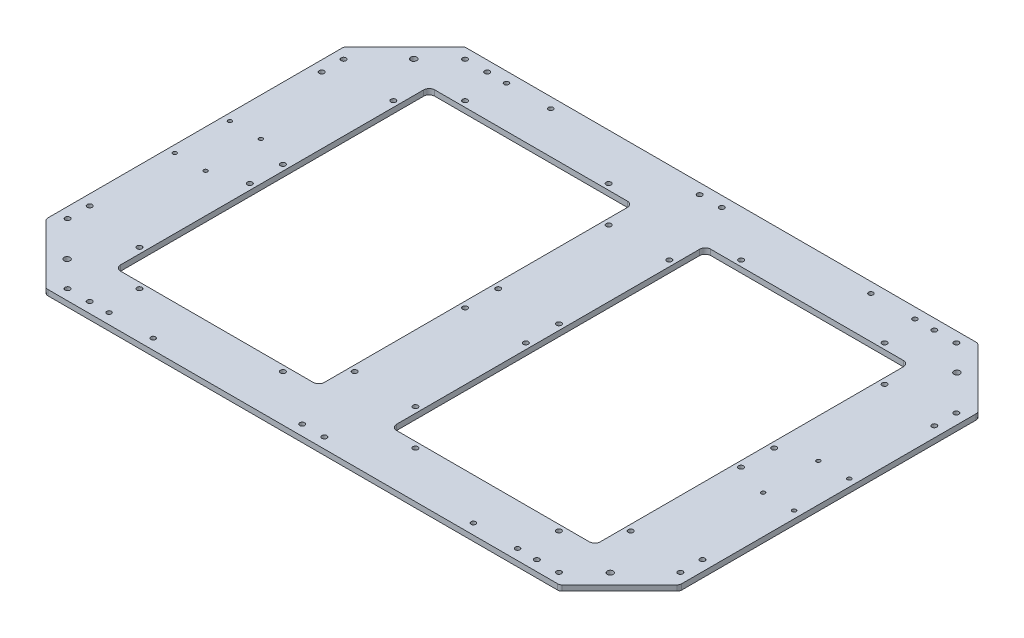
ISO-10303-21;
HEADER;
FILE_DESCRIPTION(('STEP AP214'),'2;1');
FILE_NAME('part.step','',(''),(''),'','','');
FILE_SCHEMA(('AUTOMOTIVE_DESIGN { 1 0 10303 214 1 1 1 1 }'));
ENDSEC;
DATA;
#1=APPLICATION_CONTEXT('core data for automotive mechanical design processes');
#2=APPLICATION_PROTOCOL_DEFINITION('international standard','automotive_design',2000,#1);
#3=PRODUCT_CONTEXT('',#1,'mechanical');
#4=PRODUCT('Part','Part','',(#3));
#5=PRODUCT_RELATED_PRODUCT_CATEGORY('part','',(#4));
#6=PRODUCT_DEFINITION_FORMATION('','',#4);
#7=PRODUCT_DEFINITION_CONTEXT('part definition',#1,'design');
#8=PRODUCT_DEFINITION('design','',#6,#7);
#9=PRODUCT_DEFINITION_SHAPE('','',#8);
#10=(LENGTH_UNIT() NAMED_UNIT(*) SI_UNIT(.MILLI.,.METRE.));
#11=(NAMED_UNIT(*) PLANE_ANGLE_UNIT() SI_UNIT($,.RADIAN.));
#12=(NAMED_UNIT(*) SI_UNIT($,.STERADIAN.) SOLID_ANGLE_UNIT());
#13=UNCERTAINTY_MEASURE_WITH_UNIT(LENGTH_MEASURE(1.E-05),#10,'distance_accuracy_value','');
#14=(GEOMETRIC_REPRESENTATION_CONTEXT(3) GLOBAL_UNCERTAINTY_ASSIGNED_CONTEXT((#13)) GLOBAL_UNIT_ASSIGNED_CONTEXT((#10,
#11,#12)) REPRESENTATION_CONTEXT('',''));
#15=CARTESIAN_POINT('',(0.,0.,0.));
#16=DIRECTION('',(0.,0.,1.));
#17=DIRECTION('',(1.,0.,0.));
#18=AXIS2_PLACEMENT_3D('',#15,#16,#17);
#19=CARTESIAN_POINT('',(0.,0.,0.));
#20=DIRECTION('',(0.,1.,0.));
#21=DIRECTION('',(0.,0.,1.));
#22=AXIS2_PLACEMENT_3D('',#19,#20,#21);
#23=PLANE('',#22);
#24=CARTESIAN_POINT('',(-370.,0.,360.));
#25=DIRECTION('',(0.,-1.,0.));
#26=DIRECTION('',(0.,0.,-1.));
#27=AXIS2_PLACEMENT_3D('',#24,#25,#26);
#28=CIRCLE('',#27,4.19999999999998);
#29=CARTESIAN_POINT('',(-370.,0.,355.8));
#30=VERTEX_POINT('',#29);
#31=EDGE_CURVE('E931',#30,#30,#28,.T.);
#32=ORIENTED_EDGE('',*,*,#31,.F.);
#33=EDGE_LOOP('',(#32));
#34=FACE_BOUND('',#33,.T.);
#35=CARTESIAN_POINT('',(-290.,0.,360.));
#36=DIRECTION('',(0.,-1.,0.));
#37=DIRECTION('',(0.,0.,-1.));
#38=AXIS2_PLACEMENT_3D('',#35,#36,#37);
#39=CIRCLE('',#38,4.19999999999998);
#40=CARTESIAN_POINT('',(-290.,0.,355.8));
#41=VERTEX_POINT('',#40);
#42=EDGE_CURVE('E937',#41,#41,#39,.T.);
#43=ORIENTED_EDGE('',*,*,#42,.F.);
#44=EDGE_LOOP('',(#43));
#45=FACE_BOUND('',#44,.T.);
#46=CARTESIAN_POINT('',(370.,0.,360.));
#47=DIRECTION('',(0.,-1.,0.));
#48=DIRECTION('',(0.,0.,-1.));
#49=AXIS2_PLACEMENT_3D('',#46,#47,#48);
#50=CIRCLE('',#49,4.19999999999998);
#51=CARTESIAN_POINT('',(370.,0.,355.8));
#52=VERTEX_POINT('',#51);
#53=EDGE_CURVE('E943',#52,#52,#50,.T.);
#54=ORIENTED_EDGE('',*,*,#53,.F.);
#55=EDGE_LOOP('',(#54));
#56=FACE_BOUND('',#55,.T.);
#57=CARTESIAN_POINT('',(290.,0.,360.));
#58=DIRECTION('',(0.,-1.,0.));
#59=DIRECTION('',(0.,0.,-1.));
#60=AXIS2_PLACEMENT_3D('',#57,#58,#59);
#61=CIRCLE('',#60,4.19999999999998);
#62=CARTESIAN_POINT('',(290.,0.,355.8));
#63=VERTEX_POINT('',#62);
#64=EDGE_CURVE('E949',#63,#63,#61,.T.);
#65=ORIENTED_EDGE('',*,*,#64,.F.);
#66=EDGE_LOOP('',(#65));
#67=FACE_BOUND('',#66,.T.);
#68=CARTESIAN_POINT('',(55.,0.,230.));
#69=DIRECTION('',(0.,-1.,0.));
#70=DIRECTION('',(0.,0.,-1.));
#71=AXIS2_PLACEMENT_3D('',#68,#69,#70);
#72=CIRCLE('',#71,4.5);
#73=CARTESIAN_POINT('',(55.,0.,225.5));
#74=VERTEX_POINT('',#73);
#75=EDGE_CURVE('E955',#74,#74,#72,.T.);
#76=ORIENTED_EDGE('',*,*,#75,.F.);
#77=EDGE_LOOP('',(#76));
#78=FACE_BOUND('',#77,.T.);
#79=CARTESIAN_POINT('',(120.,0.,295.));
#80=DIRECTION('',(0.,-1.,0.));
#81=DIRECTION('',(0.,0.,-1.));
#82=AXIS2_PLACEMENT_3D('',#79,#80,#81);
#83=CIRCLE('',#82,4.5);
#84=CARTESIAN_POINT('',(120.,0.,290.5));
#85=VERTEX_POINT('',#84);
#86=EDGE_CURVE('E961',#85,#85,#83,.T.);
#87=ORIENTED_EDGE('',*,*,#86,.F.);
#88=EDGE_LOOP('',(#87));
#89=FACE_BOUND('',#88,.T.);
#90=CARTESIAN_POINT('',(380.,0.,295.));
#91=DIRECTION('',(0.,-1.,0.));
#92=DIRECTION('',(0.,0.,-1.));
#93=AXIS2_PLACEMENT_3D('',#90,#91,#92);
#94=CIRCLE('',#93,4.5);
#95=CARTESIAN_POINT('',(380.,0.,290.5));
#96=VERTEX_POINT('',#95);
#97=EDGE_CURVE('E967',#96,#96,#94,.T.);
#98=ORIENTED_EDGE('',*,*,#97,.F.);
#99=EDGE_LOOP('',(#98));
#100=FACE_BOUND('',#99,.T.);
#101=CARTESIAN_POINT('',(445.,0.,230.));
#102=DIRECTION('',(0.,-1.,0.));
#103=DIRECTION('',(0.,0.,-1.));
#104=AXIS2_PLACEMENT_3D('',#101,#102,#103);
#105=CIRCLE('',#104,4.5);
#106=CARTESIAN_POINT('',(445.,0.,225.5));
#107=VERTEX_POINT('',#106);
#108=EDGE_CURVE('E973',#107,#107,#105,.T.);
#109=ORIENTED_EDGE('',*,*,#108,.F.);
#110=EDGE_LOOP('',(#109));
#111=FACE_BOUND('',#110,.T.);
#112=CARTESIAN_POINT('',(445.,0.,30.));
#113=DIRECTION('',(0.,-1.,0.));
#114=DIRECTION('',(0.,0.,-1.));
#115=AXIS2_PLACEMENT_3D('',#112,#113,#114);
#116=CIRCLE('',#115,4.5);
#117=CARTESIAN_POINT('',(445.,0.,25.5));
#118=VERTEX_POINT('',#117);
#119=EDGE_CURVE('E979',#118,#118,#116,.T.);
#120=ORIENTED_EDGE('',*,*,#119,.F.);
#121=EDGE_LOOP('',(#120));
#122=FACE_BOUND('',#121,.T.);
#123=CARTESIAN_POINT('',(445.,0.,-30.));
#124=DIRECTION('',(0.,-1.,0.));
#125=DIRECTION('',(0.,0.,-1.));
#126=AXIS2_PLACEMENT_3D('',#123,#124,#125);
#127=CIRCLE('',#126,4.5);
#128=CARTESIAN_POINT('',(445.,0.,-34.5));
#129=VERTEX_POINT('',#128);
#130=EDGE_CURVE('E985',#129,#129,#127,.T.);
#131=ORIENTED_EDGE('',*,*,#130,.F.);
#132=EDGE_LOOP('',(#131));
#133=FACE_BOUND('',#132,.T.);
#134=CARTESIAN_POINT('',(445.,0.,-230.));
#135=DIRECTION('',(0.,-1.,0.));
#136=DIRECTION('',(0.,0.,-1.));
#137=AXIS2_PLACEMENT_3D('',#134,#135,#136);
#138=CIRCLE('',#137,4.5);
#139=CARTESIAN_POINT('',(445.,0.,-234.5));
#140=VERTEX_POINT('',#139);
#141=EDGE_CURVE('E991',#140,#140,#138,.T.);
#142=ORIENTED_EDGE('',*,*,#141,.F.);
#143=EDGE_LOOP('',(#142));
#144=FACE_BOUND('',#143,.T.);
#145=CARTESIAN_POINT('',(380.,0.,-295.));
#146=DIRECTION('',(0.,-1.,0.));
#147=DIRECTION('',(0.,0.,-1.));
#148=AXIS2_PLACEMENT_3D('',#145,#146,#147);
#149=CIRCLE('',#148,4.5);
#150=CARTESIAN_POINT('',(380.,0.,-299.5));
#151=VERTEX_POINT('',#150);
#152=EDGE_CURVE('E997',#151,#151,#149,.T.);
#153=ORIENTED_EDGE('',*,*,#152,.F.);
#154=EDGE_LOOP('',(#153));
#155=FACE_BOUND('',#154,.T.);
#156=CARTESIAN_POINT('',(120.,0.,-295.));
#157=DIRECTION('',(0.,-1.,0.));
#158=DIRECTION('',(0.,0.,-1.));
#159=AXIS2_PLACEMENT_3D('',#156,#157,#158);
#160=CIRCLE('',#159,4.5);
#161=CARTESIAN_POINT('',(120.,0.,-299.5));
#162=VERTEX_POINT('',#161);
#163=EDGE_CURVE('E1003',#162,#162,#160,.T.);
#164=ORIENTED_EDGE('',*,*,#163,.F.);
#165=EDGE_LOOP('',(#164));
#166=FACE_BOUND('',#165,.T.);
#167=CARTESIAN_POINT('',(55.,0.,-230.));
#168=DIRECTION('',(0.,-1.,0.));
#169=DIRECTION('',(0.,0.,-1.));
#170=AXIS2_PLACEMENT_3D('',#167,#168,#169);
#171=CIRCLE('',#170,4.5);
#172=CARTESIAN_POINT('',(55.,0.,-234.5));
#173=VERTEX_POINT('',#172);
#174=EDGE_CURVE('E1009',#173,#173,#171,.T.);
#175=ORIENTED_EDGE('',*,*,#174,.F.);
#176=EDGE_LOOP('',(#175));
#177=FACE_BOUND('',#176,.T.);
#178=CARTESIAN_POINT('',(55.,0.,-30.));
#179=DIRECTION('',(0.,-1.,0.));
#180=DIRECTION('',(0.,0.,-1.));
#181=AXIS2_PLACEMENT_3D('',#178,#179,#180);
#182=CIRCLE('',#181,4.5);
#183=CARTESIAN_POINT('',(55.,0.,-34.5));
#184=VERTEX_POINT('',#183);
#185=EDGE_CURVE('E1015',#184,#184,#182,.T.);
#186=ORIENTED_EDGE('',*,*,#185,.F.);
#187=EDGE_LOOP('',(#186));
#188=FACE_BOUND('',#187,.T.);
#189=CARTESIAN_POINT('',(54.9999999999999,0.,30.));
#190=DIRECTION('',(0.,-1.,0.));
#191=DIRECTION('',(0.,0.,-1.));
#192=AXIS2_PLACEMENT_3D('',#189,#190,#191);
#193=CIRCLE('',#192,4.5);
#194=CARTESIAN_POINT('',(54.9999999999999,0.,25.5));
#195=VERTEX_POINT('',#194);
#196=EDGE_CURVE('E1020',#195,#195,#193,.T.);
#197=ORIENTED_EDGE('',*,*,#196,.F.);
#198=EDGE_LOOP('',(#197));
#199=FACE_BOUND('',#198,.T.);
#200=DIRECTION('',(-1.,0.,0.));
#201=VECTOR('',#200,1.);
#202=CARTESIAN_POINT('',(424.5,0.,284.5));
#203=LINE('',#202,#201);
#204=CARTESIAN_POINT('',(424.5,0.,284.5));
#205=VERTEX_POINT('',#204);
#206=CARTESIAN_POINT('',(75.5,0.,284.5));
#207=VERTEX_POINT('',#206);
#208=EDGE_CURVE('E282',#205,#207,#203,.T.);
#209=ORIENTED_EDGE('',*,*,#208,.F.);
#210=CARTESIAN_POINT('',(424.5,0.,274.5));
#211=DIRECTION('',(0.,-1.,0.));
#212=DIRECTION('',(0.,0.,1.));
#213=AXIS2_PLACEMENT_3D('',#210,#211,#212);
#214=CIRCLE('',#213,10.);
#215=CARTESIAN_POINT('',(434.5,0.,274.5));
#216=VERTEX_POINT('',#215);
#217=EDGE_CURVE('E54',#216,#205,#214,.T.);
#218=ORIENTED_EDGE('',*,*,#217,.F.);
#219=DIRECTION('',(0.,0.,1.));
#220=VECTOR('',#219,1.);
#221=CARTESIAN_POINT('',(434.5,0.,-274.5));
#222=LINE('',#221,#220);
#223=CARTESIAN_POINT('',(434.5,0.,-274.5));
#224=VERTEX_POINT('',#223);
#225=EDGE_CURVE('E259',#224,#216,#222,.T.);
#226=ORIENTED_EDGE('',*,*,#225,.F.);
#227=CARTESIAN_POINT('',(424.5,0.,-274.5));
#228=DIRECTION('',(0.,-1.,0.));
#229=DIRECTION('',(0.,0.,1.));
#230=AXIS2_PLACEMENT_3D('',#227,#228,#229);
#231=CIRCLE('',#230,10.);
#232=CARTESIAN_POINT('',(424.5,0.,-284.5));
#233=VERTEX_POINT('',#232);
#234=EDGE_CURVE('E262',#233,#224,#231,.T.);
#235=ORIENTED_EDGE('',*,*,#234,.F.);
#236=DIRECTION('',(1.,0.,0.));
#237=VECTOR('',#236,1.);
#238=CARTESIAN_POINT('',(424.5,0.,-284.5));
#239=LINE('',#238,#237);
#240=CARTESIAN_POINT('',(75.5,0.,-284.5));
#241=VERTEX_POINT('',#240);
#242=EDGE_CURVE('E293',#241,#233,#239,.T.);
#243=ORIENTED_EDGE('',*,*,#242,.F.);
#244=CARTESIAN_POINT('',(75.5,0.,-274.5));
#245=DIRECTION('',(0.,-1.,0.));
#246=DIRECTION('',(0.,0.,1.));
#247=AXIS2_PLACEMENT_3D('',#244,#245,#246);
#248=CIRCLE('',#247,9.99999999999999);
#249=CARTESIAN_POINT('',(65.5,0.,-274.5));
#250=VERTEX_POINT('',#249);
#251=EDGE_CURVE('E290',#250,#241,#248,.T.);
#252=ORIENTED_EDGE('',*,*,#251,.F.);
#253=DIRECTION('',(0.,0.,-1.));
#254=VECTOR('',#253,1.);
#255=CARTESIAN_POINT('',(65.5,0.,-274.5));
#256=LINE('',#255,#254);
#257=CARTESIAN_POINT('',(65.5,0.,274.5));
#258=VERTEX_POINT('',#257);
#259=EDGE_CURVE('E287',#258,#250,#256,.T.);
#260=ORIENTED_EDGE('',*,*,#259,.F.);
#261=CARTESIAN_POINT('',(75.5,0.,274.5));
#262=DIRECTION('',(0.,-1.,0.));
#263=DIRECTION('',(0.,0.,1.));
#264=AXIS2_PLACEMENT_3D('',#261,#262,#263);
#265=CIRCLE('',#264,9.99999999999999);
#266=EDGE_CURVE('E284',#207,#258,#265,.T.);
#267=ORIENTED_EDGE('',*,*,#266,.F.);
#268=EDGE_LOOP('',(#209,#218,#226,#235,#243,#252,#260,#267));
#269=FACE_BOUND('',#268,.T.);
#270=DIRECTION('',(1.,0.,0.));
#271=VECTOR('',#270,1.);
#272=CARTESIAN_POINT('',(-424.5,0.,-284.5));
#273=LINE('',#272,#271);
#274=CARTESIAN_POINT('',(-424.5,0.,-284.5));
#275=VERTEX_POINT('',#274);
#276=CARTESIAN_POINT('',(-75.5,0.,-284.5));
#277=VERTEX_POINT('',#276);
#278=EDGE_CURVE('E339',#275,#277,#273,.T.);
#279=ORIENTED_EDGE('',*,*,#278,.F.);
#280=CARTESIAN_POINT('',(-424.5,0.,-274.5));
#281=DIRECTION('',(0.,-1.,0.));
#282=DIRECTION('',(0.,0.,-1.));
#283=AXIS2_PLACEMENT_3D('',#280,#281,#282);
#284=CIRCLE('',#283,10.);
#285=CARTESIAN_POINT('',(-434.5,0.,-274.5));
#286=VERTEX_POINT('',#285);
#287=EDGE_CURVE('E300',#286,#275,#284,.T.);
#288=ORIENTED_EDGE('',*,*,#287,.F.);
#289=DIRECTION('',(0.,0.,-1.));
#290=VECTOR('',#289,1.);
#291=CARTESIAN_POINT('',(-434.5,0.,-274.5));
#292=LINE('',#291,#290);
#293=CARTESIAN_POINT('',(-434.5,0.,274.5));
#294=VERTEX_POINT('',#293);
#295=EDGE_CURVE('E316',#294,#286,#292,.T.);
#296=ORIENTED_EDGE('',*,*,#295,.F.);
#297=CARTESIAN_POINT('',(-424.5,0.,274.5));
#298=DIRECTION('',(0.,-1.,0.));
#299=DIRECTION('',(0.,0.,-1.));
#300=AXIS2_PLACEMENT_3D('',#297,#298,#299);
#301=CIRCLE('',#300,10.);
#302=CARTESIAN_POINT('',(-424.5,0.,284.5));
#303=VERTEX_POINT('',#302);
#304=EDGE_CURVE('E354',#303,#294,#301,.T.);
#305=ORIENTED_EDGE('',*,*,#304,.F.);
#306=DIRECTION('',(-1.,0.,0.));
#307=VECTOR('',#306,1.);
#308=CARTESIAN_POINT('',(-424.5,0.,284.5));
#309=LINE('',#308,#307);
#310=CARTESIAN_POINT('',(-75.5,0.,284.5));
#311=VERTEX_POINT('',#310);
#312=EDGE_CURVE('E351',#311,#303,#309,.T.);
#313=ORIENTED_EDGE('',*,*,#312,.F.);
#314=CARTESIAN_POINT('',(-75.5,0.,274.5));
#315=DIRECTION('',(0.,-1.,0.));
#316=DIRECTION('',(0.,0.,-1.));
#317=AXIS2_PLACEMENT_3D('',#314,#315,#316);
#318=CIRCLE('',#317,9.99999999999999);
#319=CARTESIAN_POINT('',(-65.5,0.,274.5));
#320=VERTEX_POINT('',#319);
#321=EDGE_CURVE('E348',#320,#311,#318,.T.);
#322=ORIENTED_EDGE('',*,*,#321,.F.);
#323=DIRECTION('',(0.,0.,1.));
#324=VECTOR('',#323,1.);
#325=CARTESIAN_POINT('',(-65.5,0.,-274.5));
#326=LINE('',#325,#324);
#327=CARTESIAN_POINT('',(-65.5,0.,-274.5));
#328=VERTEX_POINT('',#327);
#329=EDGE_CURVE('E345',#328,#320,#326,.T.);
#330=ORIENTED_EDGE('',*,*,#329,.F.);
#331=CARTESIAN_POINT('',(-75.5,0.,-274.5));
#332=DIRECTION('',(0.,-1.,0.));
#333=DIRECTION('',(0.,0.,-1.));
#334=AXIS2_PLACEMENT_3D('',#331,#332,#333);
#335=CIRCLE('',#334,9.99999999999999);
#336=EDGE_CURVE('E342',#277,#328,#335,.T.);
#337=ORIENTED_EDGE('',*,*,#336,.F.);
#338=EDGE_LOOP('',(#279,#288,#296,#305,#313,#322,#330,#337));
#339=FACE_BOUND('',#338,.T.);
#340=CARTESIAN_POINT('',(561.,0.,-49.9999999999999));
#341=DIRECTION('',(0.,-1.,0.));
#342=DIRECTION('',(0.,0.,-1.));
#343=AXIS2_PLACEMENT_3D('',#340,#341,#342);
#344=CIRCLE('',#343,3.49999999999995);
#345=CARTESIAN_POINT('',(561.,0.,-53.4999999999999));
#346=VERTEX_POINT('',#345);
#347=EDGE_CURVE('E361',#346,#346,#344,.T.);
#348=ORIENTED_EDGE('',*,*,#347,.F.);
#349=EDGE_LOOP('',(#348));
#350=FACE_BOUND('',#349,.T.);
#351=CARTESIAN_POINT('',(505.,0.,-50.0000000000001));
#352=DIRECTION('',(0.,-1.,0.));
#353=DIRECTION('',(0.,0.,-1.));
#354=AXIS2_PLACEMENT_3D('',#351,#352,#353);
#355=CIRCLE('',#354,3.49999999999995);
#356=CARTESIAN_POINT('',(505.,0.,-53.5));
#357=VERTEX_POINT('',#356);
#358=EDGE_CURVE('E381',#357,#357,#355,.T.);
#359=ORIENTED_EDGE('',*,*,#358,.F.);
#360=EDGE_LOOP('',(#359));
#361=FACE_BOUND('',#360,.T.);
#362=CARTESIAN_POINT('',(561.,0.,50.0000000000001));
#363=DIRECTION('',(0.,-1.,0.));
#364=DIRECTION('',(0.,0.,-1.));
#365=AXIS2_PLACEMENT_3D('',#362,#363,#364);
#366=CIRCLE('',#365,3.49999999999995);
#367=CARTESIAN_POINT('',(561.,0.,46.5000000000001));
#368=VERTEX_POINT('',#367);
#369=EDGE_CURVE('E387',#368,#368,#366,.T.);
#370=ORIENTED_EDGE('',*,*,#369,.F.);
#371=EDGE_LOOP('',(#370));
#372=FACE_BOUND('',#371,.T.);
#373=CARTESIAN_POINT('',(505.,0.,50.0000000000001));
#374=DIRECTION('',(0.,-1.,0.));
#375=DIRECTION('',(0.,0.,-1.));
#376=AXIS2_PLACEMENT_3D('',#373,#374,#375);
#377=CIRCLE('',#376,3.49999999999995);
#378=CARTESIAN_POINT('',(505.,0.,46.5000000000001));
#379=VERTEX_POINT('',#378);
#380=EDGE_CURVE('E393',#379,#379,#377,.T.);
#381=ORIENTED_EDGE('',*,*,#380,.F.);
#382=EDGE_LOOP('',(#381));
#383=FACE_BOUND('',#382,.T.);
#384=CARTESIAN_POINT('',(-505.,0.,50.0000000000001));
#385=DIRECTION('',(0.,-1.,0.));
#386=DIRECTION('',(0.,0.,-1.));
#387=AXIS2_PLACEMENT_3D('',#384,#385,#386);
#388=CIRCLE('',#387,3.49999999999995);
#389=CARTESIAN_POINT('',(-505.,0.,46.5000000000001));
#390=VERTEX_POINT('',#389);
#391=EDGE_CURVE('E399',#390,#390,#388,.T.);
#392=ORIENTED_EDGE('',*,*,#391,.F.);
#393=EDGE_LOOP('',(#392));
#394=FACE_BOUND('',#393,.T.);
#395=CARTESIAN_POINT('',(-561.,0.,50.0000000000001));
#396=DIRECTION('',(0.,-1.,0.));
#397=DIRECTION('',(0.,0.,-1.));
#398=AXIS2_PLACEMENT_3D('',#395,#396,#397);
#399=CIRCLE('',#398,3.49999999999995);
#400=CARTESIAN_POINT('',(-561.,0.,46.5000000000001));
#401=VERTEX_POINT('',#400);
#402=EDGE_CURVE('E405',#401,#401,#399,.T.);
#403=ORIENTED_EDGE('',*,*,#402,.F.);
#404=EDGE_LOOP('',(#403));
#405=FACE_BOUND('',#404,.T.);
#406=CARTESIAN_POINT('',(-505.,0.,-50.0000000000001));
#407=DIRECTION('',(0.,-1.,0.));
#408=DIRECTION('',(0.,0.,-1.));
#409=AXIS2_PLACEMENT_3D('',#406,#407,#408);
#410=CIRCLE('',#409,3.49999999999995);
#411=CARTESIAN_POINT('',(-505.,0.,-53.5));
#412=VERTEX_POINT('',#411);
#413=EDGE_CURVE('E411',#412,#412,#410,.T.);
#414=ORIENTED_EDGE('',*,*,#413,.F.);
#415=EDGE_LOOP('',(#414));
#416=FACE_BOUND('',#415,.T.);
#417=CARTESIAN_POINT('',(-561.,0.,-49.9999999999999));
#418=DIRECTION('',(0.,-1.,0.));
#419=DIRECTION('',(0.,0.,-1.));
#420=AXIS2_PLACEMENT_3D('',#417,#418,#419);
#421=CIRCLE('',#420,3.49999999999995);
#422=CARTESIAN_POINT('',(-561.,0.,-53.4999999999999));
#423=VERTEX_POINT('',#422);
#424=EDGE_CURVE('E417',#423,#423,#421,.T.);
#425=ORIENTED_EDGE('',*,*,#424,.F.);
#426=EDGE_LOOP('',(#425));
#427=FACE_BOUND('',#426,.T.);
#428=CARTESIAN_POINT('',(-492.,0.,-314.));
#429=DIRECTION('',(0.,1.,0.));
#430=DIRECTION('',(0.,0.,1.));
#431=AXIS2_PLACEMENT_3D('',#428,#429,#430);
#432=CIRCLE('',#431,5.50000000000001);
#433=CARTESIAN_POINT('',(-492.,0.,-308.5));
#434=VERTEX_POINT('',#433);
#435=EDGE_CURVE('E426',#434,#434,#432,.T.);
#436=ORIENTED_EDGE('',*,*,#435,.T.);
#437=EDGE_LOOP('',(#436));
#438=FACE_BOUND('',#437,.T.);
#439=CARTESIAN_POINT('',(492.,0.,314.));
#440=DIRECTION('',(0.,1.,0.));
#441=DIRECTION('',(0.,0.,1.));
#442=AXIS2_PLACEMENT_3D('',#439,#440,#441);
#443=CIRCLE('',#442,5.50000000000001);
#444=CARTESIAN_POINT('',(492.,0.,319.5));
#445=VERTEX_POINT('',#444);
#446=EDGE_CURVE('E432',#445,#445,#443,.T.);
#447=ORIENTED_EDGE('',*,*,#446,.T.);
#448=EDGE_LOOP('',(#447));
#449=FACE_BOUND('',#448,.T.);
#450=CARTESIAN_POINT('',(492.,0.,-314.));
#451=DIRECTION('',(0.,1.,0.));
#452=DIRECTION('',(0.,0.,1.));
#453=AXIS2_PLACEMENT_3D('',#450,#451,#452);
#454=CIRCLE('',#453,5.50000000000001);
#455=CARTESIAN_POINT('',(492.,0.,-308.5));
#456=VERTEX_POINT('',#455);
#457=EDGE_CURVE('E438',#456,#456,#454,.T.);
#458=ORIENTED_EDGE('',*,*,#457,.T.);
#459=EDGE_LOOP('',(#458));
#460=FACE_BOUND('',#459,.T.);
#461=CARTESIAN_POINT('',(-492.,0.,314.));
#462=DIRECTION('',(0.,1.,0.));
#463=DIRECTION('',(0.,0.,1.));
#464=AXIS2_PLACEMENT_3D('',#461,#462,#463);
#465=CIRCLE('',#464,5.50000000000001);
#466=CARTESIAN_POINT('',(-492.,0.,319.5));
#467=VERTEX_POINT('',#466);
#468=EDGE_CURVE('E444',#467,#467,#465,.T.);
#469=ORIENTED_EDGE('',*,*,#468,.T.);
#470=EDGE_LOOP('',(#469));
#471=FACE_BOUND('',#470,.T.);
#472=CARTESIAN_POINT('',(20.,0.,360.));
#473=DIRECTION('',(0.,1.,0.));
#474=DIRECTION('',(0.,0.,1.));
#475=AXIS2_PLACEMENT_3D('',#472,#473,#474);
#476=CIRCLE('',#475,4.5);
#477=CARTESIAN_POINT('',(20.,0.,364.5));
#478=VERTEX_POINT('',#477);
#479=EDGE_CURVE('E11',#478,#478,#476,.T.);
#480=ORIENTED_EDGE('',*,*,#479,.T.);
#481=EDGE_LOOP('',(#480));
#482=FACE_BOUND('',#481,.T.);
#483=CARTESIAN_POINT('',(-20.,0.,360.));
#484=DIRECTION('',(0.,1.,0.));
#485=DIRECTION('',(0.,0.,1.));
#486=AXIS2_PLACEMENT_3D('',#483,#484,#485);
#487=CIRCLE('',#486,4.5);
#488=CARTESIAN_POINT('',(-20.,0.,364.5));
#489=VERTEX_POINT('',#488);
#490=EDGE_CURVE('E686',#489,#489,#487,.T.);
#491=ORIENTED_EDGE('',*,*,#490,.T.);
#492=EDGE_LOOP('',(#491));
#493=FACE_BOUND('',#492,.T.);
#494=CARTESIAN_POINT('',(20.,0.,-360.));
#495=DIRECTION('',(0.,1.,0.));
#496=DIRECTION('',(0.,0.,1.));
#497=AXIS2_PLACEMENT_3D('',#494,#495,#496);
#498=CIRCLE('',#497,4.5);
#499=CARTESIAN_POINT('',(20.,0.,-355.5));
#500=VERTEX_POINT('',#499);
#501=EDGE_CURVE('E680',#500,#500,#498,.T.);
#502=ORIENTED_EDGE('',*,*,#501,.T.);
#503=EDGE_LOOP('',(#502));
#504=FACE_BOUND('',#503,.T.);
#505=CARTESIAN_POINT('',(-20.,0.,-360.));
#506=DIRECTION('',(0.,1.,0.));
#507=DIRECTION('',(0.,0.,1.));
#508=AXIS2_PLACEMENT_3D('',#505,#506,#507);
#509=CIRCLE('',#508,4.5);
#510=CARTESIAN_POINT('',(-20.,0.,-355.5));
#511=VERTEX_POINT('',#510);
#512=EDGE_CURVE('E674',#511,#511,#509,.T.);
#513=ORIENTED_EDGE('',*,*,#512,.T.);
#514=EDGE_LOOP('',(#513));
#515=FACE_BOUND('',#514,.T.);
#516=CARTESIAN_POINT('',(554.999999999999,0.,250.));
#517=DIRECTION('',(0.,1.,0.));
#518=DIRECTION('',(0.,0.,1.));
#519=AXIS2_PLACEMENT_3D('',#516,#517,#518);
#520=CIRCLE('',#519,4.49999999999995);
#521=CARTESIAN_POINT('',(554.999999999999,0.,254.5));
#522=VERTEX_POINT('',#521);
#523=EDGE_CURVE('E668',#522,#522,#520,.T.);
#524=ORIENTED_EDGE('',*,*,#523,.T.);
#525=EDGE_LOOP('',(#524));
#526=FACE_BOUND('',#525,.T.);
#527=CARTESIAN_POINT('',(554.999999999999,0.,210.));
#528=DIRECTION('',(0.,1.,0.));
#529=DIRECTION('',(0.,0.,1.));
#530=AXIS2_PLACEMENT_3D('',#527,#528,#529);
#531=CIRCLE('',#530,4.49999999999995);
#532=CARTESIAN_POINT('',(554.999999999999,0.,214.5));
#533=VERTEX_POINT('',#532);
#534=EDGE_CURVE('E662',#533,#533,#531,.T.);
#535=ORIENTED_EDGE('',*,*,#534,.T.);
#536=EDGE_LOOP('',(#535));
#537=FACE_BOUND('',#536,.T.);
#538=CARTESIAN_POINT('',(554.999999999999,0.,-210.));
#539=DIRECTION('',(0.,1.,0.));
#540=DIRECTION('',(0.,0.,1.));
#541=AXIS2_PLACEMENT_3D('',#538,#539,#540);
#542=CIRCLE('',#541,4.49999999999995);
#543=CARTESIAN_POINT('',(554.999999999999,0.,-205.5));
#544=VERTEX_POINT('',#543);
#545=EDGE_CURVE('E656',#544,#544,#542,.T.);
#546=ORIENTED_EDGE('',*,*,#545,.T.);
#547=EDGE_LOOP('',(#546));
#548=FACE_BOUND('',#547,.T.);
#549=CARTESIAN_POINT('',(554.999999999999,0.,-250.));
#550=DIRECTION('',(0.,1.,0.));
#551=DIRECTION('',(0.,0.,1.));
#552=AXIS2_PLACEMENT_3D('',#549,#550,#551);
#553=CIRCLE('',#552,4.49999999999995);
#554=CARTESIAN_POINT('',(554.999999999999,0.,-245.5));
#555=VERTEX_POINT('',#554);
#556=EDGE_CURVE('E650',#555,#555,#553,.T.);
#557=ORIENTED_EDGE('',*,*,#556,.T.);
#558=EDGE_LOOP('',(#557));
#559=FACE_BOUND('',#558,.T.);
#560=CARTESIAN_POINT('',(-554.999999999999,0.,250.));
#561=DIRECTION('',(0.,1.,0.));
#562=DIRECTION('',(0.,0.,1.));
#563=AXIS2_PLACEMENT_3D('',#560,#561,#562);
#564=CIRCLE('',#563,4.49999999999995);
#565=CARTESIAN_POINT('',(-554.999999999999,0.,254.5));
#566=VERTEX_POINT('',#565);
#567=EDGE_CURVE('E644',#566,#566,#564,.T.);
#568=ORIENTED_EDGE('',*,*,#567,.T.);
#569=EDGE_LOOP('',(#568));
#570=FACE_BOUND('',#569,.T.);
#571=CARTESIAN_POINT('',(-554.999999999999,0.,210.));
#572=DIRECTION('',(0.,1.,0.));
#573=DIRECTION('',(0.,0.,1.));
#574=AXIS2_PLACEMENT_3D('',#571,#572,#573);
#575=CIRCLE('',#574,4.49999999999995);
#576=CARTESIAN_POINT('',(-554.999999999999,0.,214.5));
#577=VERTEX_POINT('',#576);
#578=EDGE_CURVE('E638',#577,#577,#575,.T.);
#579=ORIENTED_EDGE('',*,*,#578,.T.);
#580=EDGE_LOOP('',(#579));
#581=FACE_BOUND('',#580,.T.);
#582=CARTESIAN_POINT('',(-554.999999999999,0.,-210.));
#583=DIRECTION('',(0.,1.,0.));
#584=DIRECTION('',(0.,0.,1.));
#585=AXIS2_PLACEMENT_3D('',#582,#583,#584);
#586=CIRCLE('',#585,4.49999999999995);
#587=CARTESIAN_POINT('',(-554.999999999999,0.,-205.5));
#588=VERTEX_POINT('',#587);
#589=EDGE_CURVE('E632',#588,#588,#586,.T.);
#590=ORIENTED_EDGE('',*,*,#589,.T.);
#591=EDGE_LOOP('',(#590));
#592=FACE_BOUND('',#591,.T.);
#593=CARTESIAN_POINT('',(-554.999999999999,0.,-250.));
#594=DIRECTION('',(0.,1.,0.));
#595=DIRECTION('',(0.,0.,1.));
#596=AXIS2_PLACEMENT_3D('',#593,#594,#595);
#597=CIRCLE('',#596,4.49999999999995);
#598=CARTESIAN_POINT('',(-554.999999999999,0.,-245.5));
#599=VERTEX_POINT('',#598);
#600=EDGE_CURVE('E626',#599,#599,#597,.T.);
#601=ORIENTED_EDGE('',*,*,#600,.T.);
#602=EDGE_LOOP('',(#601));
#603=FACE_BOUND('',#602,.T.);
#604=CARTESIAN_POINT('',(405.,0.,-360.));
#605=DIRECTION('',(0.,1.,0.));
#606=DIRECTION('',(0.,0.,1.));
#607=AXIS2_PLACEMENT_3D('',#604,#605,#606);
#608=CIRCLE('',#607,4.5);
#609=CARTESIAN_POINT('',(405.,0.,-355.5));
#610=VERTEX_POINT('',#609);
#611=EDGE_CURVE('E620',#610,#610,#608,.T.);
#612=ORIENTED_EDGE('',*,*,#611,.T.);
#613=EDGE_LOOP('',(#612));
#614=FACE_BOUND('',#613,.T.);
#615=CARTESIAN_POINT('',(405.,0.,360.));
#616=DIRECTION('',(0.,1.,0.));
#617=DIRECTION('',(0.,0.,1.));
#618=AXIS2_PLACEMENT_3D('',#615,#616,#617);
#619=CIRCLE('',#618,4.5);
#620=CARTESIAN_POINT('',(405.,0.,364.5));
#621=VERTEX_POINT('',#620);
#622=EDGE_CURVE('E614',#621,#621,#619,.T.);
#623=ORIENTED_EDGE('',*,*,#622,.T.);
#624=EDGE_LOOP('',(#623));
#625=FACE_BOUND('',#624,.T.);
#626=CARTESIAN_POINT('',(-405.,0.,360.));
#627=DIRECTION('',(0.,1.,0.));
#628=DIRECTION('',(0.,0.,1.));
#629=AXIS2_PLACEMENT_3D('',#626,#627,#628);
#630=CIRCLE('',#629,4.5);
#631=CARTESIAN_POINT('',(-405.,0.,364.5));
#632=VERTEX_POINT('',#631);
#633=EDGE_CURVE('E608',#632,#632,#630,.T.);
#634=ORIENTED_EDGE('',*,*,#633,.T.);
#635=EDGE_LOOP('',(#634));
#636=FACE_BOUND('',#635,.T.);
#637=CARTESIAN_POINT('',(-405.,0.,-360.));
#638=DIRECTION('',(0.,1.,0.));
#639=DIRECTION('',(0.,0.,1.));
#640=AXIS2_PLACEMENT_3D('',#637,#638,#639);
#641=CIRCLE('',#640,4.5);
#642=CARTESIAN_POINT('',(-405.,0.,-355.5));
#643=VERTEX_POINT('',#642);
#644=EDGE_CURVE('E602',#643,#643,#641,.T.);
#645=ORIENTED_EDGE('',*,*,#644,.T.);
#646=EDGE_LOOP('',(#645));
#647=FACE_BOUND('',#646,.T.);
#648=CARTESIAN_POINT('',(-445.,0.,360.));
#649=DIRECTION('',(0.,1.,0.));
#650=DIRECTION('',(0.,0.,1.));
#651=AXIS2_PLACEMENT_3D('',#648,#649,#650);
#652=CIRCLE('',#651,4.5);
#653=CARTESIAN_POINT('',(-445.,0.,364.5));
#654=VERTEX_POINT('',#653);
#655=EDGE_CURVE('E596',#654,#654,#652,.T.);
#656=ORIENTED_EDGE('',*,*,#655,.T.);
#657=EDGE_LOOP('',(#656));
#658=FACE_BOUND('',#657,.T.);
#659=CARTESIAN_POINT('',(445.,0.,-360.));
#660=DIRECTION('',(0.,1.,0.));
#661=DIRECTION('',(0.,0.,1.));
#662=AXIS2_PLACEMENT_3D('',#659,#660,#661);
#663=CIRCLE('',#662,4.5);
#664=CARTESIAN_POINT('',(445.,0.,-355.5));
#665=VERTEX_POINT('',#664);
#666=EDGE_CURVE('E590',#665,#665,#663,.T.);
#667=ORIENTED_EDGE('',*,*,#666,.T.);
#668=EDGE_LOOP('',(#667));
#669=FACE_BOUND('',#668,.T.);
#670=CARTESIAN_POINT('',(445.,0.,360.));
#671=DIRECTION('',(0.,1.,0.));
#672=DIRECTION('',(0.,0.,1.));
#673=AXIS2_PLACEMENT_3D('',#670,#671,#672);
#674=CIRCLE('',#673,4.5);
#675=CARTESIAN_POINT('',(445.,0.,364.5));
#676=VERTEX_POINT('',#675);
#677=EDGE_CURVE('E584',#676,#676,#674,.T.);
#678=ORIENTED_EDGE('',*,*,#677,.T.);
#679=EDGE_LOOP('',(#678));
#680=FACE_BOUND('',#679,.T.);
#681=CARTESIAN_POINT('',(-445.,0.,-360.));
#682=DIRECTION('',(0.,1.,0.));
#683=DIRECTION('',(0.,0.,1.));
#684=AXIS2_PLACEMENT_3D('',#681,#682,#683);
#685=CIRCLE('',#684,4.5);
#686=CARTESIAN_POINT('',(-445.,0.,-355.5));
#687=VERTEX_POINT('',#686);
#688=EDGE_CURVE('E578',#687,#687,#685,.T.);
#689=ORIENTED_EDGE('',*,*,#688,.T.);
#690=EDGE_LOOP('',(#689));
#691=FACE_BOUND('',#690,.T.);
#692=CARTESIAN_POINT('',(-461.857864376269,0.,-371.));
#693=DIRECTION('',(0.,1.,0.));
#694=DIRECTION('',(0.,0.,1.));
#695=AXIS2_PLACEMENT_3D('',#692,#693,#694);
#696=CIRCLE('',#695,8.00000000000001);
#697=CARTESIAN_POINT('',(-461.857864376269,0.,-379.));
#698=VERTEX_POINT('',#697);
#699=CARTESIAN_POINT('',(-467.514718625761,0.,-376.656854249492));
#700=VERTEX_POINT('',#699);
#701=EDGE_CURVE('E448',#698,#700,#696,.T.);
#702=ORIENTED_EDGE('',*,*,#701,.F.);
#703=DIRECTION('',(-1.,0.,0.));
#704=VECTOR('',#703,1.);
#705=CARTESIAN_POINT('',(461.857864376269,0.,-379.));
#706=LINE('',#705,#704);
#707=CARTESIAN_POINT('',(461.857864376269,0.,-379.));
#708=VERTEX_POINT('',#707);
#709=EDGE_CURVE('E493',#708,#698,#706,.T.);
#710=ORIENTED_EDGE('',*,*,#709,.F.);
#711=CARTESIAN_POINT('',(461.857864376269,0.,-371.));
#712=DIRECTION('',(0.,1.,0.));
#713=DIRECTION('',(0.,0.,1.));
#714=AXIS2_PLACEMENT_3D('',#711,#712,#713);
#715=CIRCLE('',#714,7.99999999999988);
#716=CARTESIAN_POINT('',(467.514718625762,0.,-376.656854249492));
#717=VERTEX_POINT('',#716);
#718=EDGE_CURVE('E490',#717,#708,#715,.T.);
#719=ORIENTED_EDGE('',*,*,#718,.F.);
#720=DIRECTION('',(-0.707106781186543,0.,-0.707106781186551));
#721=VECTOR('',#720,1.);
#722=CARTESIAN_POINT('',(571.656854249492,0.,-272.51471862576));
#723=LINE('',#722,#721);
#724=CARTESIAN_POINT('',(571.656854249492,0.,-272.51471862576));
#725=VERTEX_POINT('',#724);
#726=EDGE_CURVE('E487',#725,#717,#723,.T.);
#727=ORIENTED_EDGE('',*,*,#726,.F.);
#728=CARTESIAN_POINT('',(566.,0.,-266.857864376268));
#729=DIRECTION('',(0.,1.,0.));
#730=DIRECTION('',(0.,0.,1.));
#731=AXIS2_PLACEMENT_3D('',#728,#729,#730);
#732=CIRCLE('',#731,7.99999999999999);
#733=CARTESIAN_POINT('',(574.,0.,-266.857864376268));
#734=VERTEX_POINT('',#733);
#735=EDGE_CURVE('E484',#734,#725,#732,.T.);
#736=ORIENTED_EDGE('',*,*,#735,.F.);
#737=DIRECTION('',(0.,0.,-1.));
#738=VECTOR('',#737,1.);
#739=CARTESIAN_POINT('',(574.,0.,266.857864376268));
#740=LINE('',#739,#738);
#741=CARTESIAN_POINT('',(574.,0.,266.857864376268));
#742=VERTEX_POINT('',#741);
#743=EDGE_CURVE('E481',#742,#734,#740,.T.);
#744=ORIENTED_EDGE('',*,*,#743,.F.);
#745=CARTESIAN_POINT('',(566.,0.,266.857864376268));
#746=DIRECTION('',(0.,1.,0.));
#747=DIRECTION('',(0.,0.,1.));
#748=AXIS2_PLACEMENT_3D('',#745,#746,#747);
#749=CIRCLE('',#748,7.99999999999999);
#750=CARTESIAN_POINT('',(571.656854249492,0.,272.51471862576));
#751=VERTEX_POINT('',#750);
#752=EDGE_CURVE('E478',#751,#742,#749,.T.);
#753=ORIENTED_EDGE('',*,*,#752,.F.);
#754=DIRECTION('',(0.707106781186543,0.,-0.707106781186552));
#755=VECTOR('',#754,1.);
#756=CARTESIAN_POINT('',(467.514718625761,0.,376.656854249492));
#757=LINE('',#756,#755);
#758=CARTESIAN_POINT('',(467.514718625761,0.,376.656854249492));
#759=VERTEX_POINT('',#758);
#760=EDGE_CURVE('E475',#759,#751,#757,.T.);
#761=ORIENTED_EDGE('',*,*,#760,.F.);
#762=CARTESIAN_POINT('',(461.857864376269,0.,371.));
#763=DIRECTION('',(0.,1.,0.));
#764=DIRECTION('',(0.,0.,1.));
#765=AXIS2_PLACEMENT_3D('',#762,#763,#764);
#766=CIRCLE('',#765,8.00000000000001);
#767=CARTESIAN_POINT('',(461.857864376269,0.,379.));
#768=VERTEX_POINT('',#767);
#769=EDGE_CURVE('E472',#768,#759,#766,.T.);
#770=ORIENTED_EDGE('',*,*,#769,.F.);
#771=DIRECTION('',(1.,0.,0.));
#772=VECTOR('',#771,1.);
#773=CARTESIAN_POINT('',(-461.857864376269,0.,379.));
#774=LINE('',#773,#772);
#775=CARTESIAN_POINT('',(-461.857864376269,0.,379.));
#776=VERTEX_POINT('',#775);
#777=EDGE_CURVE('E469',#776,#768,#774,.T.);
#778=ORIENTED_EDGE('',*,*,#777,.F.);
#779=CARTESIAN_POINT('',(-461.857864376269,0.,371.));
#780=DIRECTION('',(0.,1.,0.));
#781=DIRECTION('',(0.,0.,1.));
#782=AXIS2_PLACEMENT_3D('',#779,#780,#781);
#783=CIRCLE('',#782,7.99999999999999);
#784=CARTESIAN_POINT('',(-467.514718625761,0.,376.656854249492));
#785=VERTEX_POINT('',#784);
#786=EDGE_CURVE('E466',#785,#776,#783,.T.);
#787=ORIENTED_EDGE('',*,*,#786,.F.);
#788=DIRECTION('',(0.707106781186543,0.,0.707106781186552));
#789=VECTOR('',#788,1.);
#790=CARTESIAN_POINT('',(-571.656854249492,0.,272.51471862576));
#791=LINE('',#790,#789);
#792=CARTESIAN_POINT('',(-571.656854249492,0.,272.51471862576));
#793=VERTEX_POINT('',#792);
#794=EDGE_CURVE('E463',#793,#785,#791,.T.);
#795=ORIENTED_EDGE('',*,*,#794,.F.);
#796=CARTESIAN_POINT('',(-566.,0.,266.857864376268));
#797=DIRECTION('',(0.,1.,0.));
#798=DIRECTION('',(0.,0.,1.));
#799=AXIS2_PLACEMENT_3D('',#796,#797,#798);
#800=CIRCLE('',#799,7.99999999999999);
#801=CARTESIAN_POINT('',(-574.,0.,266.857864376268));
#802=VERTEX_POINT('',#801);
#803=EDGE_CURVE('E460',#802,#793,#800,.T.);
#804=ORIENTED_EDGE('',*,*,#803,.F.);
#805=DIRECTION('',(0.,0.,1.));
#806=VECTOR('',#805,1.);
#807=CARTESIAN_POINT('',(-574.,0.,-266.857864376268));
#808=LINE('',#807,#806);
#809=CARTESIAN_POINT('',(-574.,0.,-266.857864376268));
#810=VERTEX_POINT('',#809);
#811=EDGE_CURVE('E457',#810,#802,#808,.T.);
#812=ORIENTED_EDGE('',*,*,#811,.F.);
#813=CARTESIAN_POINT('',(-566.,0.,-266.857864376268));
#814=DIRECTION('',(0.,1.,0.));
#815=DIRECTION('',(0.,0.,1.));
#816=AXIS2_PLACEMENT_3D('',#813,#814,#815);
#817=CIRCLE('',#816,8.00000000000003);
#818=CARTESIAN_POINT('',(-571.656854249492,0.,-272.51471862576));
#819=VERTEX_POINT('',#818);
#820=EDGE_CURVE('E454',#819,#810,#817,.T.);
#821=ORIENTED_EDGE('',*,*,#820,.F.);
#822=DIRECTION('',(-0.707106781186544,0.,0.707106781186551));
#823=VECTOR('',#822,1.);
#824=CARTESIAN_POINT('',(-467.514718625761,0.,-376.656854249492));
#825=LINE('',#824,#823);
#826=EDGE_CURVE('E450',#700,#819,#825,.T.);
#827=ORIENTED_EDGE('',*,*,#826,.F.);
#828=EDGE_LOOP('',(#702,#710,#719,#727,#736,#744,#753,#761,#770,#778,#787,#795,#804,#812,#821,#827));
#829=FACE_BOUND('',#828,.T.);
#830=CARTESIAN_POINT('',(-54.9999999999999,0.,30.));
#831=DIRECTION('',(0.,-1.,0.));
#832=DIRECTION('',(0.,0.,-1.));
#833=AXIS2_PLACEMENT_3D('',#830,#831,#832);
#834=CIRCLE('',#833,4.5);
#835=CARTESIAN_POINT('',(-54.9999999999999,0.,25.5));
#836=VERTEX_POINT('',#835);
#837=EDGE_CURVE('E805',#836,#836,#834,.T.);
#838=ORIENTED_EDGE('',*,*,#837,.F.);
#839=EDGE_LOOP('',(#838));
#840=FACE_BOUND('',#839,.T.);
#841=CARTESIAN_POINT('',(-55.,0.,-30.));
#842=DIRECTION('',(0.,-1.,0.));
#843=DIRECTION('',(0.,0.,-1.));
#844=AXIS2_PLACEMENT_3D('',#841,#842,#843);
#845=CIRCLE('',#844,4.5);
#846=CARTESIAN_POINT('',(-55.,0.,-34.5));
#847=VERTEX_POINT('',#846);
#848=EDGE_CURVE('E809',#847,#847,#845,.T.);
#849=ORIENTED_EDGE('',*,*,#848,.F.);
#850=EDGE_LOOP('',(#849));
#851=FACE_BOUND('',#850,.T.);
#852=CARTESIAN_POINT('',(-55.,0.,-230.));
#853=DIRECTION('',(0.,-1.,0.));
#854=DIRECTION('',(0.,0.,-1.));
#855=AXIS2_PLACEMENT_3D('',#852,#853,#854);
#856=CIRCLE('',#855,4.5);
#857=CARTESIAN_POINT('',(-55.,0.,-234.5));
#858=VERTEX_POINT('',#857);
#859=EDGE_CURVE('E813',#858,#858,#856,.T.);
#860=ORIENTED_EDGE('',*,*,#859,.F.);
#861=EDGE_LOOP('',(#860));
#862=FACE_BOUND('',#861,.T.);
#863=CARTESIAN_POINT('',(-120.,0.,-295.));
#864=DIRECTION('',(0.,-1.,0.));
#865=DIRECTION('',(0.,0.,-1.));
#866=AXIS2_PLACEMENT_3D('',#863,#864,#865);
#867=CIRCLE('',#866,4.5);
#868=CARTESIAN_POINT('',(-120.,0.,-299.5));
#869=VERTEX_POINT('',#868);
#870=EDGE_CURVE('E817',#869,#869,#867,.T.);
#871=ORIENTED_EDGE('',*,*,#870,.F.);
#872=EDGE_LOOP('',(#871));
#873=FACE_BOUND('',#872,.T.);
#874=CARTESIAN_POINT('',(-380.,0.,-295.));
#875=DIRECTION('',(0.,-1.,0.));
#876=DIRECTION('',(0.,0.,-1.));
#877=AXIS2_PLACEMENT_3D('',#874,#875,#876);
#878=CIRCLE('',#877,4.5);
#879=CARTESIAN_POINT('',(-380.,0.,-299.5));
#880=VERTEX_POINT('',#879);
#881=EDGE_CURVE('E821',#880,#880,#878,.T.);
#882=ORIENTED_EDGE('',*,*,#881,.F.);
#883=EDGE_LOOP('',(#882));
#884=FACE_BOUND('',#883,.T.);
#885=CARTESIAN_POINT('',(-445.,0.,-230.));
#886=DIRECTION('',(0.,-1.,0.));
#887=DIRECTION('',(0.,0.,-1.));
#888=AXIS2_PLACEMENT_3D('',#885,#886,#887);
#889=CIRCLE('',#888,4.5);
#890=CARTESIAN_POINT('',(-445.,0.,-234.5));
#891=VERTEX_POINT('',#890);
#892=EDGE_CURVE('E825',#891,#891,#889,.T.);
#893=ORIENTED_EDGE('',*,*,#892,.F.);
#894=EDGE_LOOP('',(#893));
#895=FACE_BOUND('',#894,.T.);
#896=CARTESIAN_POINT('',(-445.,0.,-30.));
#897=DIRECTION('',(0.,-1.,0.));
#898=DIRECTION('',(0.,0.,-1.));
#899=AXIS2_PLACEMENT_3D('',#896,#897,#898);
#900=CIRCLE('',#899,4.5);
#901=CARTESIAN_POINT('',(-445.,0.,-34.5));
#902=VERTEX_POINT('',#901);
#903=EDGE_CURVE('E829',#902,#902,#900,.T.);
#904=ORIENTED_EDGE('',*,*,#903,.F.);
#905=EDGE_LOOP('',(#904));
#906=FACE_BOUND('',#905,.T.);
#907=CARTESIAN_POINT('',(-445.,0.,30.));
#908=DIRECTION('',(0.,-1.,0.));
#909=DIRECTION('',(0.,0.,-1.));
#910=AXIS2_PLACEMENT_3D('',#907,#908,#909);
#911=CIRCLE('',#910,4.5);
#912=CARTESIAN_POINT('',(-445.,0.,25.5));
#913=VERTEX_POINT('',#912);
#914=EDGE_CURVE('E833',#913,#913,#911,.T.);
#915=ORIENTED_EDGE('',*,*,#914,.F.);
#916=EDGE_LOOP('',(#915));
#917=FACE_BOUND('',#916,.T.);
#918=CARTESIAN_POINT('',(-445.,0.,230.));
#919=DIRECTION('',(0.,-1.,0.));
#920=DIRECTION('',(0.,0.,-1.));
#921=AXIS2_PLACEMENT_3D('',#918,#919,#920);
#922=CIRCLE('',#921,4.5);
#923=CARTESIAN_POINT('',(-445.,0.,225.5));
#924=VERTEX_POINT('',#923);
#925=EDGE_CURVE('E837',#924,#924,#922,.T.);
#926=ORIENTED_EDGE('',*,*,#925,.F.);
#927=EDGE_LOOP('',(#926));
#928=FACE_BOUND('',#927,.T.);
#929=CARTESIAN_POINT('',(-380.,0.,295.));
#930=DIRECTION('',(0.,-1.,0.));
#931=DIRECTION('',(0.,0.,-1.));
#932=AXIS2_PLACEMENT_3D('',#929,#930,#931);
#933=CIRCLE('',#932,4.5);
#934=CARTESIAN_POINT('',(-380.,0.,290.5));
#935=VERTEX_POINT('',#934);
#936=EDGE_CURVE('E841',#935,#935,#933,.T.);
#937=ORIENTED_EDGE('',*,*,#936,.F.);
#938=EDGE_LOOP('',(#937));
#939=FACE_BOUND('',#938,.T.);
#940=CARTESIAN_POINT('',(-120.,0.,295.));
#941=DIRECTION('',(0.,-1.,0.));
#942=DIRECTION('',(0.,0.,-1.));
#943=AXIS2_PLACEMENT_3D('',#940,#941,#942);
#944=CIRCLE('',#943,4.5);
#945=CARTESIAN_POINT('',(-120.,0.,290.5));
#946=VERTEX_POINT('',#945);
#947=EDGE_CURVE('E845',#946,#946,#944,.T.);
#948=ORIENTED_EDGE('',*,*,#947,.F.);
#949=EDGE_LOOP('',(#948));
#950=FACE_BOUND('',#949,.T.);
#951=CARTESIAN_POINT('',(-55.,0.,230.));
#952=DIRECTION('',(0.,-1.,0.));
#953=DIRECTION('',(0.,0.,-1.));
#954=AXIS2_PLACEMENT_3D('',#951,#952,#953);
#955=CIRCLE('',#954,4.5);
#956=CARTESIAN_POINT('',(-55.,0.,225.5));
#957=VERTEX_POINT('',#956);
#958=EDGE_CURVE('E849',#957,#957,#955,.T.);
#959=ORIENTED_EDGE('',*,*,#958,.F.);
#960=EDGE_LOOP('',(#959));
#961=FACE_BOUND('',#960,.T.);
#962=CARTESIAN_POINT('',(290.,0.,-360.));
#963=DIRECTION('',(0.,-1.,0.));
#964=DIRECTION('',(0.,0.,-1.));
#965=AXIS2_PLACEMENT_3D('',#962,#963,#964);
#966=CIRCLE('',#965,4.19999999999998);
#967=CARTESIAN_POINT('',(290.,0.,-364.2));
#968=VERTEX_POINT('',#967);
#969=EDGE_CURVE('E853',#968,#968,#966,.T.);
#970=ORIENTED_EDGE('',*,*,#969,.F.);
#971=EDGE_LOOP('',(#970));
#972=FACE_BOUND('',#971,.T.);
#973=CARTESIAN_POINT('',(370.,0.,-360.));
#974=DIRECTION('',(0.,-1.,0.));
#975=DIRECTION('',(0.,0.,-1.));
#976=AXIS2_PLACEMENT_3D('',#973,#974,#975);
#977=CIRCLE('',#976,4.19999999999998);
#978=CARTESIAN_POINT('',(370.,0.,-364.2));
#979=VERTEX_POINT('',#978);
#980=EDGE_CURVE('E857',#979,#979,#977,.T.);
#981=ORIENTED_EDGE('',*,*,#980,.F.);
#982=EDGE_LOOP('',(#981));
#983=FACE_BOUND('',#982,.T.);
#984=CARTESIAN_POINT('',(-290.,0.,-360.));
#985=DIRECTION('',(0.,-1.,0.));
#986=DIRECTION('',(0.,0.,-1.));
#987=AXIS2_PLACEMENT_3D('',#984,#985,#986);
#988=CIRCLE('',#987,4.19999999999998);
#989=CARTESIAN_POINT('',(-290.,0.,-364.2));
#990=VERTEX_POINT('',#989);
#991=EDGE_CURVE('E861',#990,#990,#988,.T.);
#992=ORIENTED_EDGE('',*,*,#991,.F.);
#993=EDGE_LOOP('',(#992));
#994=FACE_BOUND('',#993,.T.);
#995=CARTESIAN_POINT('',(-370.,0.,-360.));
#996=DIRECTION('',(0.,-1.,0.));
#997=DIRECTION('',(0.,0.,-1.));
#998=AXIS2_PLACEMENT_3D('',#995,#996,#997);
#999=CIRCLE('',#998,4.19999999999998);
#1000=CARTESIAN_POINT('',(-370.,0.,-364.2));
#1001=VERTEX_POINT('',#1000);
#1002=EDGE_CURVE('E864',#1001,#1001,#999,.T.);
#1003=ORIENTED_EDGE('',*,*,#1002,.F.);
#1004=EDGE_LOOP('',(#1003));
#1005=FACE_BOUND('',#1004,.T.);
#1006=ADVANCED_FACE('F32',(#34,#45,#56,#67,#78,#89,#100,#111,#122,#133,#144,#155,#166,#177,#188,
#199,#269,#339,#350,#361,#372,#383,#394,#405,#416,#427,#438,#449,#460,#471,#482,#493,#504,#515,
#526,#537,#548,#559,#570,#581,#592,#603,#614,#625,#636,#647,#658,#669,#680,#691,#829,#840,#851,
#862,#873,#884,#895,#906,#917,#928,#939,#950,#961,#972,#983,#994,#1005),#23,.F.);
#1007=CARTESIAN_POINT('',(0.,10.,0.));
#1008=DIRECTION('',(0.,1.,0.));
#1009=DIRECTION('',(0.,0.,1.));
#1010=AXIS2_PLACEMENT_3D('',#1007,#1008,#1009);
#1011=PLANE('',#1010);
#1012=CARTESIAN_POINT('',(-370.,10.,-360.));
#1013=DIRECTION('',(0.,-1.,0.));
#1014=DIRECTION('',(0.,0.,-1.));
#1015=AXIS2_PLACEMENT_3D('',#1012,#1013,#1014);
#1016=CIRCLE('',#1015,4.19999999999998);
#1017=CARTESIAN_POINT('',(-370.,10.,-364.2));
#1018=VERTEX_POINT('',#1017);
#1019=EDGE_CURVE('E866',#1018,#1018,#1016,.T.);
#1020=ORIENTED_EDGE('',*,*,#1019,.T.);
#1021=EDGE_LOOP('',(#1020));
#1022=FACE_BOUND('',#1021,.T.);
#1023=CARTESIAN_POINT('',(-290.,10.,-360.));
#1024=DIRECTION('',(0.,-1.,0.));
#1025=DIRECTION('',(0.,0.,-1.));
#1026=AXIS2_PLACEMENT_3D('',#1023,#1024,#1025);
#1027=CIRCLE('',#1026,4.19999999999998);
#1028=CARTESIAN_POINT('',(-290.,10.,-364.2));
#1029=VERTEX_POINT('',#1028);
#1030=EDGE_CURVE('E872',#1029,#1029,#1027,.T.);
#1031=ORIENTED_EDGE('',*,*,#1030,.T.);
#1032=EDGE_LOOP('',(#1031));
#1033=FACE_BOUND('',#1032,.T.);
#1034=CARTESIAN_POINT('',(370.,10.,-360.));
#1035=DIRECTION('',(0.,-1.,0.));
#1036=DIRECTION('',(0.,0.,-1.));
#1037=AXIS2_PLACEMENT_3D('',#1034,#1035,#1036);
#1038=CIRCLE('',#1037,4.19999999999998);
#1039=CARTESIAN_POINT('',(370.,10.,-364.2));
#1040=VERTEX_POINT('',#1039);
#1041=EDGE_CURVE('E876',#1040,#1040,#1038,.T.);
#1042=ORIENTED_EDGE('',*,*,#1041,.T.);
#1043=EDGE_LOOP('',(#1042));
#1044=FACE_BOUND('',#1043,.T.);
#1045=CARTESIAN_POINT('',(290.,10.,-360.));
#1046=DIRECTION('',(0.,-1.,0.));
#1047=DIRECTION('',(0.,0.,-1.));
#1048=AXIS2_PLACEMENT_3D('',#1045,#1046,#1047);
#1049=CIRCLE('',#1048,4.19999999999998);
#1050=CARTESIAN_POINT('',(290.,10.,-364.2));
#1051=VERTEX_POINT('',#1050);
#1052=EDGE_CURVE('E880',#1051,#1051,#1049,.T.);
#1053=ORIENTED_EDGE('',*,*,#1052,.T.);
#1054=EDGE_LOOP('',(#1053));
#1055=FACE_BOUND('',#1054,.T.);
#1056=CARTESIAN_POINT('',(-55.,10.,230.));
#1057=DIRECTION('',(0.,-1.,0.));
#1058=DIRECTION('',(0.,0.,-1.));
#1059=AXIS2_PLACEMENT_3D('',#1056,#1057,#1058);
#1060=CIRCLE('',#1059,4.5);
#1061=CARTESIAN_POINT('',(-55.,10.,225.5));
#1062=VERTEX_POINT('',#1061);
#1063=EDGE_CURVE('E884',#1062,#1062,#1060,.T.);
#1064=ORIENTED_EDGE('',*,*,#1063,.T.);
#1065=EDGE_LOOP('',(#1064));
#1066=FACE_BOUND('',#1065,.T.);
#1067=CARTESIAN_POINT('',(-120.,10.,295.));
#1068=DIRECTION('',(0.,-1.,0.));
#1069=DIRECTION('',(0.,0.,-1.));
#1070=AXIS2_PLACEMENT_3D('',#1067,#1068,#1069);
#1071=CIRCLE('',#1070,4.5);
#1072=CARTESIAN_POINT('',(-120.,10.,290.5));
#1073=VERTEX_POINT('',#1072);
#1074=EDGE_CURVE('E888',#1073,#1073,#1071,.T.);
#1075=ORIENTED_EDGE('',*,*,#1074,.T.);
#1076=EDGE_LOOP('',(#1075));
#1077=FACE_BOUND('',#1076,.T.);
#1078=CARTESIAN_POINT('',(-380.,10.,295.));
#1079=DIRECTION('',(0.,-1.,0.));
#1080=DIRECTION('',(0.,0.,-1.));
#1081=AXIS2_PLACEMENT_3D('',#1078,#1079,#1080);
#1082=CIRCLE('',#1081,4.5);
#1083=CARTESIAN_POINT('',(-380.,10.,290.5));
#1084=VERTEX_POINT('',#1083);
#1085=EDGE_CURVE('E892',#1084,#1084,#1082,.T.);
#1086=ORIENTED_EDGE('',*,*,#1085,.T.);
#1087=EDGE_LOOP('',(#1086));
#1088=FACE_BOUND('',#1087,.T.);
#1089=CARTESIAN_POINT('',(-445.,10.,230.));
#1090=DIRECTION('',(0.,-1.,0.));
#1091=DIRECTION('',(0.,0.,-1.));
#1092=AXIS2_PLACEMENT_3D('',#1089,#1090,#1091);
#1093=CIRCLE('',#1092,4.5);
#1094=CARTESIAN_POINT('',(-445.,10.,225.5));
#1095=VERTEX_POINT('',#1094);
#1096=EDGE_CURVE('E896',#1095,#1095,#1093,.T.);
#1097=ORIENTED_EDGE('',*,*,#1096,.T.);
#1098=EDGE_LOOP('',(#1097));
#1099=FACE_BOUND('',#1098,.T.);
#1100=CARTESIAN_POINT('',(-445.,10.,30.));
#1101=DIRECTION('',(0.,-1.,0.));
#1102=DIRECTION('',(0.,0.,-1.));
#1103=AXIS2_PLACEMENT_3D('',#1100,#1101,#1102);
#1104=CIRCLE('',#1103,4.5);
#1105=CARTESIAN_POINT('',(-445.,10.,25.5));
#1106=VERTEX_POINT('',#1105);
#1107=EDGE_CURVE('E900',#1106,#1106,#1104,.T.);
#1108=ORIENTED_EDGE('',*,*,#1107,.T.);
#1109=EDGE_LOOP('',(#1108));
#1110=FACE_BOUND('',#1109,.T.);
#1111=CARTESIAN_POINT('',(-445.,10.,-30.));
#1112=DIRECTION('',(0.,-1.,0.));
#1113=DIRECTION('',(0.,0.,-1.));
#1114=AXIS2_PLACEMENT_3D('',#1111,#1112,#1113);
#1115=CIRCLE('',#1114,4.5);
#1116=CARTESIAN_POINT('',(-445.,10.,-34.5));
#1117=VERTEX_POINT('',#1116);
#1118=EDGE_CURVE('E904',#1117,#1117,#1115,.T.);
#1119=ORIENTED_EDGE('',*,*,#1118,.T.);
#1120=EDGE_LOOP('',(#1119));
#1121=FACE_BOUND('',#1120,.T.);
#1122=CARTESIAN_POINT('',(-445.,10.,-230.));
#1123=DIRECTION('',(0.,-1.,0.));
#1124=DIRECTION('',(0.,0.,-1.));
#1125=AXIS2_PLACEMENT_3D('',#1122,#1123,#1124);
#1126=CIRCLE('',#1125,4.5);
#1127=CARTESIAN_POINT('',(-445.,10.,-234.5));
#1128=VERTEX_POINT('',#1127);
#1129=EDGE_CURVE('E908',#1128,#1128,#1126,.T.);
#1130=ORIENTED_EDGE('',*,*,#1129,.T.);
#1131=EDGE_LOOP('',(#1130));
#1132=FACE_BOUND('',#1131,.T.);
#1133=CARTESIAN_POINT('',(-380.,10.,-295.));
#1134=DIRECTION('',(0.,-1.,0.));
#1135=DIRECTION('',(0.,0.,-1.));
#1136=AXIS2_PLACEMENT_3D('',#1133,#1134,#1135);
#1137=CIRCLE('',#1136,4.5);
#1138=CARTESIAN_POINT('',(-380.,10.,-299.5));
#1139=VERTEX_POINT('',#1138);
#1140=EDGE_CURVE('E912',#1139,#1139,#1137,.T.);
#1141=ORIENTED_EDGE('',*,*,#1140,.T.);
#1142=EDGE_LOOP('',(#1141));
#1143=FACE_BOUND('',#1142,.T.);
#1144=CARTESIAN_POINT('',(-120.,10.,-295.));
#1145=DIRECTION('',(0.,-1.,0.));
#1146=DIRECTION('',(0.,0.,-1.));
#1147=AXIS2_PLACEMENT_3D('',#1144,#1145,#1146);
#1148=CIRCLE('',#1147,4.5);
#1149=CARTESIAN_POINT('',(-120.,10.,-299.5));
#1150=VERTEX_POINT('',#1149);
#1151=EDGE_CURVE('E916',#1150,#1150,#1148,.T.);
#1152=ORIENTED_EDGE('',*,*,#1151,.T.);
#1153=EDGE_LOOP('',(#1152));
#1154=FACE_BOUND('',#1153,.T.);
#1155=CARTESIAN_POINT('',(-55.,10.,-230.));
#1156=DIRECTION('',(0.,-1.,0.));
#1157=DIRECTION('',(0.,0.,-1.));
#1158=AXIS2_PLACEMENT_3D('',#1155,#1156,#1157);
#1159=CIRCLE('',#1158,4.5);
#1160=CARTESIAN_POINT('',(-55.,10.,-234.5));
#1161=VERTEX_POINT('',#1160);
#1162=EDGE_CURVE('E920',#1161,#1161,#1159,.T.);
#1163=ORIENTED_EDGE('',*,*,#1162,.T.);
#1164=EDGE_LOOP('',(#1163));
#1165=FACE_BOUND('',#1164,.T.);
#1166=CARTESIAN_POINT('',(-55.,10.,-30.));
#1167=DIRECTION('',(0.,-1.,0.));
#1168=DIRECTION('',(0.,0.,-1.));
#1169=AXIS2_PLACEMENT_3D('',#1166,#1167,#1168);
#1170=CIRCLE('',#1169,4.5);
#1171=CARTESIAN_POINT('',(-55.,10.,-34.5));
#1172=VERTEX_POINT('',#1171);
#1173=EDGE_CURVE('E924',#1172,#1172,#1170,.T.);
#1174=ORIENTED_EDGE('',*,*,#1173,.T.);
#1175=EDGE_LOOP('',(#1174));
#1176=FACE_BOUND('',#1175,.T.);
#1177=CARTESIAN_POINT('',(-54.9999999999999,10.,30.));
#1178=DIRECTION('',(0.,-1.,0.));
#1179=DIRECTION('',(0.,0.,-1.));
#1180=AXIS2_PLACEMENT_3D('',#1177,#1178,#1179);
#1181=CIRCLE('',#1180,4.5);
#1182=CARTESIAN_POINT('',(-54.9999999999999,10.,25.5));
#1183=VERTEX_POINT('',#1182);
#1184=EDGE_CURVE('E928',#1183,#1183,#1181,.T.);
#1185=ORIENTED_EDGE('',*,*,#1184,.T.);
#1186=EDGE_LOOP('',(#1185));
#1187=FACE_BOUND('',#1186,.T.);
#1188=CARTESIAN_POINT('',(-370.,10.,360.));
#1189=DIRECTION('',(0.,-1.,0.));
#1190=DIRECTION('',(0.,0.,-1.));
#1191=AXIS2_PLACEMENT_3D('',#1188,#1189,#1190);
#1192=CIRCLE('',#1191,4.19999999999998);
#1193=CARTESIAN_POINT('',(-370.,10.,355.8));
#1194=VERTEX_POINT('',#1193);
#1195=EDGE_CURVE('E934',#1194,#1194,#1192,.T.);
#1196=ORIENTED_EDGE('',*,*,#1195,.T.);
#1197=EDGE_LOOP('',(#1196));
#1198=FACE_BOUND('',#1197,.T.);
#1199=CARTESIAN_POINT('',(-290.,10.,360.));
#1200=DIRECTION('',(0.,-1.,0.));
#1201=DIRECTION('',(0.,0.,-1.));
#1202=AXIS2_PLACEMENT_3D('',#1199,#1200,#1201);
#1203=CIRCLE('',#1202,4.19999999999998);
#1204=CARTESIAN_POINT('',(-290.,10.,355.8));
#1205=VERTEX_POINT('',#1204);
#1206=EDGE_CURVE('E940',#1205,#1205,#1203,.T.);
#1207=ORIENTED_EDGE('',*,*,#1206,.T.);
#1208=EDGE_LOOP('',(#1207));
#1209=FACE_BOUND('',#1208,.T.);
#1210=CARTESIAN_POINT('',(370.,10.,360.));
#1211=DIRECTION('',(0.,-1.,0.));
#1212=DIRECTION('',(0.,0.,-1.));
#1213=AXIS2_PLACEMENT_3D('',#1210,#1211,#1212);
#1214=CIRCLE('',#1213,4.19999999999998);
#1215=CARTESIAN_POINT('',(370.,10.,355.8));
#1216=VERTEX_POINT('',#1215);
#1217=EDGE_CURVE('E946',#1216,#1216,#1214,.T.);
#1218=ORIENTED_EDGE('',*,*,#1217,.T.);
#1219=EDGE_LOOP('',(#1218));
#1220=FACE_BOUND('',#1219,.T.);
#1221=CARTESIAN_POINT('',(290.,10.,360.));
#1222=DIRECTION('',(0.,-1.,0.));
#1223=DIRECTION('',(0.,0.,-1.));
#1224=AXIS2_PLACEMENT_3D('',#1221,#1222,#1223);
#1225=CIRCLE('',#1224,4.19999999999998);
#1226=CARTESIAN_POINT('',(290.,10.,355.8));
#1227=VERTEX_POINT('',#1226);
#1228=EDGE_CURVE('E952',#1227,#1227,#1225,.T.);
#1229=ORIENTED_EDGE('',*,*,#1228,.T.);
#1230=EDGE_LOOP('',(#1229));
#1231=FACE_BOUND('',#1230,.T.);
#1232=CARTESIAN_POINT('',(55.,10.,230.));
#1233=DIRECTION('',(0.,-1.,0.));
#1234=DIRECTION('',(0.,0.,-1.));
#1235=AXIS2_PLACEMENT_3D('',#1232,#1233,#1234);
#1236=CIRCLE('',#1235,4.5);
#1237=CARTESIAN_POINT('',(55.,10.,225.5));
#1238=VERTEX_POINT('',#1237);
#1239=EDGE_CURVE('E958',#1238,#1238,#1236,.T.);
#1240=ORIENTED_EDGE('',*,*,#1239,.T.);
#1241=EDGE_LOOP('',(#1240));
#1242=FACE_BOUND('',#1241,.T.);
#1243=CARTESIAN_POINT('',(120.,10.,295.));
#1244=DIRECTION('',(0.,-1.,0.));
#1245=DIRECTION('',(0.,0.,-1.));
#1246=AXIS2_PLACEMENT_3D('',#1243,#1244,#1245);
#1247=CIRCLE('',#1246,4.5);
#1248=CARTESIAN_POINT('',(120.,10.,290.5));
#1249=VERTEX_POINT('',#1248);
#1250=EDGE_CURVE('E964',#1249,#1249,#1247,.T.);
#1251=ORIENTED_EDGE('',*,*,#1250,.T.);
#1252=EDGE_LOOP('',(#1251));
#1253=FACE_BOUND('',#1252,.T.);
#1254=CARTESIAN_POINT('',(380.,10.,295.));
#1255=DIRECTION('',(0.,-1.,0.));
#1256=DIRECTION('',(0.,0.,-1.));
#1257=AXIS2_PLACEMENT_3D('',#1254,#1255,#1256);
#1258=CIRCLE('',#1257,4.5);
#1259=CARTESIAN_POINT('',(380.,10.,290.5));
#1260=VERTEX_POINT('',#1259);
#1261=EDGE_CURVE('E970',#1260,#1260,#1258,.T.);
#1262=ORIENTED_EDGE('',*,*,#1261,.T.);
#1263=EDGE_LOOP('',(#1262));
#1264=FACE_BOUND('',#1263,.T.);
#1265=CARTESIAN_POINT('',(445.,10.,230.));
#1266=DIRECTION('',(0.,-1.,0.));
#1267=DIRECTION('',(0.,0.,-1.));
#1268=AXIS2_PLACEMENT_3D('',#1265,#1266,#1267);
#1269=CIRCLE('',#1268,4.5);
#1270=CARTESIAN_POINT('',(445.,10.,225.5));
#1271=VERTEX_POINT('',#1270);
#1272=EDGE_CURVE('E976',#1271,#1271,#1269,.T.);
#1273=ORIENTED_EDGE('',*,*,#1272,.T.);
#1274=EDGE_LOOP('',(#1273));
#1275=FACE_BOUND('',#1274,.T.);
#1276=CARTESIAN_POINT('',(445.,10.,30.));
#1277=DIRECTION('',(0.,-1.,0.));
#1278=DIRECTION('',(0.,0.,-1.));
#1279=AXIS2_PLACEMENT_3D('',#1276,#1277,#1278);
#1280=CIRCLE('',#1279,4.5);
#1281=CARTESIAN_POINT('',(445.,10.,25.5));
#1282=VERTEX_POINT('',#1281);
#1283=EDGE_CURVE('E982',#1282,#1282,#1280,.T.);
#1284=ORIENTED_EDGE('',*,*,#1283,.T.);
#1285=EDGE_LOOP('',(#1284));
#1286=FACE_BOUND('',#1285,.T.);
#1287=CARTESIAN_POINT('',(445.,10.,-30.));
#1288=DIRECTION('',(0.,-1.,0.));
#1289=DIRECTION('',(0.,0.,-1.));
#1290=AXIS2_PLACEMENT_3D('',#1287,#1288,#1289);
#1291=CIRCLE('',#1290,4.5);
#1292=CARTESIAN_POINT('',(445.,10.,-34.5));
#1293=VERTEX_POINT('',#1292);
#1294=EDGE_CURVE('E988',#1293,#1293,#1291,.T.);
#1295=ORIENTED_EDGE('',*,*,#1294,.T.);
#1296=EDGE_LOOP('',(#1295));
#1297=FACE_BOUND('',#1296,.T.);
#1298=CARTESIAN_POINT('',(445.,10.,-230.));
#1299=DIRECTION('',(0.,-1.,0.));
#1300=DIRECTION('',(0.,0.,-1.));
#1301=AXIS2_PLACEMENT_3D('',#1298,#1299,#1300);
#1302=CIRCLE('',#1301,4.5);
#1303=CARTESIAN_POINT('',(445.,10.,-234.5));
#1304=VERTEX_POINT('',#1303);
#1305=EDGE_CURVE('E994',#1304,#1304,#1302,.T.);
#1306=ORIENTED_EDGE('',*,*,#1305,.T.);
#1307=EDGE_LOOP('',(#1306));
#1308=FACE_BOUND('',#1307,.T.);
#1309=CARTESIAN_POINT('',(380.,10.,-295.));
#1310=DIRECTION('',(0.,-1.,0.));
#1311=DIRECTION('',(0.,0.,-1.));
#1312=AXIS2_PLACEMENT_3D('',#1309,#1310,#1311);
#1313=CIRCLE('',#1312,4.5);
#1314=CARTESIAN_POINT('',(380.,10.,-299.5));
#1315=VERTEX_POINT('',#1314);
#1316=EDGE_CURVE('E1000',#1315,#1315,#1313,.T.);
#1317=ORIENTED_EDGE('',*,*,#1316,.T.);
#1318=EDGE_LOOP('',(#1317));
#1319=FACE_BOUND('',#1318,.T.);
#1320=CARTESIAN_POINT('',(120.,10.,-295.));
#1321=DIRECTION('',(0.,-1.,0.));
#1322=DIRECTION('',(0.,0.,-1.));
#1323=AXIS2_PLACEMENT_3D('',#1320,#1321,#1322);
#1324=CIRCLE('',#1323,4.5);
#1325=CARTESIAN_POINT('',(120.,10.,-299.5));
#1326=VERTEX_POINT('',#1325);
#1327=EDGE_CURVE('E1006',#1326,#1326,#1324,.T.);
#1328=ORIENTED_EDGE('',*,*,#1327,.T.);
#1329=EDGE_LOOP('',(#1328));
#1330=FACE_BOUND('',#1329,.T.);
#1331=CARTESIAN_POINT('',(55.,10.,-230.));
#1332=DIRECTION('',(0.,-1.,0.));
#1333=DIRECTION('',(0.,0.,-1.));
#1334=AXIS2_PLACEMENT_3D('',#1331,#1332,#1333);
#1335=CIRCLE('',#1334,4.5);
#1336=CARTESIAN_POINT('',(55.,10.,-234.5));
#1337=VERTEX_POINT('',#1336);
#1338=EDGE_CURVE('E1012',#1337,#1337,#1335,.T.);
#1339=ORIENTED_EDGE('',*,*,#1338,.T.);
#1340=EDGE_LOOP('',(#1339));
#1341=FACE_BOUND('',#1340,.T.);
#1342=CARTESIAN_POINT('',(55.,10.,-30.));
#1343=DIRECTION('',(0.,-1.,0.));
#1344=DIRECTION('',(0.,0.,-1.));
#1345=AXIS2_PLACEMENT_3D('',#1342,#1343,#1344);
#1346=CIRCLE('',#1345,4.5);
#1347=CARTESIAN_POINT('',(55.,10.,-34.5));
#1348=VERTEX_POINT('',#1347);
#1349=EDGE_CURVE('E1018',#1348,#1348,#1346,.T.);
#1350=ORIENTED_EDGE('',*,*,#1349,.T.);
#1351=EDGE_LOOP('',(#1350));
#1352=FACE_BOUND('',#1351,.T.);
#1353=CARTESIAN_POINT('',(54.9999999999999,10.,30.));
#1354=DIRECTION('',(0.,-1.,0.));
#1355=DIRECTION('',(0.,0.,-1.));
#1356=AXIS2_PLACEMENT_3D('',#1353,#1354,#1355);
#1357=CIRCLE('',#1356,4.5);
#1358=CARTESIAN_POINT('',(54.9999999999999,10.,25.5));
#1359=VERTEX_POINT('',#1358);
#1360=EDGE_CURVE('E265',#1359,#1359,#1357,.T.);
#1361=ORIENTED_EDGE('',*,*,#1360,.T.);
#1362=EDGE_LOOP('',(#1361));
#1363=FACE_BOUND('',#1362,.T.);
#1364=CARTESIAN_POINT('',(424.5,10.,274.5));
#1365=DIRECTION('',(0.,-1.,0.));
#1366=DIRECTION('',(0.,0.,1.));
#1367=AXIS2_PLACEMENT_3D('',#1364,#1365,#1366);
#1368=CIRCLE('',#1367,10.);
#1369=CARTESIAN_POINT('',(434.5,10.,274.5));
#1370=VERTEX_POINT('',#1369);
#1371=CARTESIAN_POINT('',(424.5,10.,284.5));
#1372=VERTEX_POINT('',#1371);
#1373=EDGE_CURVE('E242',#1370,#1372,#1368,.T.);
#1374=ORIENTED_EDGE('',*,*,#1373,.T.);
#1375=DIRECTION('',(-1.,0.,0.));
#1376=VECTOR('',#1375,1.);
#1377=CARTESIAN_POINT('',(424.5,10.,284.5));
#1378=LINE('',#1377,#1376);
#1379=CARTESIAN_POINT('',(75.5,10.,284.5));
#1380=VERTEX_POINT('',#1379);
#1381=EDGE_CURVE('E251',#1372,#1380,#1378,.T.);
#1382=ORIENTED_EDGE('',*,*,#1381,.T.);
#1383=CARTESIAN_POINT('',(75.5,10.,274.5));
#1384=DIRECTION('',(0.,-1.,0.));
#1385=DIRECTION('',(0.,0.,1.));
#1386=AXIS2_PLACEMENT_3D('',#1383,#1384,#1385);
#1387=CIRCLE('',#1386,9.99999999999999);
#1388=CARTESIAN_POINT('',(65.5,10.,274.5));
#1389=VERTEX_POINT('',#1388);
#1390=EDGE_CURVE('E46',#1380,#1389,#1387,.T.);
#1391=ORIENTED_EDGE('',*,*,#1390,.T.);
#1392=DIRECTION('',(0.,0.,-1.));
#1393=VECTOR('',#1392,1.);
#1394=CARTESIAN_POINT('',(65.5,10.,-274.5));
#1395=LINE('',#1394,#1393);
#1396=CARTESIAN_POINT('',(65.5,10.,-274.5));
#1397=VERTEX_POINT('',#1396);
#1398=EDGE_CURVE('E269',#1389,#1397,#1395,.T.);
#1399=ORIENTED_EDGE('',*,*,#1398,.T.);
#1400=CARTESIAN_POINT('',(75.5,10.,-274.5));
#1401=DIRECTION('',(0.,-1.,0.));
#1402=DIRECTION('',(0.,0.,1.));
#1403=AXIS2_PLACEMENT_3D('',#1400,#1401,#1402);
#1404=CIRCLE('',#1403,9.99999999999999);
#1405=CARTESIAN_POINT('',(75.5,10.,-284.5));
#1406=VERTEX_POINT('',#1405);
#1407=EDGE_CURVE('E272',#1397,#1406,#1404,.T.);
#1408=ORIENTED_EDGE('',*,*,#1407,.T.);
#1409=DIRECTION('',(1.,0.,0.));
#1410=VECTOR('',#1409,1.);
#1411=CARTESIAN_POINT('',(424.5,10.,-284.5));
#1412=LINE('',#1411,#1410);
#1413=CARTESIAN_POINT('',(424.5,10.,-284.5));
#1414=VERTEX_POINT('',#1413);
#1415=EDGE_CURVE('E275',#1406,#1414,#1412,.T.);
#1416=ORIENTED_EDGE('',*,*,#1415,.T.);
#1417=CARTESIAN_POINT('',(424.5,10.,-274.5));
#1418=DIRECTION('',(0.,-1.,0.));
#1419=DIRECTION('',(0.,0.,1.));
#1420=AXIS2_PLACEMENT_3D('',#1417,#1418,#1419);
#1421=CIRCLE('',#1420,10.);
#1422=CARTESIAN_POINT('',(434.5,10.,-274.5));
#1423=VERTEX_POINT('',#1422);
#1424=EDGE_CURVE('E278',#1414,#1423,#1421,.T.);
#1425=ORIENTED_EDGE('',*,*,#1424,.T.);
#1426=DIRECTION('',(0.,0.,1.));
#1427=VECTOR('',#1426,1.);
#1428=CARTESIAN_POINT('',(434.5,10.,-274.5));
#1429=LINE('',#1428,#1427);
#1430=EDGE_CURVE('E248',#1423,#1370,#1429,.T.);
#1431=ORIENTED_EDGE('',*,*,#1430,.T.);
#1432=EDGE_LOOP('',(#1374,#1382,#1391,#1399,#1408,#1416,#1425,#1431));
#1433=FACE_BOUND('',#1432,.T.);
#1434=CARTESIAN_POINT('',(-424.5,10.,-274.5));
#1435=DIRECTION('',(0.,-1.,0.));
#1436=DIRECTION('',(0.,0.,-1.));
#1437=AXIS2_PLACEMENT_3D('',#1434,#1435,#1436);
#1438=CIRCLE('',#1437,10.);
#1439=CARTESIAN_POINT('',(-434.5,10.,-274.5));
#1440=VERTEX_POINT('',#1439);
#1441=CARTESIAN_POINT('',(-424.5,10.,-284.5));
#1442=VERTEX_POINT('',#1441);
#1443=EDGE_CURVE('E312',#1440,#1442,#1438,.T.);
#1444=ORIENTED_EDGE('',*,*,#1443,.T.);
#1445=DIRECTION('',(1.,0.,0.));
#1446=VECTOR('',#1445,1.);
#1447=CARTESIAN_POINT('',(-424.5,10.,-284.5));
#1448=LINE('',#1447,#1446);
#1449=CARTESIAN_POINT('',(-75.5,10.,-284.5));
#1450=VERTEX_POINT('',#1449);
#1451=EDGE_CURVE('E315',#1442,#1450,#1448,.T.);
#1452=ORIENTED_EDGE('',*,*,#1451,.T.);
#1453=CARTESIAN_POINT('',(-75.5,10.,-274.5));
#1454=DIRECTION('',(0.,-1.,0.));
#1455=DIRECTION('',(0.,0.,-1.));
#1456=AXIS2_PLACEMENT_3D('',#1453,#1454,#1455);
#1457=CIRCLE('',#1456,9.99999999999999);
#1458=CARTESIAN_POINT('',(-65.5,10.,-274.5));
#1459=VERTEX_POINT('',#1458);
#1460=EDGE_CURVE('E319',#1450,#1459,#1457,.T.);
#1461=ORIENTED_EDGE('',*,*,#1460,.T.);
#1462=DIRECTION('',(0.,0.,1.));
#1463=VECTOR('',#1462,1.);
#1464=CARTESIAN_POINT('',(-65.5,10.,-274.5));
#1465=LINE('',#1464,#1463);
#1466=CARTESIAN_POINT('',(-65.5,10.,274.5));
#1467=VERTEX_POINT('',#1466);
#1468=EDGE_CURVE('E322',#1459,#1467,#1465,.T.);
#1469=ORIENTED_EDGE('',*,*,#1468,.T.);
#1470=CARTESIAN_POINT('',(-75.5,10.,274.5));
#1471=DIRECTION('',(0.,-1.,0.));
#1472=DIRECTION('',(0.,0.,-1.));
#1473=AXIS2_PLACEMENT_3D('',#1470,#1471,#1472);
#1474=CIRCLE('',#1473,9.99999999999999);
#1475=CARTESIAN_POINT('',(-75.5,10.,284.5));
#1476=VERTEX_POINT('',#1475);
#1477=EDGE_CURVE('E325',#1467,#1476,#1474,.T.);
#1478=ORIENTED_EDGE('',*,*,#1477,.T.);
#1479=DIRECTION('',(-1.,0.,0.));
#1480=VECTOR('',#1479,1.);
#1481=CARTESIAN_POINT('',(-424.5,10.,284.5));
#1482=LINE('',#1481,#1480);
#1483=CARTESIAN_POINT('',(-424.5,10.,284.5));
#1484=VERTEX_POINT('',#1483);
#1485=EDGE_CURVE('E328',#1476,#1484,#1482,.T.);
#1486=ORIENTED_EDGE('',*,*,#1485,.T.);
#1487=CARTESIAN_POINT('',(-424.5,10.,274.5));
#1488=DIRECTION('',(0.,-1.,0.));
#1489=DIRECTION('',(0.,0.,-1.));
#1490=AXIS2_PLACEMENT_3D('',#1487,#1488,#1489);
#1491=CIRCLE('',#1490,10.);
#1492=CARTESIAN_POINT('',(-434.5,10.,274.5));
#1493=VERTEX_POINT('',#1492);
#1494=EDGE_CURVE('E331',#1484,#1493,#1491,.T.);
#1495=ORIENTED_EDGE('',*,*,#1494,.T.);
#1496=DIRECTION('',(0.,0.,-1.));
#1497=VECTOR('',#1496,1.);
#1498=CARTESIAN_POINT('',(-434.5,10.,-274.5));
#1499=LINE('',#1498,#1497);
#1500=EDGE_CURVE('E334',#1493,#1440,#1499,.T.);
#1501=ORIENTED_EDGE('',*,*,#1500,.T.);
#1502=EDGE_LOOP('',(#1444,#1452,#1461,#1469,#1478,#1486,#1495,#1501));
#1503=FACE_BOUND('',#1502,.T.);
#1504=CARTESIAN_POINT('',(561.,10.,-49.9999999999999));
#1505=DIRECTION('',(0.,1.,0.));
#1506=DIRECTION('',(0.,0.,1.));
#1507=AXIS2_PLACEMENT_3D('',#1504,#1505,#1506);
#1508=CIRCLE('',#1507,3.49999999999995);
#1509=CARTESIAN_POINT('',(561.,10.,-46.5));
#1510=VERTEX_POINT('',#1509);
#1511=EDGE_CURVE('E378',#1510,#1510,#1508,.T.);
#1512=ORIENTED_EDGE('',*,*,#1511,.F.);
#1513=EDGE_LOOP('',(#1512));
#1514=FACE_BOUND('',#1513,.T.);
#1515=CARTESIAN_POINT('',(505.,10.,-50.0000000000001));
#1516=DIRECTION('',(0.,1.,0.));
#1517=DIRECTION('',(0.,0.,1.));
#1518=AXIS2_PLACEMENT_3D('',#1515,#1516,#1517);
#1519=CIRCLE('',#1518,3.49999999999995);
#1520=CARTESIAN_POINT('',(505.,10.,-46.5000000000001));
#1521=VERTEX_POINT('',#1520);
#1522=EDGE_CURVE('E384',#1521,#1521,#1519,.T.);
#1523=ORIENTED_EDGE('',*,*,#1522,.F.);
#1524=EDGE_LOOP('',(#1523));
#1525=FACE_BOUND('',#1524,.T.);
#1526=CARTESIAN_POINT('',(561.,10.,50.0000000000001));
#1527=DIRECTION('',(0.,1.,0.));
#1528=DIRECTION('',(0.,0.,1.));
#1529=AXIS2_PLACEMENT_3D('',#1526,#1527,#1528);
#1530=CIRCLE('',#1529,3.49999999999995);
#1531=CARTESIAN_POINT('',(561.,10.,53.5));
#1532=VERTEX_POINT('',#1531);
#1533=EDGE_CURVE('E390',#1532,#1532,#1530,.T.);
#1534=ORIENTED_EDGE('',*,*,#1533,.F.);
#1535=EDGE_LOOP('',(#1534));
#1536=FACE_BOUND('',#1535,.T.);
#1537=CARTESIAN_POINT('',(505.,10.,50.0000000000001));
#1538=DIRECTION('',(0.,1.,0.));
#1539=DIRECTION('',(0.,0.,1.));
#1540=AXIS2_PLACEMENT_3D('',#1537,#1538,#1539);
#1541=CIRCLE('',#1540,3.49999999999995);
#1542=CARTESIAN_POINT('',(505.,10.,53.5));
#1543=VERTEX_POINT('',#1542);
#1544=EDGE_CURVE('E396',#1543,#1543,#1541,.T.);
#1545=ORIENTED_EDGE('',*,*,#1544,.F.);
#1546=EDGE_LOOP('',(#1545));
#1547=FACE_BOUND('',#1546,.T.);
#1548=CARTESIAN_POINT('',(-505.,10.,50.0000000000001));
#1549=DIRECTION('',(0.,1.,0.));
#1550=DIRECTION('',(0.,0.,1.));
#1551=AXIS2_PLACEMENT_3D('',#1548,#1549,#1550);
#1552=CIRCLE('',#1551,3.49999999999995);
#1553=CARTESIAN_POINT('',(-505.,10.,53.5));
#1554=VERTEX_POINT('',#1553);
#1555=EDGE_CURVE('E402',#1554,#1554,#1552,.T.);
#1556=ORIENTED_EDGE('',*,*,#1555,.F.);
#1557=EDGE_LOOP('',(#1556));
#1558=FACE_BOUND('',#1557,.T.);
#1559=CARTESIAN_POINT('',(-561.,10.,50.0000000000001));
#1560=DIRECTION('',(0.,1.,0.));
#1561=DIRECTION('',(0.,0.,1.));
#1562=AXIS2_PLACEMENT_3D('',#1559,#1560,#1561);
#1563=CIRCLE('',#1562,3.49999999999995);
#1564=CARTESIAN_POINT('',(-561.,10.,53.5));
#1565=VERTEX_POINT('',#1564);
#1566=EDGE_CURVE('E408',#1565,#1565,#1563,.T.);
#1567=ORIENTED_EDGE('',*,*,#1566,.F.);
#1568=EDGE_LOOP('',(#1567));
#1569=FACE_BOUND('',#1568,.T.);
#1570=CARTESIAN_POINT('',(-505.,10.,-50.0000000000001));
#1571=DIRECTION('',(0.,1.,0.));
#1572=DIRECTION('',(0.,0.,1.));
#1573=AXIS2_PLACEMENT_3D('',#1570,#1571,#1572);
#1574=CIRCLE('',#1573,3.49999999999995);
#1575=CARTESIAN_POINT('',(-505.,10.,-46.5000000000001));
#1576=VERTEX_POINT('',#1575);
#1577=EDGE_CURVE('E414',#1576,#1576,#1574,.T.);
#1578=ORIENTED_EDGE('',*,*,#1577,.F.);
#1579=EDGE_LOOP('',(#1578));
#1580=FACE_BOUND('',#1579,.T.);
#1581=CARTESIAN_POINT('',(-561.,10.,-49.9999999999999));
#1582=DIRECTION('',(0.,1.,0.));
#1583=DIRECTION('',(0.,0.,1.));
#1584=AXIS2_PLACEMENT_3D('',#1581,#1582,#1583);
#1585=CIRCLE('',#1584,3.49999999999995);
#1586=CARTESIAN_POINT('',(-561.,10.,-46.5));
#1587=VERTEX_POINT('',#1586);
#1588=EDGE_CURVE('E420',#1587,#1587,#1585,.T.);
#1589=ORIENTED_EDGE('',*,*,#1588,.F.);
#1590=EDGE_LOOP('',(#1589));
#1591=FACE_BOUND('',#1590,.T.);
#1592=CARTESIAN_POINT('',(-492.,10.,-314.));
#1593=DIRECTION('',(0.,1.,0.));
#1594=DIRECTION('',(0.,0.,1.));
#1595=AXIS2_PLACEMENT_3D('',#1592,#1593,#1594);
#1596=CIRCLE('',#1595,5.50000000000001);
#1597=CARTESIAN_POINT('',(-492.,10.,-308.5));
#1598=VERTEX_POINT('',#1597);
#1599=EDGE_CURVE('E423',#1598,#1598,#1596,.T.);
#1600=ORIENTED_EDGE('',*,*,#1599,.F.);
#1601=EDGE_LOOP('',(#1600));
#1602=FACE_BOUND('',#1601,.T.);
#1603=CARTESIAN_POINT('',(492.,10.,314.));
#1604=DIRECTION('',(0.,1.,0.));
#1605=DIRECTION('',(0.,0.,1.));
#1606=AXIS2_PLACEMENT_3D('',#1603,#1604,#1605);
#1607=CIRCLE('',#1606,5.50000000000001);
#1608=CARTESIAN_POINT('',(492.,10.,319.5));
#1609=VERTEX_POINT('',#1608);
#1610=EDGE_CURVE('E429',#1609,#1609,#1607,.T.);
#1611=ORIENTED_EDGE('',*,*,#1610,.F.);
#1612=EDGE_LOOP('',(#1611));
#1613=FACE_BOUND('',#1612,.T.);
#1614=CARTESIAN_POINT('',(492.,10.,-314.));
#1615=DIRECTION('',(0.,1.,0.));
#1616=DIRECTION('',(0.,0.,1.));
#1617=AXIS2_PLACEMENT_3D('',#1614,#1615,#1616);
#1618=CIRCLE('',#1617,5.50000000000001);
#1619=CARTESIAN_POINT('',(492.,10.,-308.5));
#1620=VERTEX_POINT('',#1619);
#1621=EDGE_CURVE('E435',#1620,#1620,#1618,.T.);
#1622=ORIENTED_EDGE('',*,*,#1621,.F.);
#1623=EDGE_LOOP('',(#1622));
#1624=FACE_BOUND('',#1623,.T.);
#1625=CARTESIAN_POINT('',(-492.,10.,314.));
#1626=DIRECTION('',(0.,1.,0.));
#1627=DIRECTION('',(0.,0.,1.));
#1628=AXIS2_PLACEMENT_3D('',#1625,#1626,#1627);
#1629=CIRCLE('',#1628,5.50000000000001);
#1630=CARTESIAN_POINT('',(-492.,10.,319.5));
#1631=VERTEX_POINT('',#1630);
#1632=EDGE_CURVE('E441',#1631,#1631,#1629,.T.);
#1633=ORIENTED_EDGE('',*,*,#1632,.F.);
#1634=EDGE_LOOP('',(#1633));
#1635=FACE_BOUND('',#1634,.T.);
#1636=CARTESIAN_POINT('',(20.,10.,360.));
#1637=DIRECTION('',(0.,1.,0.));
#1638=DIRECTION('',(0.,0.,1.));
#1639=AXIS2_PLACEMENT_3D('',#1636,#1637,#1638);
#1640=CIRCLE('',#1639,4.5);
#1641=CARTESIAN_POINT('',(20.,10.,364.5));
#1642=VERTEX_POINT('',#1641);
#1643=EDGE_CURVE('E39',#1642,#1642,#1640,.T.);
#1644=ORIENTED_EDGE('',*,*,#1643,.F.);
#1645=EDGE_LOOP('',(#1644));
#1646=FACE_BOUND('',#1645,.T.);
#1647=CARTESIAN_POINT('',(-20.,10.,360.));
#1648=DIRECTION('',(0.,1.,0.));
#1649=DIRECTION('',(0.,0.,1.));
#1650=AXIS2_PLACEMENT_3D('',#1647,#1648,#1649);
#1651=CIRCLE('',#1650,4.5);
#1652=CARTESIAN_POINT('',(-20.,10.,364.5));
#1653=VERTEX_POINT('',#1652);
#1654=EDGE_CURVE('E683',#1653,#1653,#1651,.T.);
#1655=ORIENTED_EDGE('',*,*,#1654,.F.);
#1656=EDGE_LOOP('',(#1655));
#1657=FACE_BOUND('',#1656,.T.);
#1658=CARTESIAN_POINT('',(20.,10.,-360.));
#1659=DIRECTION('',(0.,1.,0.));
#1660=DIRECTION('',(0.,0.,1.));
#1661=AXIS2_PLACEMENT_3D('',#1658,#1659,#1660);
#1662=CIRCLE('',#1661,4.5);
#1663=CARTESIAN_POINT('',(20.,10.,-355.5));
#1664=VERTEX_POINT('',#1663);
#1665=EDGE_CURVE('E677',#1664,#1664,#1662,.T.);
#1666=ORIENTED_EDGE('',*,*,#1665,.F.);
#1667=EDGE_LOOP('',(#1666));
#1668=FACE_BOUND('',#1667,.T.);
#1669=CARTESIAN_POINT('',(-20.,10.,-360.));
#1670=DIRECTION('',(0.,1.,0.));
#1671=DIRECTION('',(0.,0.,1.));
#1672=AXIS2_PLACEMENT_3D('',#1669,#1670,#1671);
#1673=CIRCLE('',#1672,4.5);
#1674=CARTESIAN_POINT('',(-20.,10.,-355.5));
#1675=VERTEX_POINT('',#1674);
#1676=EDGE_CURVE('E671',#1675,#1675,#1673,.T.);
#1677=ORIENTED_EDGE('',*,*,#1676,.F.);
#1678=EDGE_LOOP('',(#1677));
#1679=FACE_BOUND('',#1678,.T.);
#1680=CARTESIAN_POINT('',(554.999999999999,10.,250.));
#1681=DIRECTION('',(0.,1.,0.));
#1682=DIRECTION('',(0.,0.,1.));
#1683=AXIS2_PLACEMENT_3D('',#1680,#1681,#1682);
#1684=CIRCLE('',#1683,4.49999999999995);
#1685=CARTESIAN_POINT('',(554.999999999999,10.,254.5));
#1686=VERTEX_POINT('',#1685);
#1687=EDGE_CURVE('E665',#1686,#1686,#1684,.T.);
#1688=ORIENTED_EDGE('',*,*,#1687,.F.);
#1689=EDGE_LOOP('',(#1688));
#1690=FACE_BOUND('',#1689,.T.);
#1691=CARTESIAN_POINT('',(554.999999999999,10.,210.));
#1692=DIRECTION('',(0.,1.,0.));
#1693=DIRECTION('',(0.,0.,1.));
#1694=AXIS2_PLACEMENT_3D('',#1691,#1692,#1693);
#1695=CIRCLE('',#1694,4.49999999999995);
#1696=CARTESIAN_POINT('',(554.999999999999,10.,214.5));
#1697=VERTEX_POINT('',#1696);
#1698=EDGE_CURVE('E659',#1697,#1697,#1695,.T.);
#1699=ORIENTED_EDGE('',*,*,#1698,.F.);
#1700=EDGE_LOOP('',(#1699));
#1701=FACE_BOUND('',#1700,.T.);
#1702=CARTESIAN_POINT('',(554.999999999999,10.,-210.));
#1703=DIRECTION('',(0.,1.,0.));
#1704=DIRECTION('',(0.,0.,1.));
#1705=AXIS2_PLACEMENT_3D('',#1702,#1703,#1704);
#1706=CIRCLE('',#1705,4.49999999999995);
#1707=CARTESIAN_POINT('',(554.999999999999,10.,-205.5));
#1708=VERTEX_POINT('',#1707);
#1709=EDGE_CURVE('E653',#1708,#1708,#1706,.T.);
#1710=ORIENTED_EDGE('',*,*,#1709,.F.);
#1711=EDGE_LOOP('',(#1710));
#1712=FACE_BOUND('',#1711,.T.);
#1713=CARTESIAN_POINT('',(554.999999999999,10.,-250.));
#1714=DIRECTION('',(0.,1.,0.));
#1715=DIRECTION('',(0.,0.,1.));
#1716=AXIS2_PLACEMENT_3D('',#1713,#1714,#1715);
#1717=CIRCLE('',#1716,4.49999999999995);
#1718=CARTESIAN_POINT('',(554.999999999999,10.,-245.5));
#1719=VERTEX_POINT('',#1718);
#1720=EDGE_CURVE('E647',#1719,#1719,#1717,.T.);
#1721=ORIENTED_EDGE('',*,*,#1720,.F.);
#1722=EDGE_LOOP('',(#1721));
#1723=FACE_BOUND('',#1722,.T.);
#1724=CARTESIAN_POINT('',(-554.999999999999,10.,250.));
#1725=DIRECTION('',(0.,1.,0.));
#1726=DIRECTION('',(0.,0.,1.));
#1727=AXIS2_PLACEMENT_3D('',#1724,#1725,#1726);
#1728=CIRCLE('',#1727,4.49999999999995);
#1729=CARTESIAN_POINT('',(-554.999999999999,10.,254.5));
#1730=VERTEX_POINT('',#1729);
#1731=EDGE_CURVE('E641',#1730,#1730,#1728,.T.);
#1732=ORIENTED_EDGE('',*,*,#1731,.F.);
#1733=EDGE_LOOP('',(#1732));
#1734=FACE_BOUND('',#1733,.T.);
#1735=CARTESIAN_POINT('',(-554.999999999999,10.,210.));
#1736=DIRECTION('',(0.,1.,0.));
#1737=DIRECTION('',(0.,0.,1.));
#1738=AXIS2_PLACEMENT_3D('',#1735,#1736,#1737);
#1739=CIRCLE('',#1738,4.49999999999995);
#1740=CARTESIAN_POINT('',(-554.999999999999,10.,214.5));
#1741=VERTEX_POINT('',#1740);
#1742=EDGE_CURVE('E635',#1741,#1741,#1739,.T.);
#1743=ORIENTED_EDGE('',*,*,#1742,.F.);
#1744=EDGE_LOOP('',(#1743));
#1745=FACE_BOUND('',#1744,.T.);
#1746=CARTESIAN_POINT('',(-554.999999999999,10.,-210.));
#1747=DIRECTION('',(0.,1.,0.));
#1748=DIRECTION('',(0.,0.,1.));
#1749=AXIS2_PLACEMENT_3D('',#1746,#1747,#1748);
#1750=CIRCLE('',#1749,4.49999999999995);
#1751=CARTESIAN_POINT('',(-554.999999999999,10.,-205.5));
#1752=VERTEX_POINT('',#1751);
#1753=EDGE_CURVE('E629',#1752,#1752,#1750,.T.);
#1754=ORIENTED_EDGE('',*,*,#1753,.F.);
#1755=EDGE_LOOP('',(#1754));
#1756=FACE_BOUND('',#1755,.T.);
#1757=CARTESIAN_POINT('',(-554.999999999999,10.,-250.));
#1758=DIRECTION('',(0.,1.,0.));
#1759=DIRECTION('',(0.,0.,1.));
#1760=AXIS2_PLACEMENT_3D('',#1757,#1758,#1759);
#1761=CIRCLE('',#1760,4.49999999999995);
#1762=CARTESIAN_POINT('',(-554.999999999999,10.,-245.5));
#1763=VERTEX_POINT('',#1762);
#1764=EDGE_CURVE('E623',#1763,#1763,#1761,.T.);
#1765=ORIENTED_EDGE('',*,*,#1764,.F.);
#1766=EDGE_LOOP('',(#1765));
#1767=FACE_BOUND('',#1766,.T.);
#1768=CARTESIAN_POINT('',(405.,10.,-360.));
#1769=DIRECTION('',(0.,1.,0.));
#1770=DIRECTION('',(0.,0.,1.));
#1771=AXIS2_PLACEMENT_3D('',#1768,#1769,#1770);
#1772=CIRCLE('',#1771,4.5);
#1773=CARTESIAN_POINT('',(405.,10.,-355.5));
#1774=VERTEX_POINT('',#1773);
#1775=EDGE_CURVE('E617',#1774,#1774,#1772,.T.);
#1776=ORIENTED_EDGE('',*,*,#1775,.F.);
#1777=EDGE_LOOP('',(#1776));
#1778=FACE_BOUND('',#1777,.T.);
#1779=CARTESIAN_POINT('',(405.,10.,360.));
#1780=DIRECTION('',(0.,1.,0.));
#1781=DIRECTION('',(0.,0.,1.));
#1782=AXIS2_PLACEMENT_3D('',#1779,#1780,#1781);
#1783=CIRCLE('',#1782,4.5);
#1784=CARTESIAN_POINT('',(405.,10.,364.5));
#1785=VERTEX_POINT('',#1784);
#1786=EDGE_CURVE('E611',#1785,#1785,#1783,.T.);
#1787=ORIENTED_EDGE('',*,*,#1786,.F.);
#1788=EDGE_LOOP('',(#1787));
#1789=FACE_BOUND('',#1788,.T.);
#1790=CARTESIAN_POINT('',(-405.,10.,360.));
#1791=DIRECTION('',(0.,1.,0.));
#1792=DIRECTION('',(0.,0.,1.));
#1793=AXIS2_PLACEMENT_3D('',#1790,#1791,#1792);
#1794=CIRCLE('',#1793,4.5);
#1795=CARTESIAN_POINT('',(-405.,10.,364.5));
#1796=VERTEX_POINT('',#1795);
#1797=EDGE_CURVE('E605',#1796,#1796,#1794,.T.);
#1798=ORIENTED_EDGE('',*,*,#1797,.F.);
#1799=EDGE_LOOP('',(#1798));
#1800=FACE_BOUND('',#1799,.T.);
#1801=CARTESIAN_POINT('',(-405.,10.,-360.));
#1802=DIRECTION('',(0.,1.,0.));
#1803=DIRECTION('',(0.,0.,1.));
#1804=AXIS2_PLACEMENT_3D('',#1801,#1802,#1803);
#1805=CIRCLE('',#1804,4.5);
#1806=CARTESIAN_POINT('',(-405.,10.,-355.5));
#1807=VERTEX_POINT('',#1806);
#1808=EDGE_CURVE('E599',#1807,#1807,#1805,.T.);
#1809=ORIENTED_EDGE('',*,*,#1808,.F.);
#1810=EDGE_LOOP('',(#1809));
#1811=FACE_BOUND('',#1810,.T.);
#1812=CARTESIAN_POINT('',(-445.,10.,360.));
#1813=DIRECTION('',(0.,1.,0.));
#1814=DIRECTION('',(0.,0.,1.));
#1815=AXIS2_PLACEMENT_3D('',#1812,#1813,#1814);
#1816=CIRCLE('',#1815,4.5);
#1817=CARTESIAN_POINT('',(-445.,10.,364.5));
#1818=VERTEX_POINT('',#1817);
#1819=EDGE_CURVE('E593',#1818,#1818,#1816,.T.);
#1820=ORIENTED_EDGE('',*,*,#1819,.F.);
#1821=EDGE_LOOP('',(#1820));
#1822=FACE_BOUND('',#1821,.T.);
#1823=CARTESIAN_POINT('',(445.,10.,-360.));
#1824=DIRECTION('',(0.,1.,0.));
#1825=DIRECTION('',(0.,0.,1.));
#1826=AXIS2_PLACEMENT_3D('',#1823,#1824,#1825);
#1827=CIRCLE('',#1826,4.5);
#1828=CARTESIAN_POINT('',(445.,10.,-355.5));
#1829=VERTEX_POINT('',#1828);
#1830=EDGE_CURVE('E587',#1829,#1829,#1827,.T.);
#1831=ORIENTED_EDGE('',*,*,#1830,.F.);
#1832=EDGE_LOOP('',(#1831));
#1833=FACE_BOUND('',#1832,.T.);
#1834=CARTESIAN_POINT('',(445.,10.,360.));
#1835=DIRECTION('',(0.,1.,0.));
#1836=DIRECTION('',(0.,0.,1.));
#1837=AXIS2_PLACEMENT_3D('',#1834,#1835,#1836);
#1838=CIRCLE('',#1837,4.5);
#1839=CARTESIAN_POINT('',(445.,10.,364.5));
#1840=VERTEX_POINT('',#1839);
#1841=EDGE_CURVE('E581',#1840,#1840,#1838,.T.);
#1842=ORIENTED_EDGE('',*,*,#1841,.F.);
#1843=EDGE_LOOP('',(#1842));
#1844=FACE_BOUND('',#1843,.T.);
#1845=CARTESIAN_POINT('',(-445.,10.,-360.));
#1846=DIRECTION('',(0.,1.,0.));
#1847=DIRECTION('',(0.,0.,1.));
#1848=AXIS2_PLACEMENT_3D('',#1845,#1846,#1847);
#1849=CIRCLE('',#1848,4.5);
#1850=CARTESIAN_POINT('',(-445.,10.,-355.5));
#1851=VERTEX_POINT('',#1850);
#1852=EDGE_CURVE('E545',#1851,#1851,#1849,.T.);
#1853=ORIENTED_EDGE('',*,*,#1852,.F.);
#1854=EDGE_LOOP('',(#1853));
#1855=FACE_BOUND('',#1854,.T.);
#1856=DIRECTION('',(-1.,0.,0.));
#1857=VECTOR('',#1856,1.);
#1858=CARTESIAN_POINT('',(461.857864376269,10.,-379.));
#1859=LINE('',#1858,#1857);
#1860=CARTESIAN_POINT('',(461.857864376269,10.,-379.));
#1861=VERTEX_POINT('',#1860);
#1862=CARTESIAN_POINT('',(-461.857864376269,10.,-379.));
#1863=VERTEX_POINT('',#1862);
#1864=EDGE_CURVE('E451',#1861,#1863,#1859,.T.);
#1865=ORIENTED_EDGE('',*,*,#1864,.T.);
#1866=CARTESIAN_POINT('',(-461.857864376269,10.,-371.));
#1867=DIRECTION('',(0.,1.,0.));
#1868=DIRECTION('',(0.,0.,1.));
#1869=AXIS2_PLACEMENT_3D('',#1866,#1867,#1868);
#1870=CIRCLE('',#1869,8.00000000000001);
#1871=CARTESIAN_POINT('',(-467.514718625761,10.,-376.656854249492));
#1872=VERTEX_POINT('',#1871);
#1873=EDGE_CURVE('E447',#1863,#1872,#1870,.T.);
#1874=ORIENTED_EDGE('',*,*,#1873,.T.);
#1875=DIRECTION('',(-0.707106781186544,0.,0.707106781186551));
#1876=VECTOR('',#1875,1.);
#1877=CARTESIAN_POINT('',(-467.514718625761,10.,-376.656854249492));
#1878=LINE('',#1877,#1876);
#1879=CARTESIAN_POINT('',(-571.656854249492,10.,-272.51471862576));
#1880=VERTEX_POINT('',#1879);
#1881=EDGE_CURVE('E499',#1872,#1880,#1878,.T.);
#1882=ORIENTED_EDGE('',*,*,#1881,.T.);
#1883=CARTESIAN_POINT('',(-566.,10.,-266.857864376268));
#1884=DIRECTION('',(0.,1.,0.));
#1885=DIRECTION('',(0.,0.,1.));
#1886=AXIS2_PLACEMENT_3D('',#1883,#1884,#1885);
#1887=CIRCLE('',#1886,8.00000000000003);
#1888=CARTESIAN_POINT('',(-574.,10.,-266.857864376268));
#1889=VERTEX_POINT('',#1888);
#1890=EDGE_CURVE('E502',#1880,#1889,#1887,.T.);
#1891=ORIENTED_EDGE('',*,*,#1890,.T.);
#1892=DIRECTION('',(0.,0.,1.));
#1893=VECTOR('',#1892,1.);
#1894=CARTESIAN_POINT('',(-574.,10.,-266.857864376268));
#1895=LINE('',#1894,#1893);
#1896=CARTESIAN_POINT('',(-574.,10.,266.857864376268));
#1897=VERTEX_POINT('',#1896);
#1898=EDGE_CURVE('E505',#1889,#1897,#1895,.T.);
#1899=ORIENTED_EDGE('',*,*,#1898,.T.);
#1900=CARTESIAN_POINT('',(-566.,10.,266.857864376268));
#1901=DIRECTION('',(0.,1.,0.));
#1902=DIRECTION('',(0.,0.,1.));
#1903=AXIS2_PLACEMENT_3D('',#1900,#1901,#1902);
#1904=CIRCLE('',#1903,7.99999999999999);
#1905=CARTESIAN_POINT('',(-571.656854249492,10.,272.51471862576));
#1906=VERTEX_POINT('',#1905);
#1907=EDGE_CURVE('E508',#1897,#1906,#1904,.T.);
#1908=ORIENTED_EDGE('',*,*,#1907,.T.);
#1909=DIRECTION('',(0.707106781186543,0.,0.707106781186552));
#1910=VECTOR('',#1909,1.);
#1911=CARTESIAN_POINT('',(-571.656854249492,10.,272.51471862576));
#1912=LINE('',#1911,#1910);
#1913=CARTESIAN_POINT('',(-467.514718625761,10.,376.656854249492));
#1914=VERTEX_POINT('',#1913);
#1915=EDGE_CURVE('E511',#1906,#1914,#1912,.T.);
#1916=ORIENTED_EDGE('',*,*,#1915,.T.);
#1917=CARTESIAN_POINT('',(-461.857864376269,10.,371.));
#1918=DIRECTION('',(0.,1.,0.));
#1919=DIRECTION('',(0.,0.,1.));
#1920=AXIS2_PLACEMENT_3D('',#1917,#1918,#1919);
#1921=CIRCLE('',#1920,7.99999999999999);
#1922=CARTESIAN_POINT('',(-461.857864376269,10.,379.));
#1923=VERTEX_POINT('',#1922);
#1924=EDGE_CURVE('E514',#1914,#1923,#1921,.T.);
#1925=ORIENTED_EDGE('',*,*,#1924,.T.);
#1926=DIRECTION('',(1.,0.,0.));
#1927=VECTOR('',#1926,1.);
#1928=CARTESIAN_POINT('',(-461.857864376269,10.,379.));
#1929=LINE('',#1928,#1927);
#1930=CARTESIAN_POINT('',(461.857864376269,10.,379.));
#1931=VERTEX_POINT('',#1930);
#1932=EDGE_CURVE('E517',#1923,#1931,#1929,.T.);
#1933=ORIENTED_EDGE('',*,*,#1932,.T.);
#1934=CARTESIAN_POINT('',(461.857864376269,10.,371.));
#1935=DIRECTION('',(0.,1.,0.));
#1936=DIRECTION('',(0.,0.,1.));
#1937=AXIS2_PLACEMENT_3D('',#1934,#1935,#1936);
#1938=CIRCLE('',#1937,8.00000000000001);
#1939=CARTESIAN_POINT('',(467.514718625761,10.,376.656854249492));
#1940=VERTEX_POINT('',#1939);
#1941=EDGE_CURVE('E520',#1931,#1940,#1938,.T.);
#1942=ORIENTED_EDGE('',*,*,#1941,.T.);
#1943=DIRECTION('',(0.707106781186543,0.,-0.707106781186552));
#1944=VECTOR('',#1943,1.);
#1945=CARTESIAN_POINT('',(467.514718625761,10.,376.656854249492));
#1946=LINE('',#1945,#1944);
#1947=CARTESIAN_POINT('',(571.656854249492,10.,272.51471862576));
#1948=VERTEX_POINT('',#1947);
#1949=EDGE_CURVE('E523',#1940,#1948,#1946,.T.);
#1950=ORIENTED_EDGE('',*,*,#1949,.T.);
#1951=CARTESIAN_POINT('',(566.,10.,266.857864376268));
#1952=DIRECTION('',(0.,1.,0.));
#1953=DIRECTION('',(0.,0.,1.));
#1954=AXIS2_PLACEMENT_3D('',#1951,#1952,#1953);
#1955=CIRCLE('',#1954,7.99999999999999);
#1956=CARTESIAN_POINT('',(574.,10.,266.857864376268));
#1957=VERTEX_POINT('',#1956);
#1958=EDGE_CURVE('E526',#1948,#1957,#1955,.T.);
#1959=ORIENTED_EDGE('',*,*,#1958,.T.);
#1960=DIRECTION('',(0.,0.,-1.));
#1961=VECTOR('',#1960,1.);
#1962=CARTESIAN_POINT('',(574.,10.,266.857864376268));
#1963=LINE('',#1962,#1961);
#1964=CARTESIAN_POINT('',(574.,10.,-266.857864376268));
#1965=VERTEX_POINT('',#1964);
#1966=EDGE_CURVE('E529',#1957,#1965,#1963,.T.);
#1967=ORIENTED_EDGE('',*,*,#1966,.T.);
#1968=CARTESIAN_POINT('',(566.,10.,-266.857864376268));
#1969=DIRECTION('',(0.,1.,0.));
#1970=DIRECTION('',(0.,0.,1.));
#1971=AXIS2_PLACEMENT_3D('',#1968,#1969,#1970);
#1972=CIRCLE('',#1971,7.99999999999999);
#1973=CARTESIAN_POINT('',(571.656854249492,10.,-272.51471862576));
#1974=VERTEX_POINT('',#1973);
#1975=EDGE_CURVE('E532',#1965,#1974,#1972,.T.);
#1976=ORIENTED_EDGE('',*,*,#1975,.T.);
#1977=DIRECTION('',(-0.707106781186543,0.,-0.707106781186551));
#1978=VECTOR('',#1977,1.);
#1979=CARTESIAN_POINT('',(571.656854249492,10.,-272.51471862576));
#1980=LINE('',#1979,#1978);
#1981=CARTESIAN_POINT('',(467.514718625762,10.,-376.656854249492));
#1982=VERTEX_POINT('',#1981);
#1983=EDGE_CURVE('E535',#1974,#1982,#1980,.T.);
#1984=ORIENTED_EDGE('',*,*,#1983,.T.);
#1985=CARTESIAN_POINT('',(461.857864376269,10.,-371.));
#1986=DIRECTION('',(0.,1.,0.));
#1987=DIRECTION('',(0.,0.,1.));
#1988=AXIS2_PLACEMENT_3D('',#1985,#1986,#1987);
#1989=CIRCLE('',#1988,7.99999999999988);
#1990=EDGE_CURVE('E538',#1982,#1861,#1989,.T.);
#1991=ORIENTED_EDGE('',*,*,#1990,.T.);
#1992=EDGE_LOOP('',(#1865,#1874,#1882,#1891,#1899,#1908,#1916,#1925,#1933,#1942,#1950,#1959,
#1967,#1976,#1984,#1991));
#1993=FACE_BOUND('',#1992,.T.);
#1994=ADVANCED_FACE('F255',(#1022,#1033,#1044,#1055,#1066,#1077,#1088,#1099,#1110,#1121,#1132,
#1143,#1154,#1165,#1176,#1187,#1198,#1209,#1220,#1231,#1242,#1253,#1264,#1275,#1286,#1297,#1308,
#1319,#1330,#1341,#1352,#1363,#1433,#1503,#1514,#1525,#1536,#1547,#1558,#1569,#1580,#1591,#1602,
#1613,#1624,#1635,#1646,#1657,#1668,#1679,#1690,#1701,#1712,#1723,#1734,#1745,#1756,#1767,#1778,
#1789,#1800,#1811,#1822,#1833,#1844,#1855,#1993),#1011,.T.);
#1995=CARTESIAN_POINT('',(20.,10.,360.));
#1996=DIRECTION('',(0.,1.,0.));
#1997=DIRECTION('',(0.,0.,1.));
#1998=AXIS2_PLACEMENT_3D('',#1995,#1996,#1997);
#1999=CYLINDRICAL_SURFACE('',#1998,4.5);
#2000=ORIENTED_EDGE('',*,*,#479,.F.);
#2001=EDGE_LOOP('',(#2000));
#2002=FACE_BOUND('',#2001,.T.);
#2003=ORIENTED_EDGE('',*,*,#1643,.T.);
#2004=EDGE_LOOP('',(#2003));
#2005=FACE_BOUND('',#2004,.T.);
#2006=ADVANCED_FACE('F691',(#2002,#2005),#1999,.F.);
#2007=CARTESIAN_POINT('',(-20.,10.,360.));
#2008=DIRECTION('',(0.,1.,0.));
#2009=DIRECTION('',(0.,0.,1.));
#2010=AXIS2_PLACEMENT_3D('',#2007,#2008,#2009);
#2011=CYLINDRICAL_SURFACE('',#2010,4.5);
#2012=ORIENTED_EDGE('',*,*,#490,.F.);
#2013=EDGE_LOOP('',(#2012));
#2014=FACE_BOUND('',#2013,.T.);
#2015=ORIENTED_EDGE('',*,*,#1654,.T.);
#2016=EDGE_LOOP('',(#2015));
#2017=FACE_BOUND('',#2016,.T.);
#2018=ADVANCED_FACE('F1250',(#2014,#2017),#2011,.F.);
#2019=CARTESIAN_POINT('',(20.,10.,-360.));
#2020=DIRECTION('',(0.,1.,0.));
#2021=DIRECTION('',(0.,0.,1.));
#2022=AXIS2_PLACEMENT_3D('',#2019,#2020,#2021);
#2023=CYLINDRICAL_SURFACE('',#2022,4.5);
#2024=ORIENTED_EDGE('',*,*,#501,.F.);
#2025=EDGE_LOOP('',(#2024));
#2026=FACE_BOUND('',#2025,.T.);
#2027=ORIENTED_EDGE('',*,*,#1665,.T.);
#2028=EDGE_LOOP('',(#2027));
#2029=FACE_BOUND('',#2028,.T.);
#2030=ADVANCED_FACE('F1246',(#2026,#2029),#2023,.F.);
#2031=CARTESIAN_POINT('',(-20.,10.,-360.));
#2032=DIRECTION('',(0.,1.,0.));
#2033=DIRECTION('',(0.,0.,1.));
#2034=AXIS2_PLACEMENT_3D('',#2031,#2032,#2033);
#2035=CYLINDRICAL_SURFACE('',#2034,4.5);
#2036=ORIENTED_EDGE('',*,*,#512,.F.);
#2037=EDGE_LOOP('',(#2036));
#2038=FACE_BOUND('',#2037,.T.);
#2039=ORIENTED_EDGE('',*,*,#1676,.T.);
#2040=EDGE_LOOP('',(#2039));
#2041=FACE_BOUND('',#2040,.T.);
#2042=ADVANCED_FACE('F1242',(#2038,#2041),#2035,.F.);
#2043=CARTESIAN_POINT('',(554.999999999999,10.,250.));
#2044=DIRECTION('',(0.,1.,0.));
#2045=DIRECTION('',(0.,0.,1.));
#2046=AXIS2_PLACEMENT_3D('',#2043,#2044,#2045);
#2047=CYLINDRICAL_SURFACE('',#2046,4.49999999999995);
#2048=ORIENTED_EDGE('',*,*,#523,.F.);
#2049=EDGE_LOOP('',(#2048));
#2050=FACE_BOUND('',#2049,.T.);
#2051=ORIENTED_EDGE('',*,*,#1687,.T.);
#2052=EDGE_LOOP('',(#2051));
#2053=FACE_BOUND('',#2052,.T.);
#2054=ADVANCED_FACE('F1238',(#2050,#2053),#2047,.F.);
#2055=CARTESIAN_POINT('',(554.999999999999,10.,210.));
#2056=DIRECTION('',(0.,1.,0.));
#2057=DIRECTION('',(0.,0.,1.));
#2058=AXIS2_PLACEMENT_3D('',#2055,#2056,#2057);
#2059=CYLINDRICAL_SURFACE('',#2058,4.49999999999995);
#2060=ORIENTED_EDGE('',*,*,#534,.F.);
#2061=EDGE_LOOP('',(#2060));
#2062=FACE_BOUND('',#2061,.T.);
#2063=ORIENTED_EDGE('',*,*,#1698,.T.);
#2064=EDGE_LOOP('',(#2063));
#2065=FACE_BOUND('',#2064,.T.);
#2066=ADVANCED_FACE('F1234',(#2062,#2065),#2059,.F.);
#2067=CARTESIAN_POINT('',(554.999999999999,10.,-210.));
#2068=DIRECTION('',(0.,1.,0.));
#2069=DIRECTION('',(0.,0.,1.));
#2070=AXIS2_PLACEMENT_3D('',#2067,#2068,#2069);
#2071=CYLINDRICAL_SURFACE('',#2070,4.49999999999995);
#2072=ORIENTED_EDGE('',*,*,#545,.F.);
#2073=EDGE_LOOP('',(#2072));
#2074=FACE_BOUND('',#2073,.T.);
#2075=ORIENTED_EDGE('',*,*,#1709,.T.);
#2076=EDGE_LOOP('',(#2075));
#2077=FACE_BOUND('',#2076,.T.);
#2078=ADVANCED_FACE('F1230',(#2074,#2077),#2071,.F.);
#2079=CARTESIAN_POINT('',(554.999999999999,10.,-250.));
#2080=DIRECTION('',(0.,1.,0.));
#2081=DIRECTION('',(0.,0.,1.));
#2082=AXIS2_PLACEMENT_3D('',#2079,#2080,#2081);
#2083=CYLINDRICAL_SURFACE('',#2082,4.49999999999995);
#2084=ORIENTED_EDGE('',*,*,#556,.F.);
#2085=EDGE_LOOP('',(#2084));
#2086=FACE_BOUND('',#2085,.T.);
#2087=ORIENTED_EDGE('',*,*,#1720,.T.);
#2088=EDGE_LOOP('',(#2087));
#2089=FACE_BOUND('',#2088,.T.);
#2090=ADVANCED_FACE('F1226',(#2086,#2089),#2083,.F.);
#2091=CARTESIAN_POINT('',(-554.999999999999,10.,250.));
#2092=DIRECTION('',(0.,1.,0.));
#2093=DIRECTION('',(0.,0.,1.));
#2094=AXIS2_PLACEMENT_3D('',#2091,#2092,#2093);
#2095=CYLINDRICAL_SURFACE('',#2094,4.49999999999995);
#2096=ORIENTED_EDGE('',*,*,#567,.F.);
#2097=EDGE_LOOP('',(#2096));
#2098=FACE_BOUND('',#2097,.T.);
#2099=ORIENTED_EDGE('',*,*,#1731,.T.);
#2100=EDGE_LOOP('',(#2099));
#2101=FACE_BOUND('',#2100,.T.);
#2102=ADVANCED_FACE('F1222',(#2098,#2101),#2095,.F.);
#2103=CARTESIAN_POINT('',(-554.999999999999,10.,210.));
#2104=DIRECTION('',(0.,1.,0.));
#2105=DIRECTION('',(0.,0.,1.));
#2106=AXIS2_PLACEMENT_3D('',#2103,#2104,#2105);
#2107=CYLINDRICAL_SURFACE('',#2106,4.49999999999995);
#2108=ORIENTED_EDGE('',*,*,#578,.F.);
#2109=EDGE_LOOP('',(#2108));
#2110=FACE_BOUND('',#2109,.T.);
#2111=ORIENTED_EDGE('',*,*,#1742,.T.);
#2112=EDGE_LOOP('',(#2111));
#2113=FACE_BOUND('',#2112,.T.);
#2114=ADVANCED_FACE('F1218',(#2110,#2113),#2107,.F.);
#2115=CARTESIAN_POINT('',(-554.999999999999,10.,-210.));
#2116=DIRECTION('',(0.,1.,0.));
#2117=DIRECTION('',(0.,0.,1.));
#2118=AXIS2_PLACEMENT_3D('',#2115,#2116,#2117);
#2119=CYLINDRICAL_SURFACE('',#2118,4.49999999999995);
#2120=ORIENTED_EDGE('',*,*,#589,.F.);
#2121=EDGE_LOOP('',(#2120));
#2122=FACE_BOUND('',#2121,.T.);
#2123=ORIENTED_EDGE('',*,*,#1753,.T.);
#2124=EDGE_LOOP('',(#2123));
#2125=FACE_BOUND('',#2124,.T.);
#2126=ADVANCED_FACE('F1214',(#2122,#2125),#2119,.F.);
#2127=CARTESIAN_POINT('',(-554.999999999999,10.,-250.));
#2128=DIRECTION('',(0.,1.,0.));
#2129=DIRECTION('',(0.,0.,1.));
#2130=AXIS2_PLACEMENT_3D('',#2127,#2128,#2129);
#2131=CYLINDRICAL_SURFACE('',#2130,4.49999999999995);
#2132=ORIENTED_EDGE('',*,*,#600,.F.);
#2133=EDGE_LOOP('',(#2132));
#2134=FACE_BOUND('',#2133,.T.);
#2135=ORIENTED_EDGE('',*,*,#1764,.T.);
#2136=EDGE_LOOP('',(#2135));
#2137=FACE_BOUND('',#2136,.T.);
#2138=ADVANCED_FACE('F1210',(#2134,#2137),#2131,.F.);
#2139=CARTESIAN_POINT('',(405.,10.,-360.));
#2140=DIRECTION('',(0.,1.,0.));
#2141=DIRECTION('',(0.,0.,1.));
#2142=AXIS2_PLACEMENT_3D('',#2139,#2140,#2141);
#2143=CYLINDRICAL_SURFACE('',#2142,4.5);
#2144=ORIENTED_EDGE('',*,*,#611,.F.);
#2145=EDGE_LOOP('',(#2144));
#2146=FACE_BOUND('',#2145,.T.);
#2147=ORIENTED_EDGE('',*,*,#1775,.T.);
#2148=EDGE_LOOP('',(#2147));
#2149=FACE_BOUND('',#2148,.T.);
#2150=ADVANCED_FACE('F1206',(#2146,#2149),#2143,.F.);
#2151=CARTESIAN_POINT('',(405.,10.,360.));
#2152=DIRECTION('',(0.,1.,0.));
#2153=DIRECTION('',(0.,0.,1.));
#2154=AXIS2_PLACEMENT_3D('',#2151,#2152,#2153);
#2155=CYLINDRICAL_SURFACE('',#2154,4.5);
#2156=ORIENTED_EDGE('',*,*,#622,.F.);
#2157=EDGE_LOOP('',(#2156));
#2158=FACE_BOUND('',#2157,.T.);
#2159=ORIENTED_EDGE('',*,*,#1786,.T.);
#2160=EDGE_LOOP('',(#2159));
#2161=FACE_BOUND('',#2160,.T.);
#2162=ADVANCED_FACE('F1202',(#2158,#2161),#2155,.F.);
#2163=CARTESIAN_POINT('',(-405.,10.,360.));
#2164=DIRECTION('',(0.,1.,0.));
#2165=DIRECTION('',(0.,0.,1.));
#2166=AXIS2_PLACEMENT_3D('',#2163,#2164,#2165);
#2167=CYLINDRICAL_SURFACE('',#2166,4.5);
#2168=ORIENTED_EDGE('',*,*,#633,.F.);
#2169=EDGE_LOOP('',(#2168));
#2170=FACE_BOUND('',#2169,.T.);
#2171=ORIENTED_EDGE('',*,*,#1797,.T.);
#2172=EDGE_LOOP('',(#2171));
#2173=FACE_BOUND('',#2172,.T.);
#2174=ADVANCED_FACE('F1198',(#2170,#2173),#2167,.F.);
#2175=CARTESIAN_POINT('',(-405.,10.,-360.));
#2176=DIRECTION('',(0.,1.,0.));
#2177=DIRECTION('',(0.,0.,1.));
#2178=AXIS2_PLACEMENT_3D('',#2175,#2176,#2177);
#2179=CYLINDRICAL_SURFACE('',#2178,4.5);
#2180=ORIENTED_EDGE('',*,*,#644,.F.);
#2181=EDGE_LOOP('',(#2180));
#2182=FACE_BOUND('',#2181,.T.);
#2183=ORIENTED_EDGE('',*,*,#1808,.T.);
#2184=EDGE_LOOP('',(#2183));
#2185=FACE_BOUND('',#2184,.T.);
#2186=ADVANCED_FACE('F1194',(#2182,#2185),#2179,.F.);
#2187=CARTESIAN_POINT('',(-445.,10.,360.));
#2188=DIRECTION('',(0.,1.,0.));
#2189=DIRECTION('',(0.,0.,1.));
#2190=AXIS2_PLACEMENT_3D('',#2187,#2188,#2189);
#2191=CYLINDRICAL_SURFACE('',#2190,4.5);
#2192=ORIENTED_EDGE('',*,*,#655,.F.);
#2193=EDGE_LOOP('',(#2192));
#2194=FACE_BOUND('',#2193,.T.);
#2195=ORIENTED_EDGE('',*,*,#1819,.T.);
#2196=EDGE_LOOP('',(#2195));
#2197=FACE_BOUND('',#2196,.T.);
#2198=ADVANCED_FACE('F1190',(#2194,#2197),#2191,.F.);
#2199=CARTESIAN_POINT('',(445.,10.,-360.));
#2200=DIRECTION('',(0.,1.,0.));
#2201=DIRECTION('',(0.,0.,1.));
#2202=AXIS2_PLACEMENT_3D('',#2199,#2200,#2201);
#2203=CYLINDRICAL_SURFACE('',#2202,4.5);
#2204=ORIENTED_EDGE('',*,*,#666,.F.);
#2205=EDGE_LOOP('',(#2204));
#2206=FACE_BOUND('',#2205,.T.);
#2207=ORIENTED_EDGE('',*,*,#1830,.T.);
#2208=EDGE_LOOP('',(#2207));
#2209=FACE_BOUND('',#2208,.T.);
#2210=ADVANCED_FACE('F1186',(#2206,#2209),#2203,.F.);
#2211=CARTESIAN_POINT('',(445.,10.,360.));
#2212=DIRECTION('',(0.,1.,0.));
#2213=DIRECTION('',(0.,0.,1.));
#2214=AXIS2_PLACEMENT_3D('',#2211,#2212,#2213);
#2215=CYLINDRICAL_SURFACE('',#2214,4.5);
#2216=ORIENTED_EDGE('',*,*,#677,.F.);
#2217=EDGE_LOOP('',(#2216));
#2218=FACE_BOUND('',#2217,.T.);
#2219=ORIENTED_EDGE('',*,*,#1841,.T.);
#2220=EDGE_LOOP('',(#2219));
#2221=FACE_BOUND('',#2220,.T.);
#2222=ADVANCED_FACE('F1182',(#2218,#2221),#2215,.F.);
#2223=CARTESIAN_POINT('',(-445.,10.,-360.));
#2224=DIRECTION('',(0.,1.,0.));
#2225=DIRECTION('',(0.,0.,1.));
#2226=AXIS2_PLACEMENT_3D('',#2223,#2224,#2225);
#2227=CYLINDRICAL_SURFACE('',#2226,4.5);
#2228=ORIENTED_EDGE('',*,*,#688,.F.);
#2229=EDGE_LOOP('',(#2228));
#2230=FACE_BOUND('',#2229,.T.);
#2231=ORIENTED_EDGE('',*,*,#1852,.T.);
#2232=EDGE_LOOP('',(#2231));
#2233=FACE_BOUND('',#2232,.T.);
#2234=ADVANCED_FACE('F1179',(#2230,#2233),#2227,.F.);
#2235=CARTESIAN_POINT('',(-461.857864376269,0.,-371.));
#2236=DIRECTION('',(0.,1.,0.));
#2237=DIRECTION('',(0.,0.,1.));
#2238=AXIS2_PLACEMENT_3D('',#2235,#2236,#2237);
#2239=CYLINDRICAL_SURFACE('',#2238,8.00000000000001);
#2240=ORIENTED_EDGE('',*,*,#1873,.F.);
#2241=DIRECTION('',(0.,1.,0.));
#2242=VECTOR('',#2241,1.);
#2243=CARTESIAN_POINT('',(-461.857864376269,0.,-379.));
#2244=LINE('',#2243,#2242);
#2245=EDGE_CURVE('E543',#698,#1863,#2244,.T.);
#2246=ORIENTED_EDGE('',*,*,#2245,.F.);
#2247=ORIENTED_EDGE('',*,*,#701,.T.);
#2248=DIRECTION('',(0.,1.,0.));
#2249=VECTOR('',#2248,1.);
#2250=CARTESIAN_POINT('',(-467.514718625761,0.,-376.656854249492));
#2251=LINE('',#2250,#2249);
#2252=EDGE_CURVE('E496',#700,#1872,#2251,.T.);
#2253=ORIENTED_EDGE('',*,*,#2252,.T.);
#2254=EDGE_LOOP('',(#2240,#2246,#2247,#2253));
#2255=FACE_BOUND('',#2254,.T.);
#2256=ADVANCED_FACE('F742',(#2255),#2239,.T.);
#2257=CARTESIAN_POINT('',(461.857864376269,0.,-379.));
#2258=DIRECTION('',(0.,0.,-1.));
#2259=DIRECTION('',(-1.,0.,0.));
#2260=AXIS2_PLACEMENT_3D('',#2257,#2258,#2259);
#2261=PLANE('',#2260);
#2262=ORIENTED_EDGE('',*,*,#1864,.F.);
#2263=DIRECTION('',(0.,1.,0.));
#2264=VECTOR('',#2263,1.);
#2265=CARTESIAN_POINT('',(461.857864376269,0.,-379.));
#2266=LINE('',#2265,#2264);
#2267=EDGE_CURVE('E546',#708,#1861,#2266,.T.);
#2268=ORIENTED_EDGE('',*,*,#2267,.F.);
#2269=ORIENTED_EDGE('',*,*,#709,.T.);
#2270=ORIENTED_EDGE('',*,*,#2245,.T.);
#2271=EDGE_LOOP('',(#2262,#2268,#2269,#2270));
#2272=FACE_BOUND('',#2271,.T.);
#2273=ADVANCED_FACE('F738',(#2272),#2261,.T.);
#2274=CARTESIAN_POINT('',(461.857864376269,0.,-371.));
#2275=DIRECTION('',(0.,1.,0.));
#2276=DIRECTION('',(0.,0.,1.));
#2277=AXIS2_PLACEMENT_3D('',#2274,#2275,#2276);
#2278=CYLINDRICAL_SURFACE('',#2277,7.99999999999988);
#2279=ORIENTED_EDGE('',*,*,#1990,.F.);
#2280=DIRECTION('',(0.,1.,0.));
#2281=VECTOR('',#2280,1.);
#2282=CARTESIAN_POINT('',(467.514718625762,0.,-376.656854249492));
#2283=LINE('',#2282,#2281);
#2284=EDGE_CURVE('E548',#717,#1982,#2283,.T.);
#2285=ORIENTED_EDGE('',*,*,#2284,.F.);
#2286=ORIENTED_EDGE('',*,*,#718,.T.);
#2287=ORIENTED_EDGE('',*,*,#2267,.T.);
#2288=EDGE_LOOP('',(#2279,#2285,#2286,#2287));
#2289=FACE_BOUND('',#2288,.T.);
#2290=ADVANCED_FACE('F797',(#2289),#2278,.T.);
#2291=CARTESIAN_POINT('',(571.656854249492,0.,-272.51471862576));
#2292=DIRECTION('',(0.707106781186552,0.,-0.707106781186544));
#2293=DIRECTION('',(-0.707106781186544,0.,-0.707106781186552));
#2294=AXIS2_PLACEMENT_3D('',#2291,#2292,#2293);
#2295=PLANE('',#2294);
#2296=ORIENTED_EDGE('',*,*,#1983,.F.);
#2297=DIRECTION('',(0.,1.,0.));
#2298=VECTOR('',#2297,1.);
#2299=CARTESIAN_POINT('',(571.656854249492,0.,-272.51471862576));
#2300=LINE('',#2299,#2298);
#2301=EDGE_CURVE('E550',#725,#1974,#2300,.T.);
#2302=ORIENTED_EDGE('',*,*,#2301,.F.);
#2303=ORIENTED_EDGE('',*,*,#726,.T.);
#2304=ORIENTED_EDGE('',*,*,#2284,.T.);
#2305=EDGE_LOOP('',(#2296,#2302,#2303,#2304));
#2306=FACE_BOUND('',#2305,.T.);
#2307=ADVANCED_FACE('F794',(#2306),#2295,.T.);
#2308=CARTESIAN_POINT('',(566.,0.,-266.857864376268));
#2309=DIRECTION('',(0.,1.,0.));
#2310=DIRECTION('',(0.,0.,1.));
#2311=AXIS2_PLACEMENT_3D('',#2308,#2309,#2310);
#2312=CYLINDRICAL_SURFACE('',#2311,7.99999999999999);
#2313=ORIENTED_EDGE('',*,*,#1975,.F.);
#2314=DIRECTION('',(0.,1.,0.));
#2315=VECTOR('',#2314,1.);
#2316=CARTESIAN_POINT('',(574.,0.,-266.857864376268));
#2317=LINE('',#2316,#2315);
#2318=EDGE_CURVE('E552',#734,#1965,#2317,.T.);
#2319=ORIENTED_EDGE('',*,*,#2318,.F.);
#2320=ORIENTED_EDGE('',*,*,#735,.T.);
#2321=ORIENTED_EDGE('',*,*,#2301,.T.);
#2322=EDGE_LOOP('',(#2313,#2319,#2320,#2321));
#2323=FACE_BOUND('',#2322,.T.);
#2324=ADVANCED_FACE('F790',(#2323),#2312,.T.);
#2325=CARTESIAN_POINT('',(574.,0.,266.857864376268));
#2326=DIRECTION('',(1.,0.,0.));
#2327=DIRECTION('',(0.,0.,-1.));
#2328=AXIS2_PLACEMENT_3D('',#2325,#2326,#2327);
#2329=PLANE('',#2328);
#2330=ORIENTED_EDGE('',*,*,#1966,.F.);
#2331=DIRECTION('',(0.,1.,0.));
#2332=VECTOR('',#2331,1.);
#2333=CARTESIAN_POINT('',(574.,0.,266.857864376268));
#2334=LINE('',#2333,#2332);
#2335=EDGE_CURVE('E554',#742,#1957,#2334,.T.);
#2336=ORIENTED_EDGE('',*,*,#2335,.F.);
#2337=ORIENTED_EDGE('',*,*,#743,.T.);
#2338=ORIENTED_EDGE('',*,*,#2318,.T.);
#2339=EDGE_LOOP('',(#2330,#2336,#2337,#2338));
#2340=FACE_BOUND('',#2339,.T.);
#2341=ADVANCED_FACE('F786',(#2340),#2329,.T.);
#2342=CARTESIAN_POINT('',(566.,0.,266.857864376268));
#2343=DIRECTION('',(0.,1.,0.));
#2344=DIRECTION('',(0.,0.,1.));
#2345=AXIS2_PLACEMENT_3D('',#2342,#2343,#2344);
#2346=CYLINDRICAL_SURFACE('',#2345,7.99999999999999);
#2347=ORIENTED_EDGE('',*,*,#1958,.F.);
#2348=DIRECTION('',(0.,1.,0.));
#2349=VECTOR('',#2348,1.);
#2350=CARTESIAN_POINT('',(571.656854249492,0.,272.51471862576));
#2351=LINE('',#2350,#2349);
#2352=EDGE_CURVE('E556',#751,#1948,#2351,.T.);
#2353=ORIENTED_EDGE('',*,*,#2352,.F.);
#2354=ORIENTED_EDGE('',*,*,#752,.T.);
#2355=ORIENTED_EDGE('',*,*,#2335,.T.);
#2356=EDGE_LOOP('',(#2347,#2353,#2354,#2355));
#2357=FACE_BOUND('',#2356,.T.);
#2358=ADVANCED_FACE('F782',(#2357),#2346,.T.);
#2359=CARTESIAN_POINT('',(467.514718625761,0.,376.656854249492));
#2360=DIRECTION('',(0.707106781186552,0.,0.707106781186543));
#2361=DIRECTION('',(0.707106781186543,0.,-0.707106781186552));
#2362=AXIS2_PLACEMENT_3D('',#2359,#2360,#2361);
#2363=PLANE('',#2362);
#2364=ORIENTED_EDGE('',*,*,#1949,.F.);
#2365=DIRECTION('',(0.,1.,0.));
#2366=VECTOR('',#2365,1.);
#2367=CARTESIAN_POINT('',(467.514718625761,0.,376.656854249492));
#2368=LINE('',#2367,#2366);
#2369=EDGE_CURVE('E558',#759,#1940,#2368,.T.);
#2370=ORIENTED_EDGE('',*,*,#2369,.F.);
#2371=ORIENTED_EDGE('',*,*,#760,.T.);
#2372=ORIENTED_EDGE('',*,*,#2352,.T.);
#2373=EDGE_LOOP('',(#2364,#2370,#2371,#2372));
#2374=FACE_BOUND('',#2373,.T.);
#2375=ADVANCED_FACE('F778',(#2374),#2363,.T.);
#2376=CARTESIAN_POINT('',(461.857864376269,0.,371.));
#2377=DIRECTION('',(0.,1.,0.));
#2378=DIRECTION('',(0.,0.,1.));
#2379=AXIS2_PLACEMENT_3D('',#2376,#2377,#2378);
#2380=CYLINDRICAL_SURFACE('',#2379,8.00000000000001);
#2381=ORIENTED_EDGE('',*,*,#1941,.F.);
#2382=DIRECTION('',(0.,1.,0.));
#2383=VECTOR('',#2382,1.);
#2384=CARTESIAN_POINT('',(461.857864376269,0.,379.));
#2385=LINE('',#2384,#2383);
#2386=EDGE_CURVE('E560',#768,#1931,#2385,.T.);
#2387=ORIENTED_EDGE('',*,*,#2386,.F.);
#2388=ORIENTED_EDGE('',*,*,#769,.T.);
#2389=ORIENTED_EDGE('',*,*,#2369,.T.);
#2390=EDGE_LOOP('',(#2381,#2387,#2388,#2389));
#2391=FACE_BOUND('',#2390,.T.);
#2392=ADVANCED_FACE('F774',(#2391),#2380,.T.);
#2393=CARTESIAN_POINT('',(-461.857864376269,0.,379.));
#2394=DIRECTION('',(0.,0.,1.));
#2395=DIRECTION('',(1.,0.,0.));
#2396=AXIS2_PLACEMENT_3D('',#2393,#2394,#2395);
#2397=PLANE('',#2396);
#2398=ORIENTED_EDGE('',*,*,#1932,.F.);
#2399=DIRECTION('',(0.,1.,0.));
#2400=VECTOR('',#2399,1.);
#2401=CARTESIAN_POINT('',(-461.857864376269,0.,379.));
#2402=LINE('',#2401,#2400);
#2403=EDGE_CURVE('E562',#776,#1923,#2402,.T.);
#2404=ORIENTED_EDGE('',*,*,#2403,.F.);
#2405=ORIENTED_EDGE('',*,*,#777,.T.);
#2406=ORIENTED_EDGE('',*,*,#2386,.T.);
#2407=EDGE_LOOP('',(#2398,#2404,#2405,#2406));
#2408=FACE_BOUND('',#2407,.T.);
#2409=ADVANCED_FACE('F770',(#2408),#2397,.T.);
#2410=CARTESIAN_POINT('',(-461.857864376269,0.,371.));
#2411=DIRECTION('',(0.,1.,0.));
#2412=DIRECTION('',(0.,0.,1.));
#2413=AXIS2_PLACEMENT_3D('',#2410,#2411,#2412);
#2414=CYLINDRICAL_SURFACE('',#2413,7.99999999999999);
#2415=ORIENTED_EDGE('',*,*,#1924,.F.);
#2416=DIRECTION('',(0.,1.,0.));
#2417=VECTOR('',#2416,1.);
#2418=CARTESIAN_POINT('',(-467.514718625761,0.,376.656854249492));
#2419=LINE('',#2418,#2417);
#2420=EDGE_CURVE('E564',#785,#1914,#2419,.T.);
#2421=ORIENTED_EDGE('',*,*,#2420,.F.);
#2422=ORIENTED_EDGE('',*,*,#786,.T.);
#2423=ORIENTED_EDGE('',*,*,#2403,.T.);
#2424=EDGE_LOOP('',(#2415,#2421,#2422,#2423));
#2425=FACE_BOUND('',#2424,.T.);
#2426=ADVANCED_FACE('F766',(#2425),#2414,.T.);
#2427=CARTESIAN_POINT('',(-571.656854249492,0.,272.51471862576));
#2428=DIRECTION('',(-0.707106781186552,0.,0.707106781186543));
#2429=DIRECTION('',(0.707106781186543,0.,0.707106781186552));
#2430=AXIS2_PLACEMENT_3D('',#2427,#2428,#2429);
#2431=PLANE('',#2430);
#2432=ORIENTED_EDGE('',*,*,#1915,.F.);
#2433=DIRECTION('',(0.,1.,0.));
#2434=VECTOR('',#2433,1.);
#2435=CARTESIAN_POINT('',(-571.656854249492,0.,272.51471862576));
#2436=LINE('',#2435,#2434);
#2437=EDGE_CURVE('E566',#793,#1906,#2436,.T.);
#2438=ORIENTED_EDGE('',*,*,#2437,.F.);
#2439=ORIENTED_EDGE('',*,*,#794,.T.);
#2440=ORIENTED_EDGE('',*,*,#2420,.T.);
#2441=EDGE_LOOP('',(#2432,#2438,#2439,#2440));
#2442=FACE_BOUND('',#2441,.T.);
#2443=ADVANCED_FACE('F762',(#2442),#2431,.T.);
#2444=CARTESIAN_POINT('',(-566.,0.,266.857864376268));
#2445=DIRECTION('',(0.,1.,0.));
#2446=DIRECTION('',(0.,0.,1.));
#2447=AXIS2_PLACEMENT_3D('',#2444,#2445,#2446);
#2448=CYLINDRICAL_SURFACE('',#2447,7.99999999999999);
#2449=ORIENTED_EDGE('',*,*,#1907,.F.);
#2450=DIRECTION('',(0.,1.,0.));
#2451=VECTOR('',#2450,1.);
#2452=CARTESIAN_POINT('',(-574.,0.,266.857864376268));
#2453=LINE('',#2452,#2451);
#2454=EDGE_CURVE('E568',#802,#1897,#2453,.T.);
#2455=ORIENTED_EDGE('',*,*,#2454,.F.);
#2456=ORIENTED_EDGE('',*,*,#803,.T.);
#2457=ORIENTED_EDGE('',*,*,#2437,.T.);
#2458=EDGE_LOOP('',(#2449,#2455,#2456,#2457));
#2459=FACE_BOUND('',#2458,.T.);
#2460=ADVANCED_FACE('F758',(#2459),#2448,.T.);
#2461=CARTESIAN_POINT('',(-574.,0.,-266.857864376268));
#2462=DIRECTION('',(-1.,0.,0.));
#2463=DIRECTION('',(0.,0.,1.));
#2464=AXIS2_PLACEMENT_3D('',#2461,#2462,#2463);
#2465=PLANE('',#2464);
#2466=ORIENTED_EDGE('',*,*,#1898,.F.);
#2467=DIRECTION('',(0.,1.,0.));
#2468=VECTOR('',#2467,1.);
#2469=CARTESIAN_POINT('',(-574.,0.,-266.857864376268));
#2470=LINE('',#2469,#2468);
#2471=EDGE_CURVE('E570',#810,#1889,#2470,.T.);
#2472=ORIENTED_EDGE('',*,*,#2471,.F.);
#2473=ORIENTED_EDGE('',*,*,#811,.T.);
#2474=ORIENTED_EDGE('',*,*,#2454,.T.);
#2475=EDGE_LOOP('',(#2466,#2472,#2473,#2474));
#2476=FACE_BOUND('',#2475,.T.);
#2477=ADVANCED_FACE('F754',(#2476),#2465,.T.);
#2478=CARTESIAN_POINT('',(-566.,0.,-266.857864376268));
#2479=DIRECTION('',(0.,1.,0.));
#2480=DIRECTION('',(0.,0.,1.));
#2481=AXIS2_PLACEMENT_3D('',#2478,#2479,#2480);
#2482=CYLINDRICAL_SURFACE('',#2481,8.00000000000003);
#2483=ORIENTED_EDGE('',*,*,#1890,.F.);
#2484=DIRECTION('',(0.,1.,0.));
#2485=VECTOR('',#2484,1.);
#2486=CARTESIAN_POINT('',(-571.656854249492,0.,-272.51471862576));
#2487=LINE('',#2486,#2485);
#2488=EDGE_CURVE('E572',#819,#1880,#2487,.T.);
#2489=ORIENTED_EDGE('',*,*,#2488,.F.);
#2490=ORIENTED_EDGE('',*,*,#820,.T.);
#2491=ORIENTED_EDGE('',*,*,#2471,.T.);
#2492=EDGE_LOOP('',(#2483,#2489,#2490,#2491));
#2493=FACE_BOUND('',#2492,.T.);
#2494=ADVANCED_FACE('F750',(#2493),#2482,.T.);
#2495=CARTESIAN_POINT('',(-467.514718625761,0.,-376.656854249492));
#2496=DIRECTION('',(-0.707106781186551,0.,-0.707106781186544));
#2497=DIRECTION('',(-0.707106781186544,0.,0.707106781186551));
#2498=AXIS2_PLACEMENT_3D('',#2495,#2496,#2497);
#2499=PLANE('',#2498);
#2500=ORIENTED_EDGE('',*,*,#1881,.F.);
#2501=ORIENTED_EDGE('',*,*,#2252,.F.);
#2502=ORIENTED_EDGE('',*,*,#826,.T.);
#2503=ORIENTED_EDGE('',*,*,#2488,.T.);
#2504=EDGE_LOOP('',(#2500,#2501,#2502,#2503));
#2505=FACE_BOUND('',#2504,.T.);
#2506=ADVANCED_FACE('F747',(#2505),#2499,.T.);
#2507=CARTESIAN_POINT('',(-492.,10.,314.));
#2508=DIRECTION('',(0.,1.,0.));
#2509=DIRECTION('',(0.,0.,1.));
#2510=AXIS2_PLACEMENT_3D('',#2507,#2508,#2509);
#2511=CYLINDRICAL_SURFACE('',#2510,5.50000000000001);
#2512=ORIENTED_EDGE('',*,*,#468,.F.);
#2513=EDGE_LOOP('',(#2512));
#2514=FACE_BOUND('',#2513,.T.);
#2515=ORIENTED_EDGE('',*,*,#1632,.T.);
#2516=EDGE_LOOP('',(#2515));
#2517=FACE_BOUND('',#2516,.T.);
#2518=ADVANCED_FACE('F1142',(#2514,#2517),#2511,.F.);
#2519=CARTESIAN_POINT('',(492.,10.,-314.));
#2520=DIRECTION('',(0.,1.,0.));
#2521=DIRECTION('',(0.,0.,1.));
#2522=AXIS2_PLACEMENT_3D('',#2519,#2520,#2521);
#2523=CYLINDRICAL_SURFACE('',#2522,5.50000000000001);
#2524=ORIENTED_EDGE('',*,*,#457,.F.);
#2525=EDGE_LOOP('',(#2524));
#2526=FACE_BOUND('',#2525,.T.);
#2527=ORIENTED_EDGE('',*,*,#1621,.T.);
#2528=EDGE_LOOP('',(#2527));
#2529=FACE_BOUND('',#2528,.T.);
#2530=ADVANCED_FACE('F1138',(#2526,#2529),#2523,.F.);
#2531=CARTESIAN_POINT('',(492.,10.,314.));
#2532=DIRECTION('',(0.,1.,0.));
#2533=DIRECTION('',(0.,0.,1.));
#2534=AXIS2_PLACEMENT_3D('',#2531,#2532,#2533);
#2535=CYLINDRICAL_SURFACE('',#2534,5.50000000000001);
#2536=ORIENTED_EDGE('',*,*,#446,.F.);
#2537=EDGE_LOOP('',(#2536));
#2538=FACE_BOUND('',#2537,.T.);
#2539=ORIENTED_EDGE('',*,*,#1610,.T.);
#2540=EDGE_LOOP('',(#2539));
#2541=FACE_BOUND('',#2540,.T.);
#2542=ADVANCED_FACE('F1134',(#2538,#2541),#2535,.F.);
#2543=CARTESIAN_POINT('',(-492.,10.,-314.));
#2544=DIRECTION('',(0.,1.,0.));
#2545=DIRECTION('',(0.,0.,1.));
#2546=AXIS2_PLACEMENT_3D('',#2543,#2544,#2545);
#2547=CYLINDRICAL_SURFACE('',#2546,5.50000000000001);
#2548=ORIENTED_EDGE('',*,*,#435,.F.);
#2549=EDGE_LOOP('',(#2548));
#2550=FACE_BOUND('',#2549,.T.);
#2551=ORIENTED_EDGE('',*,*,#1599,.T.);
#2552=EDGE_LOOP('',(#2551));
#2553=FACE_BOUND('',#2552,.T.);
#2554=ADVANCED_FACE('F1130',(#2550,#2553),#2547,.F.);
#2555=CARTESIAN_POINT('',(-561.,0.,-49.9999999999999));
#2556=DIRECTION('',(0.,-1.,0.));
#2557=DIRECTION('',(0.,0.,-1.));
#2558=AXIS2_PLACEMENT_3D('',#2555,#2556,#2557);
#2559=CYLINDRICAL_SURFACE('',#2558,3.49999999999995);
#2560=ORIENTED_EDGE('',*,*,#1588,.T.);
#2561=EDGE_LOOP('',(#2560));
#2562=FACE_BOUND('',#2561,.T.);
#2563=ORIENTED_EDGE('',*,*,#424,.T.);
#2564=EDGE_LOOP('',(#2563));
#2565=FACE_BOUND('',#2564,.T.);
#2566=ADVANCED_FACE('F1126',(#2562,#2565),#2559,.F.);
#2567=CARTESIAN_POINT('',(-505.,0.,-50.0000000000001));
#2568=DIRECTION('',(0.,-1.,0.));
#2569=DIRECTION('',(0.,0.,-1.));
#2570=AXIS2_PLACEMENT_3D('',#2567,#2568,#2569);
#2571=CYLINDRICAL_SURFACE('',#2570,3.49999999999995);
#2572=ORIENTED_EDGE('',*,*,#1577,.T.);
#2573=EDGE_LOOP('',(#2572));
#2574=FACE_BOUND('',#2573,.T.);
#2575=ORIENTED_EDGE('',*,*,#413,.T.);
#2576=EDGE_LOOP('',(#2575));
#2577=FACE_BOUND('',#2576,.T.);
#2578=ADVANCED_FACE('F1122',(#2574,#2577),#2571,.F.);
#2579=CARTESIAN_POINT('',(-561.,0.,50.0000000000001));
#2580=DIRECTION('',(0.,-1.,0.));
#2581=DIRECTION('',(0.,0.,-1.));
#2582=AXIS2_PLACEMENT_3D('',#2579,#2580,#2581);
#2583=CYLINDRICAL_SURFACE('',#2582,3.49999999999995);
#2584=ORIENTED_EDGE('',*,*,#1566,.T.);
#2585=EDGE_LOOP('',(#2584));
#2586=FACE_BOUND('',#2585,.T.);
#2587=ORIENTED_EDGE('',*,*,#402,.T.);
#2588=EDGE_LOOP('',(#2587));
#2589=FACE_BOUND('',#2588,.T.);
#2590=ADVANCED_FACE('F1118',(#2586,#2589),#2583,.F.);
#2591=CARTESIAN_POINT('',(-505.,0.,50.0000000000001));
#2592=DIRECTION('',(0.,-1.,0.));
#2593=DIRECTION('',(0.,0.,-1.));
#2594=AXIS2_PLACEMENT_3D('',#2591,#2592,#2593);
#2595=CYLINDRICAL_SURFACE('',#2594,3.49999999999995);
#2596=ORIENTED_EDGE('',*,*,#1555,.T.);
#2597=EDGE_LOOP('',(#2596));
#2598=FACE_BOUND('',#2597,.T.);
#2599=ORIENTED_EDGE('',*,*,#391,.T.);
#2600=EDGE_LOOP('',(#2599));
#2601=FACE_BOUND('',#2600,.T.);
#2602=ADVANCED_FACE('F1114',(#2598,#2601),#2595,.F.);
#2603=CARTESIAN_POINT('',(505.,0.,50.0000000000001));
#2604=DIRECTION('',(0.,-1.,0.));
#2605=DIRECTION('',(0.,0.,-1.));
#2606=AXIS2_PLACEMENT_3D('',#2603,#2604,#2605);
#2607=CYLINDRICAL_SURFACE('',#2606,3.49999999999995);
#2608=ORIENTED_EDGE('',*,*,#1544,.T.);
#2609=EDGE_LOOP('',(#2608));
#2610=FACE_BOUND('',#2609,.T.);
#2611=ORIENTED_EDGE('',*,*,#380,.T.);
#2612=EDGE_LOOP('',(#2611));
#2613=FACE_BOUND('',#2612,.T.);
#2614=ADVANCED_FACE('F1110',(#2610,#2613),#2607,.F.);
#2615=CARTESIAN_POINT('',(561.,0.,50.0000000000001));
#2616=DIRECTION('',(0.,-1.,0.));
#2617=DIRECTION('',(0.,0.,-1.));
#2618=AXIS2_PLACEMENT_3D('',#2615,#2616,#2617);
#2619=CYLINDRICAL_SURFACE('',#2618,3.49999999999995);
#2620=ORIENTED_EDGE('',*,*,#1533,.T.);
#2621=EDGE_LOOP('',(#2620));
#2622=FACE_BOUND('',#2621,.T.);
#2623=ORIENTED_EDGE('',*,*,#369,.T.);
#2624=EDGE_LOOP('',(#2623));
#2625=FACE_BOUND('',#2624,.T.);
#2626=ADVANCED_FACE('F1106',(#2622,#2625),#2619,.F.);
#2627=CARTESIAN_POINT('',(505.,0.,-50.0000000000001));
#2628=DIRECTION('',(0.,-1.,0.));
#2629=DIRECTION('',(0.,0.,-1.));
#2630=AXIS2_PLACEMENT_3D('',#2627,#2628,#2629);
#2631=CYLINDRICAL_SURFACE('',#2630,3.49999999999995);
#2632=ORIENTED_EDGE('',*,*,#1522,.T.);
#2633=EDGE_LOOP('',(#2632));
#2634=FACE_BOUND('',#2633,.T.);
#2635=ORIENTED_EDGE('',*,*,#358,.T.);
#2636=EDGE_LOOP('',(#2635));
#2637=FACE_BOUND('',#2636,.T.);
#2638=ADVANCED_FACE('F1102',(#2634,#2637),#2631,.F.);
#2639=CARTESIAN_POINT('',(561.,0.,-49.9999999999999));
#2640=DIRECTION('',(0.,-1.,0.));
#2641=DIRECTION('',(0.,0.,-1.));
#2642=AXIS2_PLACEMENT_3D('',#2639,#2640,#2641);
#2643=CYLINDRICAL_SURFACE('',#2642,3.49999999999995);
#2644=ORIENTED_EDGE('',*,*,#1511,.T.);
#2645=EDGE_LOOP('',(#2644));
#2646=FACE_BOUND('',#2645,.T.);
#2647=ORIENTED_EDGE('',*,*,#347,.T.);
#2648=EDGE_LOOP('',(#2647));
#2649=FACE_BOUND('',#2648,.T.);
#2650=ADVANCED_FACE('F1098',(#2646,#2649),#2643,.F.);
#2651=CARTESIAN_POINT('',(-424.5,10.,-274.5));
#2652=DIRECTION('',(0.,-1.,0.));
#2653=DIRECTION('',(0.,0.,-1.));
#2654=AXIS2_PLACEMENT_3D('',#2651,#2652,#2653);
#2655=CYLINDRICAL_SURFACE('',#2654,10.);
#2656=ORIENTED_EDGE('',*,*,#287,.T.);
#2657=DIRECTION('',(0.,-1.,0.));
#2658=VECTOR('',#2657,1.);
#2659=CARTESIAN_POINT('',(-424.5,10.,-284.5));
#2660=LINE('',#2659,#2658);
#2661=EDGE_CURVE('E337',#1442,#275,#2660,.T.);
#2662=ORIENTED_EDGE('',*,*,#2661,.F.);
#2663=ORIENTED_EDGE('',*,*,#1443,.F.);
#2664=DIRECTION('',(0.,-1.,0.));
#2665=VECTOR('',#2664,1.);
#2666=CARTESIAN_POINT('',(-434.5,10.,-274.5));
#2667=LINE('',#2666,#2665);
#2668=EDGE_CURVE('E359',#1440,#286,#2667,.T.);
#2669=ORIENTED_EDGE('',*,*,#2668,.T.);
#2670=EDGE_LOOP('',(#2656,#2662,#2663,#2669));
#2671=FACE_BOUND('',#2670,.T.);
#2672=ADVANCED_FACE('F1072',(#2671),#2655,.F.);
#2673=CARTESIAN_POINT('',(-434.5,10.,-274.5));
#2674=DIRECTION('',(-1.,0.,0.));
#2675=DIRECTION('',(0.,0.,1.));
#2676=AXIS2_PLACEMENT_3D('',#2673,#2674,#2675);
#2677=PLANE('',#2676);
#2678=ORIENTED_EDGE('',*,*,#295,.T.);
#2679=ORIENTED_EDGE('',*,*,#2668,.F.);
#2680=ORIENTED_EDGE('',*,*,#1500,.F.);
#2681=DIRECTION('',(0.,-1.,0.));
#2682=VECTOR('',#2681,1.);
#2683=CARTESIAN_POINT('',(-434.5,10.,274.5));
#2684=LINE('',#2683,#2682);
#2685=EDGE_CURVE('E362',#1493,#294,#2684,.T.);
#2686=ORIENTED_EDGE('',*,*,#2685,.T.);
#2687=EDGE_LOOP('',(#2678,#2679,#2680,#2686));
#2688=FACE_BOUND('',#2687,.T.);
#2689=ADVANCED_FACE('F1068',(#2688),#2677,.F.);
#2690=CARTESIAN_POINT('',(-424.5,10.,274.5));
#2691=DIRECTION('',(0.,-1.,0.));
#2692=DIRECTION('',(0.,0.,-1.));
#2693=AXIS2_PLACEMENT_3D('',#2690,#2691,#2692);
#2694=CYLINDRICAL_SURFACE('',#2693,10.);
#2695=ORIENTED_EDGE('',*,*,#304,.T.);
#2696=ORIENTED_EDGE('',*,*,#2685,.F.);
#2697=ORIENTED_EDGE('',*,*,#1494,.F.);
#2698=DIRECTION('',(0.,-1.,0.));
#2699=VECTOR('',#2698,1.);
#2700=CARTESIAN_POINT('',(-424.5,10.,284.5));
#2701=LINE('',#2700,#2699);
#2702=EDGE_CURVE('E364',#1484,#303,#2701,.T.);
#2703=ORIENTED_EDGE('',*,*,#2702,.T.);
#2704=EDGE_LOOP('',(#2695,#2696,#2697,#2703));
#2705=FACE_BOUND('',#2704,.T.);
#2706=ADVANCED_FACE('F1071',(#2705),#2694,.F.);
#2707=CARTESIAN_POINT('',(-424.5,10.,284.5));
#2708=DIRECTION('',(0.,0.,1.));
#2709=DIRECTION('',(1.,0.,0.));
#2710=AXIS2_PLACEMENT_3D('',#2707,#2708,#2709);
#2711=PLANE('',#2710);
#2712=ORIENTED_EDGE('',*,*,#312,.T.);
#2713=ORIENTED_EDGE('',*,*,#2702,.F.);
#2714=ORIENTED_EDGE('',*,*,#1485,.F.);
#2715=DIRECTION('',(0.,-1.,0.));
#2716=VECTOR('',#2715,1.);
#2717=CARTESIAN_POINT('',(-75.5,10.,284.5));
#2718=LINE('',#2717,#2716);
#2719=EDGE_CURVE('E366',#1476,#311,#2718,.T.);
#2720=ORIENTED_EDGE('',*,*,#2719,.T.);
#2721=EDGE_LOOP('',(#2712,#2713,#2714,#2720));
#2722=FACE_BOUND('',#2721,.T.);
#2723=ADVANCED_FACE('F1076',(#2722),#2711,.F.);
#2724=CARTESIAN_POINT('',(-75.5,10.,274.5));
#2725=DIRECTION('',(0.,-1.,0.));
#2726=DIRECTION('',(0.,0.,-1.));
#2727=AXIS2_PLACEMENT_3D('',#2724,#2725,#2726);
#2728=CYLINDRICAL_SURFACE('',#2727,9.99999999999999);
#2729=ORIENTED_EDGE('',*,*,#321,.T.);
#2730=ORIENTED_EDGE('',*,*,#2719,.F.);
#2731=ORIENTED_EDGE('',*,*,#1477,.F.);
#2732=DIRECTION('',(0.,-1.,0.));
#2733=VECTOR('',#2732,1.);
#2734=CARTESIAN_POINT('',(-65.5,10.,274.5));
#2735=LINE('',#2734,#2733);
#2736=EDGE_CURVE('E368',#1467,#320,#2735,.T.);
#2737=ORIENTED_EDGE('',*,*,#2736,.T.);
#2738=EDGE_LOOP('',(#2729,#2730,#2731,#2737));
#2739=FACE_BOUND('',#2738,.T.);
#2740=ADVANCED_FACE('F1080',(#2739),#2728,.F.);
#2741=CARTESIAN_POINT('',(-65.5,10.,-274.5));
#2742=DIRECTION('',(1.,0.,0.));
#2743=DIRECTION('',(0.,0.,-1.));
#2744=AXIS2_PLACEMENT_3D('',#2741,#2742,#2743);
#2745=PLANE('',#2744);
#2746=ORIENTED_EDGE('',*,*,#329,.T.);
#2747=ORIENTED_EDGE('',*,*,#2736,.F.);
#2748=ORIENTED_EDGE('',*,*,#1468,.F.);
#2749=DIRECTION('',(0.,-1.,0.));
#2750=VECTOR('',#2749,1.);
#2751=CARTESIAN_POINT('',(-65.5,10.,-274.5));
#2752=LINE('',#2751,#2750);
#2753=EDGE_CURVE('E370',#1459,#328,#2752,.T.);
#2754=ORIENTED_EDGE('',*,*,#2753,.T.);
#2755=EDGE_LOOP('',(#2746,#2747,#2748,#2754));
#2756=FACE_BOUND('',#2755,.T.);
#2757=ADVANCED_FACE('F1084',(#2756),#2745,.F.);
#2758=CARTESIAN_POINT('',(-75.5,10.,-274.5));
#2759=DIRECTION('',(0.,-1.,0.));
#2760=DIRECTION('',(0.,0.,-1.));
#2761=AXIS2_PLACEMENT_3D('',#2758,#2759,#2760);
#2762=CYLINDRICAL_SURFACE('',#2761,9.99999999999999);
#2763=ORIENTED_EDGE('',*,*,#336,.T.);
#2764=ORIENTED_EDGE('',*,*,#2753,.F.);
#2765=ORIENTED_EDGE('',*,*,#1460,.F.);
#2766=DIRECTION('',(0.,-1.,0.));
#2767=VECTOR('',#2766,1.);
#2768=CARTESIAN_POINT('',(-75.5,10.,-284.5));
#2769=LINE('',#2768,#2767);
#2770=EDGE_CURVE('E372',#1450,#277,#2769,.T.);
#2771=ORIENTED_EDGE('',*,*,#2770,.T.);
#2772=EDGE_LOOP('',(#2763,#2764,#2765,#2771));
#2773=FACE_BOUND('',#2772,.T.);
#2774=ADVANCED_FACE('F1088',(#2773),#2762,.F.);
#2775=CARTESIAN_POINT('',(-424.5,10.,-284.5));
#2776=DIRECTION('',(0.,0.,-1.));
#2777=DIRECTION('',(-1.,0.,0.));
#2778=AXIS2_PLACEMENT_3D('',#2775,#2776,#2777);
#2779=PLANE('',#2778);
#2780=ORIENTED_EDGE('',*,*,#278,.T.);
#2781=ORIENTED_EDGE('',*,*,#2770,.F.);
#2782=ORIENTED_EDGE('',*,*,#1451,.F.);
#2783=ORIENTED_EDGE('',*,*,#2661,.T.);
#2784=EDGE_LOOP('',(#2780,#2781,#2782,#2783));
#2785=FACE_BOUND('',#2784,.T.);
#2786=ADVANCED_FACE('F1067',(#2785),#2779,.F.);
#2787=CARTESIAN_POINT('',(424.5,10.,274.5));
#2788=DIRECTION('',(0.,-1.,0.));
#2789=DIRECTION('',(0.,0.,-1.));
#2790=AXIS2_PLACEMENT_3D('',#2787,#2788,#2789);
#2791=CYLINDRICAL_SURFACE('',#2790,10.);
#2792=ORIENTED_EDGE('',*,*,#217,.T.);
#2793=DIRECTION('',(0.,-1.,0.));
#2794=VECTOR('',#2793,1.);
#2795=CARTESIAN_POINT('',(424.5,10.,284.5));
#2796=LINE('',#2795,#2794);
#2797=EDGE_CURVE('E238',#1372,#205,#2796,.T.);
#2798=ORIENTED_EDGE('',*,*,#2797,.F.);
#2799=ORIENTED_EDGE('',*,*,#1373,.F.);
#2800=DIRECTION('',(0.,-1.,0.));
#2801=VECTOR('',#2800,1.);
#2802=CARTESIAN_POINT('',(434.5,10.,274.5));
#2803=LINE('',#2802,#2801);
#2804=EDGE_CURVE('E298',#1370,#216,#2803,.T.);
#2805=ORIENTED_EDGE('',*,*,#2804,.T.);
#2806=EDGE_LOOP('',(#2792,#2798,#2799,#2805));
#2807=FACE_BOUND('',#2806,.T.);
#2808=ADVANCED_FACE('F240',(#2807),#2791,.F.);
#2809=CARTESIAN_POINT('',(434.5,10.,-274.5));
#2810=DIRECTION('',(1.,0.,0.));
#2811=DIRECTION('',(0.,0.,-1.));
#2812=AXIS2_PLACEMENT_3D('',#2809,#2810,#2811);
#2813=PLANE('',#2812);
#2814=ORIENTED_EDGE('',*,*,#225,.T.);
#2815=ORIENTED_EDGE('',*,*,#2804,.F.);
#2816=ORIENTED_EDGE('',*,*,#1430,.F.);
#2817=DIRECTION('',(0.,-1.,0.));
#2818=VECTOR('',#2817,1.);
#2819=CARTESIAN_POINT('',(434.5,10.,-274.5));
#2820=LINE('',#2819,#2818);
#2821=EDGE_CURVE('E301',#1423,#224,#2820,.T.);
#2822=ORIENTED_EDGE('',*,*,#2821,.T.);
#2823=EDGE_LOOP('',(#2814,#2815,#2816,#2822));
#2824=FACE_BOUND('',#2823,.T.);
#2825=ADVANCED_FACE('F1043',(#2824),#2813,.F.);
#2826=CARTESIAN_POINT('',(424.5,10.,-274.5));
#2827=DIRECTION('',(0.,-1.,0.));
#2828=DIRECTION('',(0.,0.,-1.));
#2829=AXIS2_PLACEMENT_3D('',#2826,#2827,#2828);
#2830=CYLINDRICAL_SURFACE('',#2829,10.);
#2831=ORIENTED_EDGE('',*,*,#234,.T.);
#2832=ORIENTED_EDGE('',*,*,#2821,.F.);
#2833=ORIENTED_EDGE('',*,*,#1424,.F.);
#2834=DIRECTION('',(0.,-1.,0.));
#2835=VECTOR('',#2834,1.);
#2836=CARTESIAN_POINT('',(424.5,10.,-284.5));
#2837=LINE('',#2836,#2835);
#2838=EDGE_CURVE('E303',#1414,#233,#2837,.T.);
#2839=ORIENTED_EDGE('',*,*,#2838,.T.);
#2840=EDGE_LOOP('',(#2831,#2832,#2833,#2839));
#2841=FACE_BOUND('',#2840,.T.);
#2842=ADVANCED_FACE('F1046',(#2841),#2830,.F.);
#2843=CARTESIAN_POINT('',(424.5,10.,-284.5));
#2844=DIRECTION('',(0.,0.,-1.));
#2845=DIRECTION('',(-1.,0.,0.));
#2846=AXIS2_PLACEMENT_3D('',#2843,#2844,#2845);
#2847=PLANE('',#2846);
#2848=ORIENTED_EDGE('',*,*,#242,.T.);
#2849=ORIENTED_EDGE('',*,*,#2838,.F.);
#2850=ORIENTED_EDGE('',*,*,#1415,.F.);
#2851=DIRECTION('',(0.,-1.,0.));
#2852=VECTOR('',#2851,1.);
#2853=CARTESIAN_POINT('',(75.5,10.,-284.5));
#2854=LINE('',#2853,#2852);
#2855=EDGE_CURVE('E305',#1406,#241,#2854,.T.);
#2856=ORIENTED_EDGE('',*,*,#2855,.T.);
#2857=EDGE_LOOP('',(#2848,#2849,#2850,#2856));
#2858=FACE_BOUND('',#2857,.T.);
#2859=ADVANCED_FACE('F1050',(#2858),#2847,.F.);
#2860=CARTESIAN_POINT('',(75.5,10.,-274.5));
#2861=DIRECTION('',(0.,-1.,0.));
#2862=DIRECTION('',(0.,0.,-1.));
#2863=AXIS2_PLACEMENT_3D('',#2860,#2861,#2862);
#2864=CYLINDRICAL_SURFACE('',#2863,9.99999999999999);
#2865=ORIENTED_EDGE('',*,*,#251,.T.);
#2866=ORIENTED_EDGE('',*,*,#2855,.F.);
#2867=ORIENTED_EDGE('',*,*,#1407,.F.);
#2868=DIRECTION('',(0.,-1.,0.));
#2869=VECTOR('',#2868,1.);
#2870=CARTESIAN_POINT('',(65.5,10.,-274.5));
#2871=LINE('',#2870,#2869);
#2872=EDGE_CURVE('E307',#1397,#250,#2871,.T.);
#2873=ORIENTED_EDGE('',*,*,#2872,.T.);
#2874=EDGE_LOOP('',(#2865,#2866,#2867,#2873));
#2875=FACE_BOUND('',#2874,.T.);
#2876=ADVANCED_FACE('F1054',(#2875),#2864,.F.);
#2877=CARTESIAN_POINT('',(65.5,10.,-274.5));
#2878=DIRECTION('',(-1.,0.,0.));
#2879=DIRECTION('',(0.,0.,1.));
#2880=AXIS2_PLACEMENT_3D('',#2877,#2878,#2879);
#2881=PLANE('',#2880);
#2882=ORIENTED_EDGE('',*,*,#259,.T.);
#2883=ORIENTED_EDGE('',*,*,#2872,.F.);
#2884=ORIENTED_EDGE('',*,*,#1398,.F.);
#2885=DIRECTION('',(0.,-1.,0.));
#2886=VECTOR('',#2885,1.);
#2887=CARTESIAN_POINT('',(65.5,10.,274.5));
#2888=LINE('',#2887,#2886);
#2889=EDGE_CURVE('E309',#1389,#258,#2888,.T.);
#2890=ORIENTED_EDGE('',*,*,#2889,.T.);
#2891=EDGE_LOOP('',(#2882,#2883,#2884,#2890));
#2892=FACE_BOUND('',#2891,.T.);
#2893=ADVANCED_FACE('F1058',(#2892),#2881,.F.);
#2894=CARTESIAN_POINT('',(75.5,10.,274.5));
#2895=DIRECTION('',(0.,-1.,0.));
#2896=DIRECTION('',(0.,0.,-1.));
#2897=AXIS2_PLACEMENT_3D('',#2894,#2895,#2896);
#2898=CYLINDRICAL_SURFACE('',#2897,9.99999999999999);
#2899=ORIENTED_EDGE('',*,*,#266,.T.);
#2900=ORIENTED_EDGE('',*,*,#2889,.F.);
#2901=ORIENTED_EDGE('',*,*,#1390,.F.);
#2902=DIRECTION('',(0.,-1.,0.));
#2903=VECTOR('',#2902,1.);
#2904=CARTESIAN_POINT('',(75.5,10.,284.5));
#2905=LINE('',#2904,#2903);
#2906=EDGE_CURVE('E247',#1380,#207,#2905,.T.);
#2907=ORIENTED_EDGE('',*,*,#2906,.T.);
#2908=EDGE_LOOP('',(#2899,#2900,#2901,#2907));
#2909=FACE_BOUND('',#2908,.T.);
#2910=ADVANCED_FACE('F1039',(#2909),#2898,.F.);
#2911=CARTESIAN_POINT('',(424.5,10.,284.5));
#2912=DIRECTION('',(0.,0.,1.));
#2913=DIRECTION('',(1.,0.,0.));
#2914=AXIS2_PLACEMENT_3D('',#2911,#2912,#2913);
#2915=PLANE('',#2914);
#2916=ORIENTED_EDGE('',*,*,#208,.T.);
#2917=ORIENTED_EDGE('',*,*,#2906,.F.);
#2918=ORIENTED_EDGE('',*,*,#1381,.F.);
#2919=ORIENTED_EDGE('',*,*,#2797,.T.);
#2920=EDGE_LOOP('',(#2916,#2917,#2918,#2919));
#2921=FACE_BOUND('',#2920,.T.);
#2922=ADVANCED_FACE('F252',(#2921),#2915,.F.);
#2923=CARTESIAN_POINT('',(54.9999999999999,0.,30.));
#2924=DIRECTION('',(0.,-1.,0.));
#2925=DIRECTION('',(0.,0.,-1.));
#2926=AXIS2_PLACEMENT_3D('',#2923,#2924,#2925);
#2927=CYLINDRICAL_SURFACE('',#2926,4.5);
#2928=ORIENTED_EDGE('',*,*,#1360,.F.);
#2929=EDGE_LOOP('',(#2928));
#2930=FACE_BOUND('',#2929,.T.);
#2931=ORIENTED_EDGE('',*,*,#196,.T.);
#2932=EDGE_LOOP('',(#2931));
#2933=FACE_BOUND('',#2932,.T.);
#2934=ADVANCED_FACE('F1028',(#2930,#2933),#2927,.F.);
#2935=CARTESIAN_POINT('',(55.,0.,-30.));
#2936=DIRECTION('',(0.,-1.,0.));
#2937=DIRECTION('',(0.,0.,-1.));
#2938=AXIS2_PLACEMENT_3D('',#2935,#2936,#2937);
#2939=CYLINDRICAL_SURFACE('',#2938,4.5);
#2940=ORIENTED_EDGE('',*,*,#1349,.F.);
#2941=EDGE_LOOP('',(#2940));
#2942=FACE_BOUND('',#2941,.T.);
#2943=ORIENTED_EDGE('',*,*,#185,.T.);
#2944=EDGE_LOOP('',(#2943));
#2945=FACE_BOUND('',#2944,.T.);
#2946=ADVANCED_FACE('F1030',(#2942,#2945),#2939,.F.);
#2947=CARTESIAN_POINT('',(55.,0.,-230.));
#2948=DIRECTION('',(0.,-1.,0.));
#2949=DIRECTION('',(0.,0.,-1.));
#2950=AXIS2_PLACEMENT_3D('',#2947,#2948,#2949);
#2951=CYLINDRICAL_SURFACE('',#2950,4.5);
#2952=ORIENTED_EDGE('',*,*,#1338,.F.);
#2953=EDGE_LOOP('',(#2952));
#2954=FACE_BOUND('',#2953,.T.);
#2955=ORIENTED_EDGE('',*,*,#174,.T.);
#2956=EDGE_LOOP('',(#2955));
#2957=FACE_BOUND('',#2956,.T.);
#2958=ADVANCED_FACE('F1036',(#2954,#2957),#2951,.F.);
#2959=CARTESIAN_POINT('',(120.,0.,-295.));
#2960=DIRECTION('',(0.,-1.,0.));
#2961=DIRECTION('',(0.,0.,-1.));
#2962=AXIS2_PLACEMENT_3D('',#2959,#2960,#2961);
#2963=CYLINDRICAL_SURFACE('',#2962,4.5);
#2964=ORIENTED_EDGE('',*,*,#1327,.F.);
#2965=EDGE_LOOP('',(#2964));
#2966=FACE_BOUND('',#2965,.T.);
#2967=ORIENTED_EDGE('',*,*,#163,.T.);
#2968=EDGE_LOOP('',(#2967));
#2969=FACE_BOUND('',#2968,.T.);
#2970=ADVANCED_FACE('F1591',(#2966,#2969),#2963,.F.);
#2971=CARTESIAN_POINT('',(380.,0.,-295.));
#2972=DIRECTION('',(0.,-1.,0.));
#2973=DIRECTION('',(0.,0.,-1.));
#2974=AXIS2_PLACEMENT_3D('',#2971,#2972,#2973);
#2975=CYLINDRICAL_SURFACE('',#2974,4.5);
#2976=ORIENTED_EDGE('',*,*,#1316,.F.);
#2977=EDGE_LOOP('',(#2976));
#2978=FACE_BOUND('',#2977,.T.);
#2979=ORIENTED_EDGE('',*,*,#152,.T.);
#2980=EDGE_LOOP('',(#2979));
#2981=FACE_BOUND('',#2980,.T.);
#2982=ADVANCED_FACE('F1600',(#2978,#2981),#2975,.F.);
#2983=CARTESIAN_POINT('',(445.,0.,-230.));
#2984=DIRECTION('',(0.,-1.,0.));
#2985=DIRECTION('',(0.,0.,-1.));
#2986=AXIS2_PLACEMENT_3D('',#2983,#2984,#2985);
#2987=CYLINDRICAL_SURFACE('',#2986,4.5);
#2988=ORIENTED_EDGE('',*,*,#1305,.F.);
#2989=EDGE_LOOP('',(#2988));
#2990=FACE_BOUND('',#2989,.T.);
#2991=ORIENTED_EDGE('',*,*,#141,.T.);
#2992=EDGE_LOOP('',(#2991));
#2993=FACE_BOUND('',#2992,.T.);
#2994=ADVANCED_FACE('F1610',(#2990,#2993),#2987,.F.);
#2995=CARTESIAN_POINT('',(445.,0.,-30.));
#2996=DIRECTION('',(0.,-1.,0.));
#2997=DIRECTION('',(0.,0.,-1.));
#2998=AXIS2_PLACEMENT_3D('',#2995,#2996,#2997);
#2999=CYLINDRICAL_SURFACE('',#2998,4.5);
#3000=ORIENTED_EDGE('',*,*,#1294,.F.);
#3001=EDGE_LOOP('',(#3000));
#3002=FACE_BOUND('',#3001,.T.);
#3003=ORIENTED_EDGE('',*,*,#130,.T.);
#3004=EDGE_LOOP('',(#3003));
#3005=FACE_BOUND('',#3004,.T.);
#3006=ADVANCED_FACE('F1620',(#3002,#3005),#2999,.F.);
#3007=CARTESIAN_POINT('',(445.,0.,30.));
#3008=DIRECTION('',(0.,-1.,0.));
#3009=DIRECTION('',(0.,0.,-1.));
#3010=AXIS2_PLACEMENT_3D('',#3007,#3008,#3009);
#3011=CYLINDRICAL_SURFACE('',#3010,4.5);
#3012=ORIENTED_EDGE('',*,*,#1283,.F.);
#3013=EDGE_LOOP('',(#3012));
#3014=FACE_BOUND('',#3013,.T.);
#3015=ORIENTED_EDGE('',*,*,#119,.T.);
#3016=EDGE_LOOP('',(#3015));
#3017=FACE_BOUND('',#3016,.T.);
#3018=ADVANCED_FACE('F1630',(#3014,#3017),#3011,.F.);
#3019=CARTESIAN_POINT('',(445.,0.,230.));
#3020=DIRECTION('',(0.,-1.,0.));
#3021=DIRECTION('',(0.,0.,-1.));
#3022=AXIS2_PLACEMENT_3D('',#3019,#3020,#3021);
#3023=CYLINDRICAL_SURFACE('',#3022,4.5);
#3024=ORIENTED_EDGE('',*,*,#1272,.F.);
#3025=EDGE_LOOP('',(#3024));
#3026=FACE_BOUND('',#3025,.T.);
#3027=ORIENTED_EDGE('',*,*,#108,.T.);
#3028=EDGE_LOOP('',(#3027));
#3029=FACE_BOUND('',#3028,.T.);
#3030=ADVANCED_FACE('F1640',(#3026,#3029),#3023,.F.);
#3031=CARTESIAN_POINT('',(380.,0.,295.));
#3032=DIRECTION('',(0.,-1.,0.));
#3033=DIRECTION('',(0.,0.,-1.));
#3034=AXIS2_PLACEMENT_3D('',#3031,#3032,#3033);
#3035=CYLINDRICAL_SURFACE('',#3034,4.5);
#3036=ORIENTED_EDGE('',*,*,#1261,.F.);
#3037=EDGE_LOOP('',(#3036));
#3038=FACE_BOUND('',#3037,.T.);
#3039=ORIENTED_EDGE('',*,*,#97,.T.);
#3040=EDGE_LOOP('',(#3039));
#3041=FACE_BOUND('',#3040,.T.);
#3042=ADVANCED_FACE('F1650',(#3038,#3041),#3035,.F.);
#3043=CARTESIAN_POINT('',(120.,0.,295.));
#3044=DIRECTION('',(0.,-1.,0.));
#3045=DIRECTION('',(0.,0.,-1.));
#3046=AXIS2_PLACEMENT_3D('',#3043,#3044,#3045);
#3047=CYLINDRICAL_SURFACE('',#3046,4.5);
#3048=ORIENTED_EDGE('',*,*,#1250,.F.);
#3049=EDGE_LOOP('',(#3048));
#3050=FACE_BOUND('',#3049,.T.);
#3051=ORIENTED_EDGE('',*,*,#86,.T.);
#3052=EDGE_LOOP('',(#3051));
#3053=FACE_BOUND('',#3052,.T.);
#3054=ADVANCED_FACE('F1660',(#3050,#3053),#3047,.F.);
#3055=CARTESIAN_POINT('',(55.,0.,230.));
#3056=DIRECTION('',(0.,-1.,0.));
#3057=DIRECTION('',(0.,0.,-1.));
#3058=AXIS2_PLACEMENT_3D('',#3055,#3056,#3057);
#3059=CYLINDRICAL_SURFACE('',#3058,4.5);
#3060=ORIENTED_EDGE('',*,*,#1239,.F.);
#3061=EDGE_LOOP('',(#3060));
#3062=FACE_BOUND('',#3061,.T.);
#3063=ORIENTED_EDGE('',*,*,#75,.T.);
#3064=EDGE_LOOP('',(#3063));
#3065=FACE_BOUND('',#3064,.T.);
#3066=ADVANCED_FACE('F1670',(#3062,#3065),#3059,.F.);
#3067=CARTESIAN_POINT('',(290.,0.,360.));
#3068=DIRECTION('',(0.,-1.,0.));
#3069=DIRECTION('',(0.,0.,-1.));
#3070=AXIS2_PLACEMENT_3D('',#3067,#3068,#3069);
#3071=CYLINDRICAL_SURFACE('',#3070,4.19999999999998);
#3072=ORIENTED_EDGE('',*,*,#1228,.F.);
#3073=EDGE_LOOP('',(#3072));
#3074=FACE_BOUND('',#3073,.T.);
#3075=ORIENTED_EDGE('',*,*,#64,.T.);
#3076=EDGE_LOOP('',(#3075));
#3077=FACE_BOUND('',#3076,.T.);
#3078=ADVANCED_FACE('F1680',(#3074,#3077),#3071,.F.);
#3079=CARTESIAN_POINT('',(370.,0.,360.));
#3080=DIRECTION('',(0.,-1.,0.));
#3081=DIRECTION('',(0.,0.,-1.));
#3082=AXIS2_PLACEMENT_3D('',#3079,#3080,#3081);
#3083=CYLINDRICAL_SURFACE('',#3082,4.19999999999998);
#3084=ORIENTED_EDGE('',*,*,#1217,.F.);
#3085=EDGE_LOOP('',(#3084));
#3086=FACE_BOUND('',#3085,.T.);
#3087=ORIENTED_EDGE('',*,*,#53,.T.);
#3088=EDGE_LOOP('',(#3087));
#3089=FACE_BOUND('',#3088,.T.);
#3090=ADVANCED_FACE('F1690',(#3086,#3089),#3083,.F.);
#3091=CARTESIAN_POINT('',(-290.,0.,360.));
#3092=DIRECTION('',(0.,-1.,0.));
#3093=DIRECTION('',(0.,0.,-1.));
#3094=AXIS2_PLACEMENT_3D('',#3091,#3092,#3093);
#3095=CYLINDRICAL_SURFACE('',#3094,4.19999999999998);
#3096=ORIENTED_EDGE('',*,*,#1206,.F.);
#3097=EDGE_LOOP('',(#3096));
#3098=FACE_BOUND('',#3097,.T.);
#3099=ORIENTED_EDGE('',*,*,#42,.T.);
#3100=EDGE_LOOP('',(#3099));
#3101=FACE_BOUND('',#3100,.T.);
#3102=ADVANCED_FACE('F1700',(#3098,#3101),#3095,.F.);
#3103=CARTESIAN_POINT('',(-370.,0.,360.));
#3104=DIRECTION('',(0.,-1.,0.));
#3105=DIRECTION('',(0.,0.,-1.));
#3106=AXIS2_PLACEMENT_3D('',#3103,#3104,#3105);
#3107=CYLINDRICAL_SURFACE('',#3106,4.19999999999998);
#3108=ORIENTED_EDGE('',*,*,#1195,.F.);
#3109=EDGE_LOOP('',(#3108));
#3110=FACE_BOUND('',#3109,.T.);
#3111=ORIENTED_EDGE('',*,*,#31,.T.);
#3112=EDGE_LOOP('',(#3111));
#3113=FACE_BOUND('',#3112,.T.);
#3114=ADVANCED_FACE('F1710',(#3110,#3113),#3107,.F.);
#3115=CARTESIAN_POINT('',(-54.9999999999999,0.,30.));
#3116=DIRECTION('',(0.,-1.,0.));
#3117=DIRECTION('',(0.,0.,-1.));
#3118=AXIS2_PLACEMENT_3D('',#3115,#3116,#3117);
#3119=CYLINDRICAL_SURFACE('',#3118,4.5);
#3120=ORIENTED_EDGE('',*,*,#1184,.F.);
#3121=EDGE_LOOP('',(#3120));
#3122=FACE_BOUND('',#3121,.T.);
#3123=ORIENTED_EDGE('',*,*,#837,.T.);
#3124=EDGE_LOOP('',(#3123));
#3125=FACE_BOUND('',#3124,.T.);
#3126=ADVANCED_FACE('F1720',(#3122,#3125),#3119,.F.);
#3127=CARTESIAN_POINT('',(-55.,0.,-30.));
#3128=DIRECTION('',(0.,-1.,0.));
#3129=DIRECTION('',(0.,0.,-1.));
#3130=AXIS2_PLACEMENT_3D('',#3127,#3128,#3129);
#3131=CYLINDRICAL_SURFACE('',#3130,4.5);
#3132=ORIENTED_EDGE('',*,*,#1173,.F.);
#3133=EDGE_LOOP('',(#3132));
#3134=FACE_BOUND('',#3133,.T.);
#3135=ORIENTED_EDGE('',*,*,#848,.T.);
#3136=EDGE_LOOP('',(#3135));
#3137=FACE_BOUND('',#3136,.T.);
#3138=ADVANCED_FACE('F1730',(#3134,#3137),#3131,.F.);
#3139=CARTESIAN_POINT('',(-55.,0.,-230.));
#3140=DIRECTION('',(0.,-1.,0.));
#3141=DIRECTION('',(0.,0.,-1.));
#3142=AXIS2_PLACEMENT_3D('',#3139,#3140,#3141);
#3143=CYLINDRICAL_SURFACE('',#3142,4.5);
#3144=ORIENTED_EDGE('',*,*,#1162,.F.);
#3145=EDGE_LOOP('',(#3144));
#3146=FACE_BOUND('',#3145,.T.);
#3147=ORIENTED_EDGE('',*,*,#859,.T.);
#3148=EDGE_LOOP('',(#3147));
#3149=FACE_BOUND('',#3148,.T.);
#3150=ADVANCED_FACE('F1740',(#3146,#3149),#3143,.F.);
#3151=CARTESIAN_POINT('',(-120.,0.,-295.));
#3152=DIRECTION('',(0.,-1.,0.));
#3153=DIRECTION('',(0.,0.,-1.));
#3154=AXIS2_PLACEMENT_3D('',#3151,#3152,#3153);
#3155=CYLINDRICAL_SURFACE('',#3154,4.5);
#3156=ORIENTED_EDGE('',*,*,#1151,.F.);
#3157=EDGE_LOOP('',(#3156));
#3158=FACE_BOUND('',#3157,.T.);
#3159=ORIENTED_EDGE('',*,*,#870,.T.);
#3160=EDGE_LOOP('',(#3159));
#3161=FACE_BOUND('',#3160,.T.);
#3162=ADVANCED_FACE('F1750',(#3158,#3161),#3155,.F.);
#3163=CARTESIAN_POINT('',(-380.,0.,-295.));
#3164=DIRECTION('',(0.,-1.,0.));
#3165=DIRECTION('',(0.,0.,-1.));
#3166=AXIS2_PLACEMENT_3D('',#3163,#3164,#3165);
#3167=CYLINDRICAL_SURFACE('',#3166,4.5);
#3168=ORIENTED_EDGE('',*,*,#1140,.F.);
#3169=EDGE_LOOP('',(#3168));
#3170=FACE_BOUND('',#3169,.T.);
#3171=ORIENTED_EDGE('',*,*,#881,.T.);
#3172=EDGE_LOOP('',(#3171));
#3173=FACE_BOUND('',#3172,.T.);
#3174=ADVANCED_FACE('F1760',(#3170,#3173),#3167,.F.);
#3175=CARTESIAN_POINT('',(-445.,0.,-230.));
#3176=DIRECTION('',(0.,-1.,0.));
#3177=DIRECTION('',(0.,0.,-1.));
#3178=AXIS2_PLACEMENT_3D('',#3175,#3176,#3177);
#3179=CYLINDRICAL_SURFACE('',#3178,4.5);
#3180=ORIENTED_EDGE('',*,*,#1129,.F.);
#3181=EDGE_LOOP('',(#3180));
#3182=FACE_BOUND('',#3181,.T.);
#3183=ORIENTED_EDGE('',*,*,#892,.T.);
#3184=EDGE_LOOP('',(#3183));
#3185=FACE_BOUND('',#3184,.T.);
#3186=ADVANCED_FACE('F1770',(#3182,#3185),#3179,.F.);
#3187=CARTESIAN_POINT('',(-445.,0.,-30.));
#3188=DIRECTION('',(0.,-1.,0.));
#3189=DIRECTION('',(0.,0.,-1.));
#3190=AXIS2_PLACEMENT_3D('',#3187,#3188,#3189);
#3191=CYLINDRICAL_SURFACE('',#3190,4.5);
#3192=ORIENTED_EDGE('',*,*,#1118,.F.);
#3193=EDGE_LOOP('',(#3192));
#3194=FACE_BOUND('',#3193,.T.);
#3195=ORIENTED_EDGE('',*,*,#903,.T.);
#3196=EDGE_LOOP('',(#3195));
#3197=FACE_BOUND('',#3196,.T.);
#3198=ADVANCED_FACE('F1780',(#3194,#3197),#3191,.F.);
#3199=CARTESIAN_POINT('',(-445.,0.,30.));
#3200=DIRECTION('',(0.,-1.,0.));
#3201=DIRECTION('',(0.,0.,-1.));
#3202=AXIS2_PLACEMENT_3D('',#3199,#3200,#3201);
#3203=CYLINDRICAL_SURFACE('',#3202,4.5);
#3204=ORIENTED_EDGE('',*,*,#1107,.F.);
#3205=EDGE_LOOP('',(#3204));
#3206=FACE_BOUND('',#3205,.T.);
#3207=ORIENTED_EDGE('',*,*,#914,.T.);
#3208=EDGE_LOOP('',(#3207));
#3209=FACE_BOUND('',#3208,.T.);
#3210=ADVANCED_FACE('F1790',(#3206,#3209),#3203,.F.);
#3211=CARTESIAN_POINT('',(-445.,0.,230.));
#3212=DIRECTION('',(0.,-1.,0.));
#3213=DIRECTION('',(0.,0.,-1.));
#3214=AXIS2_PLACEMENT_3D('',#3211,#3212,#3213);
#3215=CYLINDRICAL_SURFACE('',#3214,4.5);
#3216=ORIENTED_EDGE('',*,*,#1096,.F.);
#3217=EDGE_LOOP('',(#3216));
#3218=FACE_BOUND('',#3217,.T.);
#3219=ORIENTED_EDGE('',*,*,#925,.T.);
#3220=EDGE_LOOP('',(#3219));
#3221=FACE_BOUND('',#3220,.T.);
#3222=ADVANCED_FACE('F1800',(#3218,#3221),#3215,.F.);
#3223=CARTESIAN_POINT('',(-380.,0.,295.));
#3224=DIRECTION('',(0.,-1.,0.));
#3225=DIRECTION('',(0.,0.,-1.));
#3226=AXIS2_PLACEMENT_3D('',#3223,#3224,#3225);
#3227=CYLINDRICAL_SURFACE('',#3226,4.5);
#3228=ORIENTED_EDGE('',*,*,#1085,.F.);
#3229=EDGE_LOOP('',(#3228));
#3230=FACE_BOUND('',#3229,.T.);
#3231=ORIENTED_EDGE('',*,*,#936,.T.);
#3232=EDGE_LOOP('',(#3231));
#3233=FACE_BOUND('',#3232,.T.);
#3234=ADVANCED_FACE('F1810',(#3230,#3233),#3227,.F.);
#3235=CARTESIAN_POINT('',(-120.,0.,295.));
#3236=DIRECTION('',(0.,-1.,0.));
#3237=DIRECTION('',(0.,0.,-1.));
#3238=AXIS2_PLACEMENT_3D('',#3235,#3236,#3237);
#3239=CYLINDRICAL_SURFACE('',#3238,4.5);
#3240=ORIENTED_EDGE('',*,*,#1074,.F.);
#3241=EDGE_LOOP('',(#3240));
#3242=FACE_BOUND('',#3241,.T.);
#3243=ORIENTED_EDGE('',*,*,#947,.T.);
#3244=EDGE_LOOP('',(#3243));
#3245=FACE_BOUND('',#3244,.T.);
#3246=ADVANCED_FACE('F1820',(#3242,#3245),#3239,.F.);
#3247=CARTESIAN_POINT('',(-55.,0.,230.));
#3248=DIRECTION('',(0.,-1.,0.));
#3249=DIRECTION('',(0.,0.,-1.));
#3250=AXIS2_PLACEMENT_3D('',#3247,#3248,#3249);
#3251=CYLINDRICAL_SURFACE('',#3250,4.5);
#3252=ORIENTED_EDGE('',*,*,#1063,.F.);
#3253=EDGE_LOOP('',(#3252));
#3254=FACE_BOUND('',#3253,.T.);
#3255=ORIENTED_EDGE('',*,*,#958,.T.);
#3256=EDGE_LOOP('',(#3255));
#3257=FACE_BOUND('',#3256,.T.);
#3258=ADVANCED_FACE('F1830',(#3254,#3257),#3251,.F.);
#3259=CARTESIAN_POINT('',(290.,0.,-360.));
#3260=DIRECTION('',(0.,-1.,0.));
#3261=DIRECTION('',(0.,0.,-1.));
#3262=AXIS2_PLACEMENT_3D('',#3259,#3260,#3261);
#3263=CYLINDRICAL_SURFACE('',#3262,4.19999999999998);
#3264=ORIENTED_EDGE('',*,*,#1052,.F.);
#3265=EDGE_LOOP('',(#3264));
#3266=FACE_BOUND('',#3265,.T.);
#3267=ORIENTED_EDGE('',*,*,#969,.T.);
#3268=EDGE_LOOP('',(#3267));
#3269=FACE_BOUND('',#3268,.T.);
#3270=ADVANCED_FACE('F1840',(#3266,#3269),#3263,.F.);
#3271=CARTESIAN_POINT('',(370.,0.,-360.));
#3272=DIRECTION('',(0.,-1.,0.));
#3273=DIRECTION('',(0.,0.,-1.));
#3274=AXIS2_PLACEMENT_3D('',#3271,#3272,#3273);
#3275=CYLINDRICAL_SURFACE('',#3274,4.19999999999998);
#3276=ORIENTED_EDGE('',*,*,#1041,.F.);
#3277=EDGE_LOOP('',(#3276));
#3278=FACE_BOUND('',#3277,.T.);
#3279=ORIENTED_EDGE('',*,*,#980,.T.);
#3280=EDGE_LOOP('',(#3279));
#3281=FACE_BOUND('',#3280,.T.);
#3282=ADVANCED_FACE('F1860',(#3278,#3281),#3275,.F.);
#3283=CARTESIAN_POINT('',(-290.,0.,-360.));
#3284=DIRECTION('',(0.,-1.,0.));
#3285=DIRECTION('',(0.,0.,-1.));
#3286=AXIS2_PLACEMENT_3D('',#3283,#3284,#3285);
#3287=CYLINDRICAL_SURFACE('',#3286,4.19999999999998);
#3288=ORIENTED_EDGE('',*,*,#1030,.F.);
#3289=EDGE_LOOP('',(#3288));
#3290=FACE_BOUND('',#3289,.T.);
#3291=ORIENTED_EDGE('',*,*,#991,.T.);
#3292=EDGE_LOOP('',(#3291));
#3293=FACE_BOUND('',#3292,.T.);
#3294=ADVANCED_FACE('F1870',(#3290,#3293),#3287,.F.);
#3295=CARTESIAN_POINT('',(-370.,0.,-360.));
#3296=DIRECTION('',(0.,-1.,0.));
#3297=DIRECTION('',(0.,0.,-1.));
#3298=AXIS2_PLACEMENT_3D('',#3295,#3296,#3297);
#3299=CYLINDRICAL_SURFACE('',#3298,4.19999999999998);
#3300=ORIENTED_EDGE('',*,*,#1019,.F.);
#3301=EDGE_LOOP('',(#3300));
#3302=FACE_BOUND('',#3301,.T.);
#3303=ORIENTED_EDGE('',*,*,#1002,.T.);
#3304=EDGE_LOOP('',(#3303));
#3305=FACE_BOUND('',#3304,.T.);
#3306=ADVANCED_FACE('F1880',(#3302,#3305),#3299,.F.);
#3307=CLOSED_SHELL('',(#1006,#1994,#2006,#2018,#2030,#2042,#2054,#2066,#2078,#2090,#2102,#2114,
#2126,#2138,#2150,#2162,#2174,#2186,#2198,#2210,#2222,#2234,#2256,#2273,#2290,#2307,#2324,#2341,
#2358,#2375,#2392,#2409,#2426,#2443,#2460,#2477,#2494,#2506,#2518,#2530,#2542,#2554,#2566,#2578,
#2590,#2602,#2614,#2626,#2638,#2650,#2672,#2689,#2706,#2723,#2740,#2757,#2774,#2786,#2808,#2825,
#2842,#2859,#2876,#2893,#2910,#2922,#2934,#2946,#2958,#2970,#2982,#2994,#3006,#3018,#3030,#3042,
#3054,#3066,#3078,#3090,#3102,#3114,#3126,#3138,#3150,#3162,#3174,#3186,#3198,#3210,#3222,#3234,
#3246,#3258,#3270,#3282,#3294,#3306));
#3308=MANIFOLD_SOLID_BREP('B2',#3307);
#3309=ADVANCED_BREP_SHAPE_REPRESENTATION('',(#18,#3308),#14);
#3310=SHAPE_DEFINITION_REPRESENTATION(#9,#3309);
ENDSEC;
END-ISO-10303-21;
